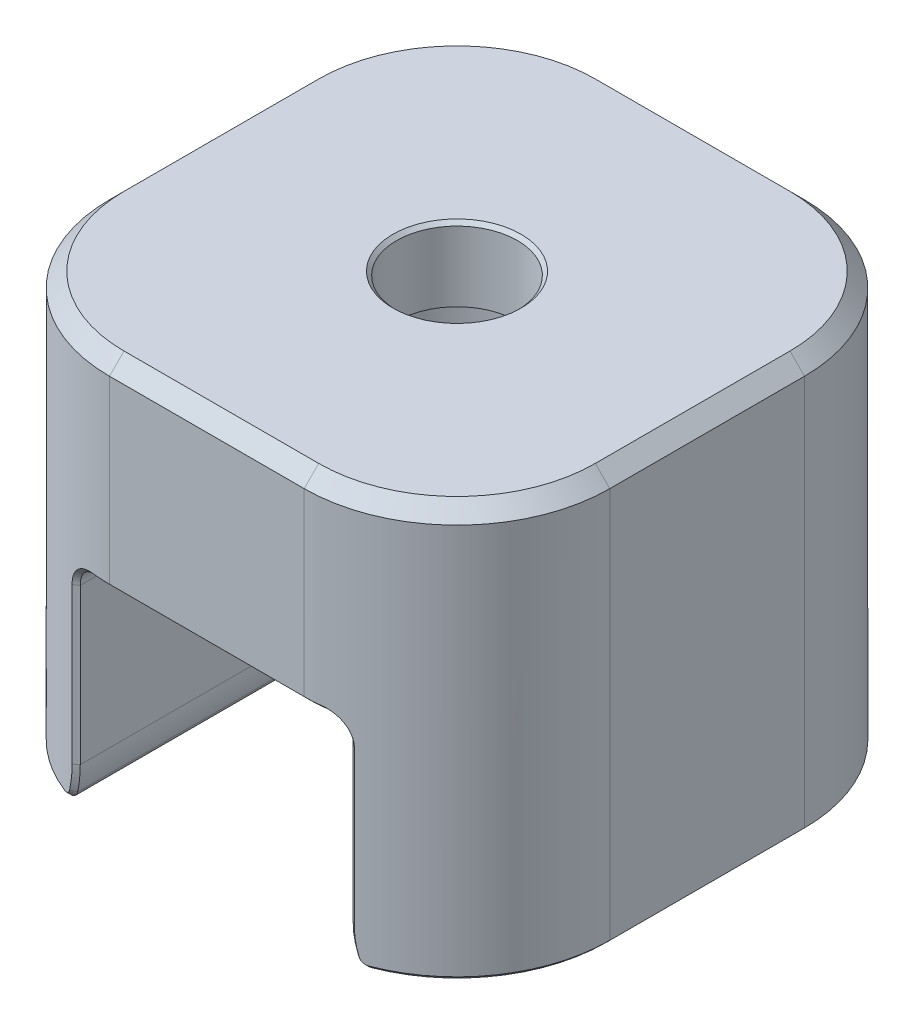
ISO-10303-21;
HEADER;
FILE_DESCRIPTION(('STEP AP214'),'2;1');
FILE_NAME('part.step','',(''),(''),'','','');
FILE_SCHEMA(('AUTOMOTIVE_DESIGN { 1 0 10303 214 1 1 1 1 }'));
ENDSEC;
DATA;
#1=APPLICATION_CONTEXT('core data for automotive mechanical design processes');
#2=APPLICATION_PROTOCOL_DEFINITION('international standard','automotive_design',2000,#1);
#3=PRODUCT_CONTEXT('',#1,'mechanical');
#4=PRODUCT('Part','Part','',(#3));
#5=PRODUCT_RELATED_PRODUCT_CATEGORY('part','',(#4));
#6=PRODUCT_DEFINITION_FORMATION('','',#4);
#7=PRODUCT_DEFINITION_CONTEXT('part definition',#1,'design');
#8=PRODUCT_DEFINITION('design','',#6,#7);
#9=PRODUCT_DEFINITION_SHAPE('','',#8);
#10=(LENGTH_UNIT() NAMED_UNIT(*) SI_UNIT(.MILLI.,.METRE.));
#11=(NAMED_UNIT(*) PLANE_ANGLE_UNIT() SI_UNIT($,.RADIAN.));
#12=(NAMED_UNIT(*) SI_UNIT($,.STERADIAN.) SOLID_ANGLE_UNIT());
#13=UNCERTAINTY_MEASURE_WITH_UNIT(LENGTH_MEASURE(1.E-05),#10,'distance_accuracy_value','');
#14=(GEOMETRIC_REPRESENTATION_CONTEXT(3) GLOBAL_UNCERTAINTY_ASSIGNED_CONTEXT((#13)) GLOBAL_UNIT_ASSIGNED_CONTEXT((#10,
#11,#12)) REPRESENTATION_CONTEXT('',''));
#15=CARTESIAN_POINT('',(0.,0.,0.));
#16=DIRECTION('',(0.,0.,1.));
#17=DIRECTION('',(1.,0.,0.));
#18=AXIS2_PLACEMENT_3D('',#15,#16,#17);
#19=CARTESIAN_POINT('',(6.79449999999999,0.,-6.7945));
#20=DIRECTION('',(0.,-1.,0.));
#21=DIRECTION('',(0.,0.,-1.));
#22=AXIS2_PLACEMENT_3D('',#19,#20,#21);
#23=PLANE('',#22);
#24=DIRECTION('',(0.,0.,1.));
#25=VECTOR('',#24,1.);
#26=CARTESIAN_POINT('',(10.5210198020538,0.,-17.4625));
#27=LINE('',#26,#25);
#28=CARTESIAN_POINT('',(10.5210198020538,0.,16.5189252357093));
#29=VERTEX_POINT('',#28);
#30=CARTESIAN_POINT('',(10.5210198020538,0.,-16.5189252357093));
#31=VERTEX_POINT('',#30);
#32=EDGE_CURVE('E292',#29,#31,#27,.F.);
#33=ORIENTED_EDGE('',*,*,#32,.T.);
#34=CARTESIAN_POINT('',(6.79449999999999,0.,-6.7945));
#35=DIRECTION('',(0.,-1.,0.));
#36=DIRECTION('',(0.,0.,-1.));
#37=AXIS2_PLACEMENT_3D('',#34,#35,#36);
#38=CIRCLE('',#37,10.414);
#39=CARTESIAN_POINT('',(17.2085,0.,-6.7945));
#40=VERTEX_POINT('',#39);
#41=EDGE_CURVE('E2101',#31,#40,#38,.T.);
#42=ORIENTED_EDGE('',*,*,#41,.T.);
#43=DIRECTION('',(0.,0.,1.));
#44=VECTOR('',#43,1.);
#45=CARTESIAN_POINT('',(17.2085,0.,6.7945));
#46=LINE('',#45,#44);
#47=CARTESIAN_POINT('',(17.2085,0.,6.7945));
#48=VERTEX_POINT('',#47);
#49=EDGE_CURVE('E2103',#40,#48,#46,.T.);
#50=ORIENTED_EDGE('',*,*,#49,.T.);
#51=CARTESIAN_POINT('',(6.79449999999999,0.,6.7945));
#52=DIRECTION('',(0.,-1.,0.));
#53=DIRECTION('',(0.,0.,-1.));
#54=AXIS2_PLACEMENT_3D('',#51,#52,#53);
#55=CIRCLE('',#54,10.414);
#56=EDGE_CURVE('E339',#48,#29,#55,.T.);
#57=ORIENTED_EDGE('',*,*,#56,.T.);
#58=EDGE_LOOP('',(#33,#42,#50,#57));
#59=FACE_BOUND('',#58,.T.);
#60=ADVANCED_FACE('F38',(#59),#23,.T.);
#61=CARTESIAN_POINT('',(6.79449999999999,28.575,-6.7945));
#62=DIRECTION('',(0.,-1.,0.));
#63=DIRECTION('',(0.,0.,-1.));
#64=AXIS2_PLACEMENT_3D('',#61,#62,#63);
#65=CYLINDRICAL_SURFACE('',#64,10.668);
#66=DIRECTION('',(0.,-1.,0.));
#67=VECTOR('',#66,1.);
#68=CARTESIAN_POINT('',(17.4625,28.575,-6.7945));
#69=LINE('',#68,#67);
#70=CARTESIAN_POINT('',(17.4625,27.559,-6.7945));
#71=VERTEX_POINT('',#70);
#72=CARTESIAN_POINT('',(17.4625,0.254000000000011,-6.7945));
#73=VERTEX_POINT('',#72);
#74=EDGE_CURVE('E377',#71,#73,#69,.T.);
#75=ORIENTED_EDGE('',*,*,#74,.T.);
#76=CARTESIAN_POINT('',(6.79449999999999,0.254000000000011,-6.7945));
#77=DIRECTION('',(0.,-1.,0.));
#78=DIRECTION('',(0.,0.,-1.));
#79=AXIS2_PLACEMENT_3D('',#76,#77,#78);
#80=CIRCLE('',#79,10.668);
#81=CARTESIAN_POINT('',(10.6119105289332,0.254000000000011,-16.7561063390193));
#82=VERTEX_POINT('',#81);
#83=EDGE_CURVE('E1994',#73,#82,#80,.F.);
#84=ORIENTED_EDGE('',*,*,#83,.T.);
#85=CARTESIAN_POINT('',(10.1133137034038,0.616527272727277,-16.9331241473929));
#86=CARTESIAN_POINT('',(10.1174639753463,0.602972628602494,-16.9317655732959));
#87=CARTESIAN_POINT('',(10.1221675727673,0.58966916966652,-16.9302231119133));
#88=CARTESIAN_POINT('',(10.1326540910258,0.56355292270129,-16.9267742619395));
#89=CARTESIAN_POINT('',(10.1384420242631,0.550732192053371,-16.9248662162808));
#90=CARTESIAN_POINT('',(10.1510703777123,0.525610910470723,-16.920689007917));
#91=CARTESIAN_POINT('',(10.1579622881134,0.513231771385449,-16.9184026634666));
#92=CARTESIAN_POINT('',(10.1725981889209,0.489342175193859,-16.9135284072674));
#93=CARTESIAN_POINT('',(10.1803599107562,0.477782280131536,-16.9109347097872));
#94=CARTESIAN_POINT('',(10.1967321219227,0.45542164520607,-16.9054403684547));
#95=CARTESIAN_POINT('',(10.2053434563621,0.444618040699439,-16.9025394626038));
#96=CARTESIAN_POINT('',(10.2233998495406,0.423751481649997,-16.8964285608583));
#97=CARTESIAN_POINT('',(10.2328457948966,0.413687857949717,-16.8932182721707));
#98=CARTESIAN_POINT('',(10.2525675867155,0.394305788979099,-16.8864820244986));
#99=CARTESIAN_POINT('',(10.262859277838,0.384974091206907,-16.8829506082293));
#100=CARTESIAN_POINT('',(10.2842340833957,0.367116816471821,-16.8755767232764));
#101=CARTESIAN_POINT('',(10.2951710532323,0.358709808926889,-16.8717846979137));
#102=CARTESIAN_POINT('',(10.3175715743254,0.342849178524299,-16.8639752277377));
#103=CARTESIAN_POINT('',(10.3290262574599,0.335403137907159,-16.859960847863));
#104=CARTESIAN_POINT('',(10.3524289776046,0.321454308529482,-16.8517123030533));
#105=CARTESIAN_POINT('',(10.3643770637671,0.314951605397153,-16.8474781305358));
#106=CARTESIAN_POINT('',(10.3887607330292,0.302882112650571,-16.8387860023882));
#107=CARTESIAN_POINT('',(10.4012014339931,0.297314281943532,-16.8343261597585));
#108=CARTESIAN_POINT('',(10.4265530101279,0.2871282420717,-16.8251828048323));
#109=CARTESIAN_POINT('',(10.4395301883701,0.282494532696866,-16.820474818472));
#110=CARTESIAN_POINT('',(10.4655002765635,0.274339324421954,-16.810994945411));
#111=CARTESIAN_POINT('',(10.4785765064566,0.270780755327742,-16.8061931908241));
#112=CARTESIAN_POINT('',(10.5048577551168,0.264690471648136,-16.7964830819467));
#113=CARTESIAN_POINT('',(10.5180707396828,0.262155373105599,-16.7915718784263));
#114=CARTESIAN_POINT('',(10.5579223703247,0.256059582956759,-16.7766681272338));
#115=CARTESIAN_POINT('',(10.5847727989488,0.254002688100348,-16.7665058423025));
#116=CARTESIAN_POINT('',(10.6119105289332,0.254000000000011,-16.7561063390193));
#117=B_SPLINE_CURVE_WITH_KNOTS('',3,(#85,#86,#87,#88,#89,#90,#91,#92,#93,#94,#95,#96,#97,#98,
#99,#100,#101,#102,#103,#104,#105,#106,#107,#108,#109,#110,#111,#112,#113,#114,#115,#116),
.UNSPECIFIED.,.F.,.F.,(4,2,2,2,2,2,2,2,2,2,2,2,2,2,2,4),(0.,4.19707702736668E-05,
8.39415405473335E-05,0.000125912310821,0.000167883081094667,0.000209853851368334,
0.000251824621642,0.000293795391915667,0.000335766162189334,0.000377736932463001,
0.000419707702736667,0.000461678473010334,0.000503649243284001,0.000545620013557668,
0.000587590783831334,0.000671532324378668),.UNSPECIFIED.);
#118=CARTESIAN_POINT('',(10.1133137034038,0.616527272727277,-16.9331241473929));
#119=VERTEX_POINT('',#118);
#120=EDGE_CURVE('E2057',#82,#119,#117,.F.);
#121=ORIENTED_EDGE('',*,*,#120,.T.);
#122=CARTESIAN_POINT('',(9.85179268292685,2.3622,-17.0150276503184));
#123=CARTESIAN_POINT('',(9.85179438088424,2.21331114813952,-17.0150261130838));
#124=CARTESIAN_POINT('',(9.85737256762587,2.06529268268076,-17.0133633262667));
#125=CARTESIAN_POINT('',(9.87939559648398,1.77095469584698,-17.0067365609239));
#126=CARTESIAN_POINT('',(9.89583964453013,1.62463500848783,-17.0017737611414));
#127=CARTESIAN_POINT('',(9.93947381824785,1.33368330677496,-16.9884140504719));
#128=CARTESIAN_POINT('',(9.96666419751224,1.18905131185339,-16.9800175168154));
#129=CARTESIAN_POINT('',(10.0318395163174,0.901495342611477,-16.9594900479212));
#130=CARTESIAN_POINT('',(10.0698256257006,0.758571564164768,-16.9473584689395));
#131=CARTESIAN_POINT('',(10.1133137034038,0.616527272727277,-16.9331241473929));
#132=B_SPLINE_CURVE_WITH_KNOTS('',3,(#122,#123,#124,#125,#126,#127,#128,#129,#130,#131),
.UNSPECIFIED.,.F.,.F.,(4,2,2,2,4),(0.,0.000441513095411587,0.000883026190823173,
0.00132453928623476,0.00176605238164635),.UNSPECIFIED.);
#133=CARTESIAN_POINT('',(9.85179268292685,2.3622,-17.0150276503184));
#134=VERTEX_POINT('',#133);
#135=EDGE_CURVE('E1959',#119,#134,#132,.F.);
#136=ORIENTED_EDGE('',*,*,#135,.T.);
#137=DIRECTION('',(0.,-1.,0.));
#138=VECTOR('',#137,1.);
#139=CARTESIAN_POINT('',(9.85179268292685,28.575,-17.0150276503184));
#140=LINE('',#139,#138);
#141=CARTESIAN_POINT('',(9.85179268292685,13.208,-17.0150276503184));
#142=VERTEX_POINT('',#141);
#143=EDGE_CURVE('E2067',#134,#142,#140,.F.);
#144=ORIENTED_EDGE('',*,*,#143,.T.);
#145=CARTESIAN_POINT('',(8.0304268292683,14.986,-17.3906648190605));
#146=CARTESIAN_POINT('',(8.09072751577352,14.985998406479,-17.3836313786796));
#147=CARTESIAN_POINT('',(8.15059649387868,14.9830841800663,-17.3761267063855));
#148=CARTESIAN_POINT('',(8.23977023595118,14.9744573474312,-17.3641886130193));
#149=CARTESIAN_POINT('',(8.26938974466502,14.9708715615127,-17.3600957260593));
#150=CARTESIAN_POINT('',(8.32841972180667,14.9622836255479,-17.3516872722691));
#151=CARTESIAN_POINT('',(8.35783044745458,14.957281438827,-17.3473716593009));
#152=CARTESIAN_POINT('',(8.41644165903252,14.9458546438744,-17.3385223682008));
#153=CARTESIAN_POINT('',(8.44565102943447,14.9394278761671,-17.3339872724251));
#154=CARTESIAN_POINT('',(8.50382536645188,14.9251428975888,-17.324708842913));
#155=CARTESIAN_POINT('',(8.53258373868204,14.9173362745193,-17.3199986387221));
#156=CARTESIAN_POINT('',(8.58949985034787,14.9004158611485,-17.310441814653));
#157=CARTESIAN_POINT('',(8.6176507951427,14.8913036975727,-17.3055962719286));
#158=CARTESIAN_POINT('',(8.67335000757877,14.8717959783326,-17.2957830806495));
#159=CARTESIAN_POINT('',(8.70089824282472,14.8614003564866,-17.2908154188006));
#160=CARTESIAN_POINT('',(8.78264965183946,14.8283044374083,-17.2757478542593));
#161=CARTESIAN_POINT('',(8.8359617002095,14.8036992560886,-17.2654829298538));
#162=CARTESIAN_POINT('',(8.94021256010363,14.7493780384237,-17.2446180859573));
#163=CARTESIAN_POINT('',(8.99116892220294,14.7196514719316,-17.2340142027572));
#164=CARTESIAN_POINT('',(9.09057941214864,14.6549431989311,-17.2126009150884));
#165=CARTESIAN_POINT('',(9.13823709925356,14.620484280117,-17.2019646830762));
#166=CARTESIAN_POINT('',(9.22969153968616,14.54742062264,-17.1809463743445));
#167=CARTESIAN_POINT('',(9.27347326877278,14.508824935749,-17.1705671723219));
#168=CARTESIAN_POINT('',(9.35717260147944,14.4274981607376,-17.1502128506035));
#169=CARTESIAN_POINT('',(9.39709189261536,14.3847608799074,-17.1402367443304));
#170=CARTESIAN_POINT('',(9.44451563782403,14.3286867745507,-17.1281217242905));
#171=CARTESIAN_POINT('',(9.45387842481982,14.3173331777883,-17.1257158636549));
#172=CARTESIAN_POINT('',(9.4723479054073,14.2943650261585,-17.1209440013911));
#173=CARTESIAN_POINT('',(9.48146652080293,14.2827329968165,-17.1185748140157));
#174=CARTESIAN_POINT('',(9.50831141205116,14.2475972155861,-17.1115632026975));
#175=CARTESIAN_POINT('',(9.52555335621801,14.2238277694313,-17.1070102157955));
#176=CARTESIAN_POINT('',(9.55876851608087,14.1755775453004,-17.098156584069));
#177=CARTESIAN_POINT('',(9.57473846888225,14.151101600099,-17.0938568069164));
#178=CARTESIAN_POINT('',(9.60541430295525,14.1014516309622,-17.0855270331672));
#179=CARTESIAN_POINT('',(9.6201201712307,14.0762776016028,-17.0814970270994));
#180=CARTESIAN_POINT('',(9.64826939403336,14.0252298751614,-17.0737235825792));
#181=CARTESIAN_POINT('',(9.66171275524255,13.9993561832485,-17.0699801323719));
#182=CARTESIAN_POINT('',(9.68732901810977,13.9469024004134,-17.0627978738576));
#183=CARTESIAN_POINT('',(9.69950194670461,13.9203223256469,-17.0593590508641));
#184=CARTESIAN_POINT('',(9.72255959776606,13.8664437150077,-17.0528056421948));
#185=CARTESIAN_POINT('',(9.7334426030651,13.8391480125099,-17.0496915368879));
#186=CARTESIAN_POINT('',(9.75389925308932,13.7838091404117,-17.0438069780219));
#187=CARTESIAN_POINT('',(9.76347096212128,13.7557463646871,-17.0410369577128));
#188=CARTESIAN_POINT('',(9.78105675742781,13.6995684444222,-17.0359250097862));
#189=CARTESIAN_POINT('',(9.78912051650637,13.6713232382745,-17.0335688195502));
#190=CARTESIAN_POINT('',(9.80377976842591,13.6146048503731,-17.0292700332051));
#191=CARTESIAN_POINT('',(9.81038033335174,13.5861180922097,-17.0273259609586));
#192=CARTESIAN_POINT('',(9.82800987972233,13.5002771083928,-17.0221190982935));
#193=CARTESIAN_POINT('',(9.83687162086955,13.4425429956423,-17.0194810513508));
#194=CARTESIAN_POINT('',(9.8487625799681,13.3260500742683,-17.0159354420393));
#195=CARTESIAN_POINT('',(9.85179095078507,13.2672911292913,-17.0150278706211));
#196=CARTESIAN_POINT('',(9.85179268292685,13.208,-17.0150276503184));
#197=B_SPLINE_CURVE_WITH_KNOTS('',3,(#145,#146,#147,#148,#149,#150,#151,#152,#153,#154,#155,
#156,#157,#158,#159,#160,#161,#162,#163,#164,#165,#166,#167,#168,#169,#170,#171,#172,#173,#174,
#175,#176,#177,#178,#179,#180,#181,#182,#183,#184,#185,#186,#187,#188,#189,#190,#191,#192,#193,
#194,#195,#196),.UNSPECIFIED.,.F.,.F.,(4,2,2,2,2,2,2,2,2,2,2,2,2,2,2,2,2,2,2,2,2,2,2,2,2,4),(0.,
0.000175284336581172,0.000262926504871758,0.000350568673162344,0.00043821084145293,
0.000525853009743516,0.000613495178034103,0.000701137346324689,0.000876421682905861,
0.00105170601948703,0.00122699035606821,0.00140227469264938,0.00157755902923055,
0.00162138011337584,0.00166520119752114,0.00175284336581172,0.00184048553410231,
0.00192812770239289,0.00201576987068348,0.00210341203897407,0.00219105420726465,
0.00227869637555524,0.00236633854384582,0.00245398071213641,0.00262926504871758,
0.00280454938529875),.UNSPECIFIED.);
#198=CARTESIAN_POINT('',(8.0304268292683,14.986,-17.3906648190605));
#199=VERTEX_POINT('',#198);
#200=EDGE_CURVE('E1139',#142,#199,#197,.F.);
#201=ORIENTED_EDGE('',*,*,#200,.T.);
#202=CARTESIAN_POINT('',(6.79449999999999,14.986,-6.7945));
#203=DIRECTION('',(0.,1.,0.));
#204=DIRECTION('',(0.,0.,1.));
#205=AXIS2_PLACEMENT_3D('',#202,#203,#204);
#206=CIRCLE('',#205,10.668);
#207=CARTESIAN_POINT('',(6.79449999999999,14.986,-17.4625));
#208=VERTEX_POINT('',#207);
#209=EDGE_CURVE('E2070',#199,#208,#206,.T.);
#210=ORIENTED_EDGE('',*,*,#209,.T.);
#211=DIRECTION('',(0.,-1.,0.));
#212=VECTOR('',#211,1.);
#213=CARTESIAN_POINT('',(6.79449999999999,28.575,-17.4625));
#214=LINE('',#213,#212);
#215=CARTESIAN_POINT('',(6.79449999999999,27.559,-17.4625));
#216=VERTEX_POINT('',#215);
#217=EDGE_CURVE('E399',#216,#208,#214,.T.);
#218=ORIENTED_EDGE('',*,*,#217,.F.);
#219=CARTESIAN_POINT('',(6.79449999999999,27.559,-6.7945));
#220=DIRECTION('',(0.,-1.,0.));
#221=DIRECTION('',(0.,0.,-1.));
#222=AXIS2_PLACEMENT_3D('',#219,#220,#221);
#223=CIRCLE('',#222,10.668);
#224=EDGE_CURVE('E316',#216,#71,#223,.T.);
#225=ORIENTED_EDGE('',*,*,#224,.T.);
#226=EDGE_LOOP('',(#75,#84,#121,#136,#144,#201,#210,#218,#225));
#227=FACE_BOUND('',#226,.T.);
#228=ADVANCED_FACE('F1068',(#227),#65,.T.);
#229=CARTESIAN_POINT('',(6.79449999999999,28.575,-17.4625));
#230=DIRECTION('',(0.,0.,1.));
#231=DIRECTION('',(1.,0.,0.));
#232=AXIS2_PLACEMENT_3D('',#229,#230,#231);
#233=PLANE('',#232);
#234=ORIENTED_EDGE('',*,*,#217,.T.);
#235=DIRECTION('',(-1.,0.,0.));
#236=VECTOR('',#235,1.);
#237=CARTESIAN_POINT('',(6.79449999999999,14.986,-17.4625));
#238=LINE('',#237,#236);
#239=CARTESIAN_POINT('',(-6.79450000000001,14.986,-17.4625));
#240=VERTEX_POINT('',#239);
#241=EDGE_CURVE('E1184',#208,#240,#238,.T.);
#242=ORIENTED_EDGE('',*,*,#241,.T.);
#243=DIRECTION('',(0.,-1.,0.));
#244=VECTOR('',#243,1.);
#245=CARTESIAN_POINT('',(-6.79450000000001,28.575,-17.4625));
#246=LINE('',#245,#244);
#247=CARTESIAN_POINT('',(-6.79450000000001,27.559,-17.4625));
#248=VERTEX_POINT('',#247);
#249=EDGE_CURVE('E397',#248,#240,#246,.T.);
#250=ORIENTED_EDGE('',*,*,#249,.F.);
#251=DIRECTION('',(1.,0.,0.));
#252=VECTOR('',#251,1.);
#253=CARTESIAN_POINT('',(6.79449999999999,27.559,-17.4625));
#254=LINE('',#253,#252);
#255=EDGE_CURVE('E314',#248,#216,#254,.T.);
#256=ORIENTED_EDGE('',*,*,#255,.T.);
#257=EDGE_LOOP('',(#234,#242,#250,#256));
#258=FACE_BOUND('',#257,.T.);
#259=ADVANCED_FACE('F1075',(#258),#233,.F.);
#260=CARTESIAN_POINT('',(-6.79450000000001,28.575,-6.7945));
#261=DIRECTION('',(0.,-1.,0.));
#262=DIRECTION('',(0.,0.,-1.));
#263=AXIS2_PLACEMENT_3D('',#260,#261,#262);
#264=CYLINDRICAL_SURFACE('',#263,10.668);
#265=ORIENTED_EDGE('',*,*,#249,.T.);
#266=CARTESIAN_POINT('',(-6.79450000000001,14.986,-6.7945));
#267=DIRECTION('',(0.,1.,0.));
#268=DIRECTION('',(0.,0.,1.));
#269=AXIS2_PLACEMENT_3D('',#266,#267,#268);
#270=CIRCLE('',#269,10.668);
#271=CARTESIAN_POINT('',(-8.0304268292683,14.986,-17.3906648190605));
#272=VERTEX_POINT('',#271);
#273=EDGE_CURVE('E1234',#240,#272,#270,.T.);
#274=ORIENTED_EDGE('',*,*,#273,.T.);
#275=CARTESIAN_POINT('',(-9.85179268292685,13.208,-17.0150276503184));
#276=CARTESIAN_POINT('',(-9.85179103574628,13.2673086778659,-17.0150278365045));
#277=CARTESIAN_POINT('',(-9.84876051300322,13.3262805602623,-17.0159361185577));
#278=CARTESIAN_POINT('',(-9.83974949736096,13.4142423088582,-17.0186229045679));
#279=CARTESIAN_POINT('',(-9.8360006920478,13.4434801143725,-17.0197393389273));
#280=CARTESIAN_POINT('',(-9.827010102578,13.5017900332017,-17.0224092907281));
#281=CARTESIAN_POINT('',(-9.8217715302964,13.5308459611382,-17.0239618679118));
#282=CARTESIAN_POINT('',(-9.80977504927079,13.5888555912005,-17.0275044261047));
#283=CARTESIAN_POINT('',(-9.80304161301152,13.6176711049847,-17.029487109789));
#284=CARTESIAN_POINT('',(-9.78820975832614,13.6746121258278,-17.0338352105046));
#285=CARTESIAN_POINT('',(-9.7800975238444,13.7028048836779,-17.0362047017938));
#286=CARTESIAN_POINT('',(-9.75372787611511,13.7864961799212,-17.043867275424));
#287=CARTESIAN_POINT('',(-9.73343148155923,13.8411592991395,-17.0497170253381));
#288=CARTESIAN_POINT('',(-9.69898241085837,13.9214741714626,-17.059506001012));
#289=CARTESIAN_POINT('',(-9.68683053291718,13.9479664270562,-17.062938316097));
#290=CARTESIAN_POINT('',(-9.66118484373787,14.0003921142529,-17.0701274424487));
#291=CARTESIAN_POINT('',(-9.64769108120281,14.0263255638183,-17.0738842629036));
#292=CARTESIAN_POINT('',(-9.61934750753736,14.0776295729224,-17.0817093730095));
#293=CARTESIAN_POINT('',(-9.60450777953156,14.1029836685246,-17.085774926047));
#294=CARTESIAN_POINT('',(-9.57340727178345,14.1531865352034,-17.0942164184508));
#295=CARTESIAN_POINT('',(-9.55724416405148,14.1778739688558,-17.0985656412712));
#296=CARTESIAN_POINT('',(-9.50719958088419,14.2503135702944,-17.1118966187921));
#297=CARTESIAN_POINT('',(-9.47165067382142,14.2966775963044,-17.1211935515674));
#298=CARTESIAN_POINT('',(-9.39632642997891,14.3855885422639,-17.1404283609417));
#299=CARTESIAN_POINT('',(-9.35654547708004,14.4281505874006,-17.1503682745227));
#300=CARTESIAN_POINT('',(-9.29368283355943,14.4891661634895,-17.1656510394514));
#301=CARTESIAN_POINT('',(-9.27219587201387,14.5090326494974,-17.1708076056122));
#302=CARTESIAN_POINT('',(-9.22814194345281,14.5478127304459,-17.1812282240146));
#303=CARTESIAN_POINT('',(-9.20558932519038,14.5667147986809,-17.1864889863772));
#304=CARTESIAN_POINT('',(-9.15932418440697,14.6035962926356,-17.1971147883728));
#305=CARTESIAN_POINT('',(-9.13574244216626,14.6214664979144,-17.202449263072));
#306=CARTESIAN_POINT('',(-9.08794749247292,14.6558930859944,-17.213085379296));
#307=CARTESIAN_POINT('',(-9.06368263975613,14.6724907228,-17.2183989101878));
#308=CARTESIAN_POINT('',(-8.98985121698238,14.7204249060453,-17.2342888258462));
#309=CARTESIAN_POINT('',(-8.93921418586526,14.7499352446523,-17.244822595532));
#310=CARTESIAN_POINT('',(-8.86114968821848,14.7905557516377,-17.2604393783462));
#311=CARTESIAN_POINT('',(-8.8347753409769,14.8034879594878,-17.2656146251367));
#312=CARTESIAN_POINT('',(-8.78131337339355,14.8281282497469,-17.2758900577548));
#313=CARTESIAN_POINT('',(-8.75422578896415,14.8398363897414,-17.2809902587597));
#314=CARTESIAN_POINT('',(-8.69932463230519,14.8620111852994,-17.291101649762));
#315=CARTESIAN_POINT('',(-8.67152460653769,14.8724731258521,-17.2961104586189));
#316=CARTESIAN_POINT('',(-8.61512603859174,14.8921470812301,-17.3060348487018));
#317=CARTESIAN_POINT('',(-8.58673647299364,14.9012859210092,-17.3109135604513));
#318=CARTESIAN_POINT('',(-8.50126357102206,14.9265430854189,-17.3252409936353));
#319=CARTESIAN_POINT('',(-8.44369830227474,14.9405905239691,-17.3344155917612));
#320=CARTESIAN_POINT('',(-8.32751319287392,14.963140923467,-17.3519403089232));
#321=CARTESIAN_POINT('',(-8.26887621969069,14.9716532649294,-17.3602941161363));
#322=CARTESIAN_POINT('',(-8.15049440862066,14.9830823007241,-17.3761383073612));
#323=CARTESIAN_POINT('',(-8.0907494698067,14.9859983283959,-17.3836288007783));
#324=CARTESIAN_POINT('',(-8.0304268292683,14.986,-17.3906648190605));
#325=B_SPLINE_CURVE_WITH_KNOTS('',3,(#275,#276,#277,#278,#279,#280,#281,#282,#283,#284,#285,
#286,#287,#288,#289,#290,#291,#292,#293,#294,#295,#296,#297,#298,#299,#300,#301,#302,#303,#304,
#305,#306,#307,#308,#309,#310,#311,#312,#313,#314,#315,#316,#317,#318,#319,#320,#321,#322,#323,
#324),.UNSPECIFIED.,.F.,.F.,(4,2,2,2,2,2,2,2,2,2,2,2,2,2,2,2,2,2,2,2,2,2,2,2,4),(0.,
0.00017528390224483,0.000262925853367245,0.000350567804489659,0.000438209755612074,
0.000525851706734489,0.000701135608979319,0.000788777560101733,0.000876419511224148,
0.000964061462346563,0.00105170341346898,0.00122698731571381,0.00140227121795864,
0.00148991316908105,0.00157755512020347,0.00166519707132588,0.0017528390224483,
0.00192812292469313,0.00201576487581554,0.00210340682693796,0.00219104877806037,
0.00227869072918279,0.00245397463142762,0.00262925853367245,0.00280454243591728),.UNSPECIFIED.);
#326=CARTESIAN_POINT('',(-9.85179268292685,13.208,-17.0150276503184));
#327=VERTEX_POINT('',#326);
#328=EDGE_CURVE('E1230',#272,#327,#325,.F.);
#329=ORIENTED_EDGE('',*,*,#328,.T.);
#330=DIRECTION('',(0.,-1.,0.));
#331=VECTOR('',#330,1.);
#332=CARTESIAN_POINT('',(-9.85179268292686,28.575,-17.0150276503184));
#333=LINE('',#332,#331);
#334=CARTESIAN_POINT('',(-9.85179268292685,2.3622,-17.0150276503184));
#335=VERTEX_POINT('',#334);
#336=EDGE_CURVE('E1223',#327,#335,#333,.T.);
#337=ORIENTED_EDGE('',*,*,#336,.T.);
#338=CARTESIAN_POINT('',(-10.1133137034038,0.616527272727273,-16.9331241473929));
#339=CARTESIAN_POINT('',(-10.0698256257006,0.758571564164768,-16.9473584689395));
#340=CARTESIAN_POINT('',(-10.0318395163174,0.901495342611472,-16.9594900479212));
#341=CARTESIAN_POINT('',(-9.96666419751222,1.18905131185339,-16.9800175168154));
#342=CARTESIAN_POINT('',(-9.93947381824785,1.33368330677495,-16.9884140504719));
#343=CARTESIAN_POINT('',(-9.89583964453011,1.62463500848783,-17.0017737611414));
#344=CARTESIAN_POINT('',(-9.87939559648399,1.77095469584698,-17.0067365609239));
#345=CARTESIAN_POINT('',(-9.85737256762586,2.06529268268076,-17.0133633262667));
#346=CARTESIAN_POINT('',(-9.85179438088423,2.21331114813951,-17.0150261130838));
#347=CARTESIAN_POINT('',(-9.85179268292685,2.3622,-17.0150276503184));
#348=B_SPLINE_CURVE_WITH_KNOTS('',3,(#338,#339,#340,#341,#342,#343,#344,#345,#346,#347),
.UNSPECIFIED.,.F.,.F.,(4,2,2,2,4),(0.,0.000441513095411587,0.000883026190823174,
0.00132453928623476,0.00176605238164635),.UNSPECIFIED.);
#349=CARTESIAN_POINT('',(-10.1133137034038,0.616527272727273,-16.9331241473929));
#350=VERTEX_POINT('',#349);
#351=EDGE_CURVE('E1231',#335,#350,#348,.F.);
#352=ORIENTED_EDGE('',*,*,#351,.T.);
#353=CARTESIAN_POINT('',(-10.6119105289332,0.254000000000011,-16.7561063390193));
#354=CARTESIAN_POINT('',(-10.5847882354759,0.254002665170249,-16.7664999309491));
#355=CARTESIAN_POINT('',(-10.5578969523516,0.256058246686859,-16.776677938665));
#356=CARTESIAN_POINT('',(-10.5179191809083,0.262181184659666,-16.7916284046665));
#357=CARTESIAN_POINT('',(-10.5046446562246,0.264732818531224,-16.7965622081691));
#358=CARTESIAN_POINT('',(-10.478235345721,0.27086700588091,-16.8063188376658));
#359=CARTESIAN_POINT('',(-10.4650540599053,0.274464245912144,-16.8111586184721));
#360=CARTESIAN_POINT('',(-10.4389711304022,0.282685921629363,-16.820678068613));
#361=CARTESIAN_POINT('',(-10.4261624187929,0.28727654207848,-16.8253240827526));
#362=CARTESIAN_POINT('',(-10.4009407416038,0.297427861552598,-16.8344197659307));
#363=CARTESIAN_POINT('',(-10.3885387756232,0.302984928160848,-16.8388654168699));
#364=CARTESIAN_POINT('',(-10.351966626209,0.321108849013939,-16.8519015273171));
#365=CARTESIAN_POINT('',(-10.3284139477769,0.335126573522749,-16.8601967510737));
#366=CARTESIAN_POINT('',(-10.2831695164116,0.36725434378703,-16.8759672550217));
#367=CARTESIAN_POINT('',(-10.2620549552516,0.384951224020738,-16.8832420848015));
#368=CARTESIAN_POINT('',(-10.2227735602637,0.423617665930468,-16.896657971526));
#369=CARTESIAN_POINT('',(-10.2046087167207,0.444586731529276,-16.9027980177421));
#370=CARTESIAN_POINT('',(-10.1714905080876,0.489975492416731,-16.9139102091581));
#371=CARTESIAN_POINT('',(-10.1569995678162,0.513758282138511,-16.9187280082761));
#372=CARTESIAN_POINT('',(-10.1320566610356,0.563493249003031,-16.926978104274));
#373=CARTESIAN_POINT('',(-10.1216109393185,0.589439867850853,-16.9304079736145));
#374=CARTESIAN_POINT('',(-10.1133137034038,0.616527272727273,-16.9331241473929));
#375=B_SPLINE_CURVE_WITH_KNOTS('',3,(#353,#354,#355,#356,#357,#358,#359,#360,#361,#362,#363,
#364,#365,#366,#367,#368,#369,#370,#371,#372,#373,#374),.UNSPECIFIED.,.F.,.F.,(4,2,2,2,2,2,2,2,
2,2,4),(0.,8.39370669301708E-05,0.000125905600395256,0.000167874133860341,0.000209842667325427,
0.000251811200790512,0.000335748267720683,0.000419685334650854,0.000503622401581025,
0.000587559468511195,0.000671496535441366),.UNSPECIFIED.);
#376=CARTESIAN_POINT('',(-10.6119105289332,0.254000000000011,-16.7561063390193));
#377=VERTEX_POINT('',#376);
#378=EDGE_CURVE('E1193',#350,#377,#375,.F.);
#379=ORIENTED_EDGE('',*,*,#378,.T.);
#380=CARTESIAN_POINT('',(-6.79450000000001,0.254000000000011,-6.7945));
#381=DIRECTION('',(0.,-1.,0.));
#382=DIRECTION('',(0.,0.,-1.));
#383=AXIS2_PLACEMENT_3D('',#380,#381,#382);
#384=CIRCLE('',#383,10.668);
#385=CARTESIAN_POINT('',(-17.4625,0.254000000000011,-6.7945));
#386=VERTEX_POINT('',#385);
#387=EDGE_CURVE('E1190',#377,#386,#384,.F.);
#388=ORIENTED_EDGE('',*,*,#387,.T.);
#389=DIRECTION('',(0.,-1.,0.));
#390=VECTOR('',#389,1.);
#391=CARTESIAN_POINT('',(-17.4625,28.575,-6.7945));
#392=LINE('',#391,#390);
#393=CARTESIAN_POINT('',(-17.4625,27.559,-6.7945));
#394=VERTEX_POINT('',#393);
#395=EDGE_CURVE('E394',#394,#386,#392,.T.);
#396=ORIENTED_EDGE('',*,*,#395,.F.);
#397=CARTESIAN_POINT('',(-6.79450000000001,27.559,-6.7945));
#398=DIRECTION('',(0.,-1.,0.));
#399=DIRECTION('',(0.,0.,-1.));
#400=AXIS2_PLACEMENT_3D('',#397,#398,#399);
#401=CIRCLE('',#400,10.668);
#402=EDGE_CURVE('E312',#394,#248,#401,.T.);
#403=ORIENTED_EDGE('',*,*,#402,.T.);
#404=EDGE_LOOP('',(#265,#274,#329,#337,#352,#379,#388,#396,#403));
#405=FACE_BOUND('',#404,.T.);
#406=ADVANCED_FACE('F1199',(#405),#264,.T.);
#407=CARTESIAN_POINT('',(-17.4625,28.575,6.7945));
#408=DIRECTION('',(1.,0.,0.));
#409=DIRECTION('',(0.,0.,-1.));
#410=AXIS2_PLACEMENT_3D('',#407,#408,#409);
#411=PLANE('',#410);
#412=ORIENTED_EDGE('',*,*,#395,.T.);
#413=DIRECTION('',(0.,0.,1.));
#414=VECTOR('',#413,1.);
#415=CARTESIAN_POINT('',(-17.4625,0.254000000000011,6.7945));
#416=LINE('',#415,#414);
#417=CARTESIAN_POINT('',(-17.4625,0.254000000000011,6.7945));
#418=VERTEX_POINT('',#417);
#419=EDGE_CURVE('E455',#386,#418,#416,.T.);
#420=ORIENTED_EDGE('',*,*,#419,.T.);
#421=DIRECTION('',(0.,-1.,0.));
#422=VECTOR('',#421,1.);
#423=CARTESIAN_POINT('',(-17.4625,28.575,6.7945));
#424=LINE('',#423,#422);
#425=CARTESIAN_POINT('',(-17.4625,27.559,6.7945));
#426=VERTEX_POINT('',#425);
#427=EDGE_CURVE('E391',#426,#418,#424,.T.);
#428=ORIENTED_EDGE('',*,*,#427,.F.);
#429=DIRECTION('',(0.,0.,-1.));
#430=VECTOR('',#429,1.);
#431=CARTESIAN_POINT('',(-17.4625,27.559,6.7945));
#432=LINE('',#431,#430);
#433=EDGE_CURVE('E310',#426,#394,#432,.T.);
#434=ORIENTED_EDGE('',*,*,#433,.T.);
#435=EDGE_LOOP('',(#412,#420,#428,#434));
#436=FACE_BOUND('',#435,.T.);
#437=ADVANCED_FACE('F1209',(#436),#411,.F.);
#438=CARTESIAN_POINT('',(-6.79450000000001,28.575,6.7945));
#439=DIRECTION('',(0.,-1.,0.));
#440=DIRECTION('',(0.,0.,-1.));
#441=AXIS2_PLACEMENT_3D('',#438,#439,#440);
#442=CYLINDRICAL_SURFACE('',#441,10.668);
#443=CARTESIAN_POINT('',(-8.0304268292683,14.986,17.3906648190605));
#444=CARTESIAN_POINT('',(-8.09072751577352,14.985998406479,17.3836313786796));
#445=CARTESIAN_POINT('',(-8.15059649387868,14.9830841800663,17.3761267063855));
#446=CARTESIAN_POINT('',(-8.23977023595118,14.9744573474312,17.3641886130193));
#447=CARTESIAN_POINT('',(-8.26938974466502,14.9708715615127,17.3600957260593));
#448=CARTESIAN_POINT('',(-8.32841972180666,14.9622836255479,17.3516872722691));
#449=CARTESIAN_POINT('',(-8.35783044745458,14.957281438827,17.3473716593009));
#450=CARTESIAN_POINT('',(-8.41644165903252,14.9458546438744,17.3385223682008));
#451=CARTESIAN_POINT('',(-8.44565102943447,14.9394278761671,17.3339872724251));
#452=CARTESIAN_POINT('',(-8.50382536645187,14.9251428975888,17.324708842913));
#453=CARTESIAN_POINT('',(-8.53258373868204,14.9173362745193,17.3199986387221));
#454=CARTESIAN_POINT('',(-8.58949985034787,14.9004158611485,17.310441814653));
#455=CARTESIAN_POINT('',(-8.6176507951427,14.8913036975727,17.3055962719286));
#456=CARTESIAN_POINT('',(-8.67335000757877,14.8717959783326,17.2957830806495));
#457=CARTESIAN_POINT('',(-8.70089824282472,14.8614003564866,17.2908154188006));
#458=CARTESIAN_POINT('',(-8.78264965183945,14.8283044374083,17.2757478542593));
#459=CARTESIAN_POINT('',(-8.83596170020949,14.8036992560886,17.2654829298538));
#460=CARTESIAN_POINT('',(-8.94021256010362,14.7493780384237,17.2446180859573));
#461=CARTESIAN_POINT('',(-8.99116892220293,14.7196514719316,17.2340142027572));
#462=CARTESIAN_POINT('',(-9.09057941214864,14.6549431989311,17.2126009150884));
#463=CARTESIAN_POINT('',(-9.13823709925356,14.620484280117,17.2019646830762));
#464=CARTESIAN_POINT('',(-9.22969153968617,14.54742062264,17.1809463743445));
#465=CARTESIAN_POINT('',(-9.27347326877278,14.508824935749,17.1705671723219));
#466=CARTESIAN_POINT('',(-9.35717260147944,14.4274981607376,17.1502128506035));
#467=CARTESIAN_POINT('',(-9.39709189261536,14.3847608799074,17.1402367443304));
#468=CARTESIAN_POINT('',(-9.44451563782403,14.3286867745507,17.1281217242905));
#469=CARTESIAN_POINT('',(-9.45387842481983,14.3173331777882,17.1257158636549));
#470=CARTESIAN_POINT('',(-9.4723479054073,14.2943650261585,17.1209440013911));
#471=CARTESIAN_POINT('',(-9.48146652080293,14.2827329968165,17.1185748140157));
#472=CARTESIAN_POINT('',(-9.50831141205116,14.2475972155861,17.1115632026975));
#473=CARTESIAN_POINT('',(-9.525553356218,14.2238277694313,17.1070102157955));
#474=CARTESIAN_POINT('',(-9.55876851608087,14.1755775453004,17.098156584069));
#475=CARTESIAN_POINT('',(-9.57473846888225,14.151101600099,17.0938568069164));
#476=CARTESIAN_POINT('',(-9.60541430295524,14.1014516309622,17.0855270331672));
#477=CARTESIAN_POINT('',(-9.62012017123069,14.0762776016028,17.0814970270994));
#478=CARTESIAN_POINT('',(-9.64826939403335,14.0252298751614,17.0737235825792));
#479=CARTESIAN_POINT('',(-9.66171275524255,13.9993561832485,17.0699801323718));
#480=CARTESIAN_POINT('',(-9.68732901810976,13.9469024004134,17.0627978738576));
#481=CARTESIAN_POINT('',(-9.69950194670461,13.9203223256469,17.0593590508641));
#482=CARTESIAN_POINT('',(-9.72255959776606,13.8664437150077,17.0528056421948));
#483=CARTESIAN_POINT('',(-9.7334426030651,13.8391480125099,17.0496915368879));
#484=CARTESIAN_POINT('',(-9.75389925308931,13.7838091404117,17.0438069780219));
#485=CARTESIAN_POINT('',(-9.76347096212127,13.7557463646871,17.0410369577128));
#486=CARTESIAN_POINT('',(-9.7810567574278,13.6995684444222,17.0359250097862));
#487=CARTESIAN_POINT('',(-9.78912051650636,13.6713232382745,17.0335688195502));
#488=CARTESIAN_POINT('',(-9.80377976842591,13.6146048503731,17.0292700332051));
#489=CARTESIAN_POINT('',(-9.81038033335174,13.5861180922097,17.0273259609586));
#490=CARTESIAN_POINT('',(-9.82800987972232,13.5002771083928,17.0221190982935));
#491=CARTESIAN_POINT('',(-9.83687162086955,13.4425429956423,17.0194810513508));
#492=CARTESIAN_POINT('',(-9.8487625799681,13.3260500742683,17.0159354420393));
#493=CARTESIAN_POINT('',(-9.85179095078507,13.2672911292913,17.0150278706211));
#494=CARTESIAN_POINT('',(-9.85179268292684,13.208,17.0150276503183));
#495=B_SPLINE_CURVE_WITH_KNOTS('',3,(#443,#444,#445,#446,#447,#448,#449,#450,#451,#452,#453,
#454,#455,#456,#457,#458,#459,#460,#461,#462,#463,#464,#465,#466,#467,#468,#469,#470,#471,#472,
#473,#474,#475,#476,#477,#478,#479,#480,#481,#482,#483,#484,#485,#486,#487,#488,#489,#490,#491,
#492,#493,#494),.UNSPECIFIED.,.F.,.F.,(4,2,2,2,2,2,2,2,2,2,2,2,2,2,2,2,2,2,2,2,2,2,2,2,2,4),(0.,
0.000175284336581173,0.000262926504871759,0.000350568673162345,0.000438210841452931,
0.000525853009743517,0.000613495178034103,0.000701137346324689,0.000876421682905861,
0.00105170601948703,0.00122699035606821,0.00140227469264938,0.00157755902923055,
0.00162138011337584,0.00166520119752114,0.00175284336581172,0.00184048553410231,
0.00192812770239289,0.00201576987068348,0.00210341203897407,0.00219105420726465,
0.00227869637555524,0.00236633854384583,0.00245398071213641,0.00262926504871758,
0.00280454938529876),.UNSPECIFIED.);
#496=CARTESIAN_POINT('',(-9.85179268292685,13.208,17.0150276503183));
#497=VERTEX_POINT('',#496);
#498=CARTESIAN_POINT('',(-8.0304268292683,14.986,17.3906648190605));
#499=VERTEX_POINT('',#498);
#500=EDGE_CURVE('E1298',#497,#499,#495,.F.);
#501=ORIENTED_EDGE('',*,*,#500,.T.);
#502=CARTESIAN_POINT('',(-6.79450000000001,14.986,6.7945));
#503=DIRECTION('',(0.,1.,0.));
#504=DIRECTION('',(0.,0.,1.));
#505=AXIS2_PLACEMENT_3D('',#502,#503,#504);
#506=CIRCLE('',#505,10.668);
#507=CARTESIAN_POINT('',(-6.79450000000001,14.986,17.4625));
#508=VERTEX_POINT('',#507);
#509=EDGE_CURVE('E1261',#499,#508,#506,.T.);
#510=ORIENTED_EDGE('',*,*,#509,.T.);
#511=DIRECTION('',(0.,-1.,0.));
#512=VECTOR('',#511,1.);
#513=CARTESIAN_POINT('',(-6.79450000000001,28.575,17.4625));
#514=LINE('',#513,#512);
#515=CARTESIAN_POINT('',(-6.79450000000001,27.559,17.4625));
#516=VERTEX_POINT('',#515);
#517=EDGE_CURVE('E383',#516,#508,#514,.T.);
#518=ORIENTED_EDGE('',*,*,#517,.F.);
#519=CARTESIAN_POINT('',(-6.79450000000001,27.559,6.7945));
#520=DIRECTION('',(0.,-1.,0.));
#521=DIRECTION('',(0.,0.,-1.));
#522=AXIS2_PLACEMENT_3D('',#519,#520,#521);
#523=CIRCLE('',#522,10.668);
#524=EDGE_CURVE('E308',#516,#426,#523,.T.);
#525=ORIENTED_EDGE('',*,*,#524,.T.);
#526=ORIENTED_EDGE('',*,*,#427,.T.);
#527=CARTESIAN_POINT('',(-6.79450000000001,0.254000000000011,6.7945));
#528=DIRECTION('',(0.,-1.,0.));
#529=DIRECTION('',(0.,0.,-1.));
#530=AXIS2_PLACEMENT_3D('',#527,#528,#529);
#531=CIRCLE('',#530,10.668);
#532=CARTESIAN_POINT('',(-10.6119105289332,0.254000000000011,16.7561063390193));
#533=VERTEX_POINT('',#532);
#534=EDGE_CURVE('E1342',#418,#533,#531,.F.);
#535=ORIENTED_EDGE('',*,*,#534,.T.);
#536=CARTESIAN_POINT('',(-10.1133137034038,0.616527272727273,16.9331241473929));
#537=CARTESIAN_POINT('',(-10.1174639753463,0.60297262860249,16.9317655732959));
#538=CARTESIAN_POINT('',(-10.1221675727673,0.589669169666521,16.9302231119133));
#539=CARTESIAN_POINT('',(-10.1326540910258,0.563552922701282,16.9267742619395));
#540=CARTESIAN_POINT('',(-10.1384420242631,0.55073219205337,16.9248662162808));
#541=CARTESIAN_POINT('',(-10.1510703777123,0.525610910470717,16.920689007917));
#542=CARTESIAN_POINT('',(-10.1579622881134,0.513231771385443,16.9184026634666));
#543=CARTESIAN_POINT('',(-10.1725981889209,0.489342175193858,16.9135284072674));
#544=CARTESIAN_POINT('',(-10.1803599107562,0.477782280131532,16.9109347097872));
#545=CARTESIAN_POINT('',(-10.1967321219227,0.455421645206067,16.9054403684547));
#546=CARTESIAN_POINT('',(-10.2053434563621,0.444618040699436,16.9025394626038));
#547=CARTESIAN_POINT('',(-10.2233998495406,0.423751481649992,16.8964285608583));
#548=CARTESIAN_POINT('',(-10.2328457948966,0.413687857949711,16.8932182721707));
#549=CARTESIAN_POINT('',(-10.2525675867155,0.394305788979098,16.8864820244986));
#550=CARTESIAN_POINT('',(-10.262859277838,0.384974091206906,16.8829506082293));
#551=CARTESIAN_POINT('',(-10.2842340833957,0.367116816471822,16.8755767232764));
#552=CARTESIAN_POINT('',(-10.2951710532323,0.358709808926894,16.8717846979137));
#553=CARTESIAN_POINT('',(-10.3175715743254,0.342849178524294,16.8639752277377));
#554=CARTESIAN_POINT('',(-10.3290262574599,0.335403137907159,16.859960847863));
#555=CARTESIAN_POINT('',(-10.3524289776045,0.321454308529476,16.8517123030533));
#556=CARTESIAN_POINT('',(-10.3643770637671,0.314951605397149,16.8474781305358));
#557=CARTESIAN_POINT('',(-10.3887607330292,0.302882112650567,16.8387860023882));
#558=CARTESIAN_POINT('',(-10.4012014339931,0.297314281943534,16.8343261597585));
#559=CARTESIAN_POINT('',(-10.4265530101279,0.287128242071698,16.8251828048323));
#560=CARTESIAN_POINT('',(-10.4395301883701,0.282494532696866,16.820474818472));
#561=CARTESIAN_POINT('',(-10.4655002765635,0.274339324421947,16.810994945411));
#562=CARTESIAN_POINT('',(-10.4785765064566,0.270780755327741,16.8061931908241));
#563=CARTESIAN_POINT('',(-10.5048577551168,0.26469047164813,16.7964830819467));
#564=CARTESIAN_POINT('',(-10.5180707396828,0.262155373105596,16.7915718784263));
#565=CARTESIAN_POINT('',(-10.5579223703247,0.256059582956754,16.7766681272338));
#566=CARTESIAN_POINT('',(-10.5847727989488,0.254002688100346,16.7665058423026));
#567=CARTESIAN_POINT('',(-10.6119105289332,0.254000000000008,16.7561063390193));
#568=B_SPLINE_CURVE_WITH_KNOTS('',3,(#536,#537,#538,#539,#540,#541,#542,#543,#544,#545,#546,
#547,#548,#549,#550,#551,#552,#553,#554,#555,#556,#557,#558,#559,#560,#561,#562,#563,#564,#565,
#566,#567),.UNSPECIFIED.,.F.,.F.,(4,2,2,2,2,2,2,2,2,2,2,2,2,2,2,4),(0.,4.19707702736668E-05,
8.39415405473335E-05,0.000125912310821,0.000167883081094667,0.000209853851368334,
0.000251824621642,0.000293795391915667,0.000335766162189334,0.000377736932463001,
0.000419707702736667,0.000461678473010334,0.000503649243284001,0.000545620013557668,
0.000587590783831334,0.000671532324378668),.UNSPECIFIED.);
#569=CARTESIAN_POINT('',(-10.1133137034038,0.616527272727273,16.9331241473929));
#570=VERTEX_POINT('',#569);
#571=EDGE_CURVE('E1312',#533,#570,#568,.F.);
#572=ORIENTED_EDGE('',*,*,#571,.T.);
#573=CARTESIAN_POINT('',(-9.85179268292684,2.3622,17.0150276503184));
#574=CARTESIAN_POINT('',(-9.85179438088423,2.21331114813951,17.0150261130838));
#575=CARTESIAN_POINT('',(-9.85737256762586,2.06529268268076,17.0133633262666));
#576=CARTESIAN_POINT('',(-9.87939559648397,1.77095469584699,17.0067365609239));
#577=CARTESIAN_POINT('',(-9.89583964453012,1.62463500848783,17.0017737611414));
#578=CARTESIAN_POINT('',(-9.93947381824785,1.33368330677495,16.9884140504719));
#579=CARTESIAN_POINT('',(-9.96666419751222,1.18905131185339,16.9800175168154));
#580=CARTESIAN_POINT('',(-10.0318395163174,0.901495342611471,16.9594900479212));
#581=CARTESIAN_POINT('',(-10.0698256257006,0.758571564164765,16.9473584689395));
#582=CARTESIAN_POINT('',(-10.1133137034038,0.616527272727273,16.9331241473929));
#583=B_SPLINE_CURVE_WITH_KNOTS('',3,(#573,#574,#575,#576,#577,#578,#579,#580,#581,#582),
.UNSPECIFIED.,.F.,.F.,(4,2,2,2,4),(0.,0.000441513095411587,0.000883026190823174,
0.00132453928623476,0.00176605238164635),.UNSPECIFIED.);
#584=CARTESIAN_POINT('',(-9.85179268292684,2.3622,17.0150276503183));
#585=VERTEX_POINT('',#584);
#586=EDGE_CURVE('E1310',#570,#585,#583,.F.);
#587=ORIENTED_EDGE('',*,*,#586,.T.);
#588=DIRECTION('',(0.,-1.,0.));
#589=VECTOR('',#588,1.);
#590=CARTESIAN_POINT('',(-9.85179268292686,28.575,17.0150276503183));
#591=LINE('',#590,#589);
#592=EDGE_CURVE('E1308',#585,#497,#591,.F.);
#593=ORIENTED_EDGE('',*,*,#592,.T.);
#594=EDGE_LOOP('',(#501,#510,#518,#525,#526,#535,#572,#587,#593));
#595=FACE_BOUND('',#594,.T.);
#596=ADVANCED_FACE('F1323',(#595),#442,.T.);
#597=CARTESIAN_POINT('',(6.79449999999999,28.575,17.4625));
#598=DIRECTION('',(0.,0.,-1.));
#599=DIRECTION('',(-1.,0.,0.));
#600=AXIS2_PLACEMENT_3D('',#597,#598,#599);
#601=PLANE('',#600);
#602=ORIENTED_EDGE('',*,*,#517,.T.);
#603=DIRECTION('',(1.,0.,0.));
#604=VECTOR('',#603,1.);
#605=CARTESIAN_POINT('',(6.7945,14.986,17.4625));
#606=LINE('',#605,#604);
#607=CARTESIAN_POINT('',(6.79449999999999,14.986,17.4625));
#608=VERTEX_POINT('',#607);
#609=EDGE_CURVE('E1188',#508,#608,#606,.T.);
#610=ORIENTED_EDGE('',*,*,#609,.T.);
#611=DIRECTION('',(0.,-1.,0.));
#612=VECTOR('',#611,1.);
#613=CARTESIAN_POINT('',(6.79449999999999,28.575,17.4625));
#614=LINE('',#613,#612);
#615=CARTESIAN_POINT('',(6.79449999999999,27.559,17.4625));
#616=VERTEX_POINT('',#615);
#617=EDGE_CURVE('E381',#616,#608,#614,.T.);
#618=ORIENTED_EDGE('',*,*,#617,.F.);
#619=DIRECTION('',(-1.,0.,0.));
#620=VECTOR('',#619,1.);
#621=CARTESIAN_POINT('',(6.79449999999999,27.559,17.4625));
#622=LINE('',#621,#620);
#623=EDGE_CURVE('E306',#616,#516,#622,.T.);
#624=ORIENTED_EDGE('',*,*,#623,.T.);
#625=EDGE_LOOP('',(#602,#610,#618,#624));
#626=FACE_BOUND('',#625,.T.);
#627=ADVANCED_FACE('F1332',(#626),#601,.F.);
#628=CARTESIAN_POINT('',(6.79449999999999,28.575,6.7945));
#629=DIRECTION('',(0.,-1.,0.));
#630=DIRECTION('',(0.,0.,-1.));
#631=AXIS2_PLACEMENT_3D('',#628,#629,#630);
#632=CYLINDRICAL_SURFACE('',#631,10.668);
#633=CARTESIAN_POINT('',(10.6119105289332,0.254000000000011,16.7561063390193));
#634=CARTESIAN_POINT('',(10.5847882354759,0.254002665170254,16.7664999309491));
#635=CARTESIAN_POINT('',(10.5578969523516,0.256058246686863,16.776677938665));
#636=CARTESIAN_POINT('',(10.5179191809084,0.262181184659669,16.7916284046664));
#637=CARTESIAN_POINT('',(10.5046446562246,0.264732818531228,16.796562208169));
#638=CARTESIAN_POINT('',(10.478235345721,0.270867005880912,16.8063188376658));
#639=CARTESIAN_POINT('',(10.4650540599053,0.274464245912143,16.8111586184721));
#640=CARTESIAN_POINT('',(10.4389711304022,0.282685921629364,16.820678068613));
#641=CARTESIAN_POINT('',(10.4261624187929,0.287276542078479,16.8253240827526));
#642=CARTESIAN_POINT('',(10.4009407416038,0.2974278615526,16.8344197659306));
#643=CARTESIAN_POINT('',(10.3885387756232,0.302984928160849,16.8388654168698));
#644=CARTESIAN_POINT('',(10.351966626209,0.321108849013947,16.8519015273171));
#645=CARTESIAN_POINT('',(10.3284139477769,0.33512657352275,16.8601967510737));
#646=CARTESIAN_POINT('',(10.2831695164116,0.367254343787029,16.8759672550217));
#647=CARTESIAN_POINT('',(10.2620549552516,0.38495122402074,16.8832420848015));
#648=CARTESIAN_POINT('',(10.2227735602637,0.423617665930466,16.896657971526));
#649=CARTESIAN_POINT('',(10.2046087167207,0.444586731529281,16.9027980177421));
#650=CARTESIAN_POINT('',(10.1714905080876,0.489975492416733,16.9139102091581));
#651=CARTESIAN_POINT('',(10.1569995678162,0.513758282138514,16.9187280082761));
#652=CARTESIAN_POINT('',(10.1320566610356,0.563493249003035,16.926978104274));
#653=CARTESIAN_POINT('',(10.1216109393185,0.589439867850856,16.9304079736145));
#654=CARTESIAN_POINT('',(10.1133137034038,0.616527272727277,16.9331241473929));
#655=B_SPLINE_CURVE_WITH_KNOTS('',3,(#633,#634,#635,#636,#637,#638,#639,#640,#641,#642,#643,
#644,#645,#646,#647,#648,#649,#650,#651,#652,#653,#654),.UNSPECIFIED.,.F.,.F.,(4,2,2,2,2,2,2,2,
2,2,4),(0.,8.3937066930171E-05,0.000125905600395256,0.000167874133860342,0.000209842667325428,
0.000251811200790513,0.000335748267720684,0.000419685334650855,0.000503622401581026,
0.000587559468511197,0.000671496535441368),.UNSPECIFIED.);
#656=CARTESIAN_POINT('',(10.1133137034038,0.616527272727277,16.9331241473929));
#657=VERTEX_POINT('',#656);
#658=CARTESIAN_POINT('',(10.6119105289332,0.254000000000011,16.7561063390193));
#659=VERTEX_POINT('',#658);
#660=EDGE_CURVE('E1965',#657,#659,#655,.F.);
#661=ORIENTED_EDGE('',*,*,#660,.T.);
#662=CARTESIAN_POINT('',(6.79449999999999,0.254000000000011,6.7945));
#663=DIRECTION('',(0.,-1.,0.));
#664=DIRECTION('',(0.,0.,-1.));
#665=AXIS2_PLACEMENT_3D('',#662,#663,#664);
#666=CIRCLE('',#665,10.668);
#667=CARTESIAN_POINT('',(17.4625,0.254000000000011,6.7945));
#668=VERTEX_POINT('',#667);
#669=EDGE_CURVE('E380',#659,#668,#666,.F.);
#670=ORIENTED_EDGE('',*,*,#669,.T.);
#671=DIRECTION('',(0.,-1.,0.));
#672=VECTOR('',#671,1.);
#673=CARTESIAN_POINT('',(17.4625,28.575,6.7945));
#674=LINE('',#673,#672);
#675=CARTESIAN_POINT('',(17.4625,27.559,6.7945));
#676=VERTEX_POINT('',#675);
#677=EDGE_CURVE('E374',#676,#668,#674,.T.);
#678=ORIENTED_EDGE('',*,*,#677,.F.);
#679=CARTESIAN_POINT('',(6.79449999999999,27.559,6.7945));
#680=DIRECTION('',(0.,-1.,0.));
#681=DIRECTION('',(0.,0.,-1.));
#682=AXIS2_PLACEMENT_3D('',#679,#680,#681);
#683=CIRCLE('',#682,10.668);
#684=EDGE_CURVE('E299',#676,#616,#683,.T.);
#685=ORIENTED_EDGE('',*,*,#684,.T.);
#686=ORIENTED_EDGE('',*,*,#617,.T.);
#687=CARTESIAN_POINT('',(6.79449999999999,14.986,6.7945));
#688=DIRECTION('',(0.,1.,0.));
#689=DIRECTION('',(0.,0.,1.));
#690=AXIS2_PLACEMENT_3D('',#687,#688,#689);
#691=CIRCLE('',#690,10.668);
#692=CARTESIAN_POINT('',(8.0304268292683,14.986,17.3906648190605));
#693=VERTEX_POINT('',#692);
#694=EDGE_CURVE('E1986',#608,#693,#691,.T.);
#695=ORIENTED_EDGE('',*,*,#694,.T.);
#696=CARTESIAN_POINT('',(9.85179268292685,13.208,17.0150276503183));
#697=CARTESIAN_POINT('',(9.85179103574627,13.2673086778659,17.0150278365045));
#698=CARTESIAN_POINT('',(9.84876051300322,13.3262805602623,17.0159361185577));
#699=CARTESIAN_POINT('',(9.83974949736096,13.4142423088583,17.0186229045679));
#700=CARTESIAN_POINT('',(9.8360006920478,13.4434801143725,17.0197393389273));
#701=CARTESIAN_POINT('',(9.827010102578,13.5017900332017,17.0224092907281));
#702=CARTESIAN_POINT('',(9.8217715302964,13.5308459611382,17.0239618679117));
#703=CARTESIAN_POINT('',(9.80977504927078,13.5888555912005,17.0275044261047));
#704=CARTESIAN_POINT('',(9.80304161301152,13.6176711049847,17.029487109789));
#705=CARTESIAN_POINT('',(9.78820975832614,13.6746121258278,17.0338352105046));
#706=CARTESIAN_POINT('',(9.7800975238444,13.7028048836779,17.0362047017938));
#707=CARTESIAN_POINT('',(9.7537278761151,13.7864961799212,17.043867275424));
#708=CARTESIAN_POINT('',(9.73343148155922,13.8411592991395,17.049717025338));
#709=CARTESIAN_POINT('',(9.69898241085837,13.9214741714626,17.059506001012));
#710=CARTESIAN_POINT('',(9.68683053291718,13.9479664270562,17.062938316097));
#711=CARTESIAN_POINT('',(9.66118484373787,14.0003921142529,17.0701274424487));
#712=CARTESIAN_POINT('',(9.64769108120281,14.0263255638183,17.0738842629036));
#713=CARTESIAN_POINT('',(9.61934750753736,14.0776295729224,17.0817093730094));
#714=CARTESIAN_POINT('',(9.60450777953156,14.1029836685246,17.085774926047));
#715=CARTESIAN_POINT('',(9.57340727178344,14.1531865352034,17.0942164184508));
#716=CARTESIAN_POINT('',(9.55724416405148,14.1778739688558,17.0985656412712));
#717=CARTESIAN_POINT('',(9.50719958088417,14.2503135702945,17.1118966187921));
#718=CARTESIAN_POINT('',(9.47165067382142,14.2966775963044,17.1211935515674));
#719=CARTESIAN_POINT('',(9.39632642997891,14.3855885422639,17.1404283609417));
#720=CARTESIAN_POINT('',(9.35654547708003,14.4281505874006,17.1503682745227));
#721=CARTESIAN_POINT('',(9.29368283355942,14.4891661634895,17.1656510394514));
#722=CARTESIAN_POINT('',(9.27219587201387,14.5090326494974,17.1708076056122));
#723=CARTESIAN_POINT('',(9.22814194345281,14.5478127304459,17.1812282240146));
#724=CARTESIAN_POINT('',(9.20558932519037,14.5667147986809,17.1864889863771));
#725=CARTESIAN_POINT('',(9.15932418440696,14.6035962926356,17.1971147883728));
#726=CARTESIAN_POINT('',(9.13574244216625,14.6214664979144,17.202449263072));
#727=CARTESIAN_POINT('',(9.08794749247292,14.6558930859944,17.213085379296));
#728=CARTESIAN_POINT('',(9.06368263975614,14.6724907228,17.2183989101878));
#729=CARTESIAN_POINT('',(8.98985121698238,14.7204249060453,17.2342888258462));
#730=CARTESIAN_POINT('',(8.93921418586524,14.7499352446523,17.244822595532));
#731=CARTESIAN_POINT('',(8.86114968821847,14.7905557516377,17.2604393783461));
#732=CARTESIAN_POINT('',(8.8347753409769,14.8034879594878,17.2656146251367));
#733=CARTESIAN_POINT('',(8.78131337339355,14.8281282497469,17.2758900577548));
#734=CARTESIAN_POINT('',(8.75422578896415,14.8398363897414,17.2809902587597));
#735=CARTESIAN_POINT('',(8.69932463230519,14.8620111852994,17.291101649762));
#736=CARTESIAN_POINT('',(8.67152460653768,14.8724731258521,17.2961104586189));
#737=CARTESIAN_POINT('',(8.61512603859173,14.8921470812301,17.3060348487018));
#738=CARTESIAN_POINT('',(8.58673647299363,14.9012859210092,17.3109135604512));
#739=CARTESIAN_POINT('',(8.50126357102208,14.9265430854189,17.3252409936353));
#740=CARTESIAN_POINT('',(8.44369830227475,14.9405905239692,17.3344155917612));
#741=CARTESIAN_POINT('',(8.32751319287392,14.963140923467,17.3519403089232));
#742=CARTESIAN_POINT('',(8.2688762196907,14.9716532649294,17.3602941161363));
#743=CARTESIAN_POINT('',(8.15049440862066,14.9830823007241,17.3761383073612));
#744=CARTESIAN_POINT('',(8.09074946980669,14.9859983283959,17.3836288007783));
#745=CARTESIAN_POINT('',(8.0304268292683,14.986,17.3906648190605));
#746=B_SPLINE_CURVE_WITH_KNOTS('',3,(#696,#697,#698,#699,#700,#701,#702,#703,#704,#705,#706,
#707,#708,#709,#710,#711,#712,#713,#714,#715,#716,#717,#718,#719,#720,#721,#722,#723,#724,#725,
#726,#727,#728,#729,#730,#731,#732,#733,#734,#735,#736,#737,#738,#739,#740,#741,#742,#743,#744,
#745),.UNSPECIFIED.,.F.,.F.,(4,2,2,2,2,2,2,2,2,2,2,2,2,2,2,2,2,2,2,2,2,2,2,2,4),(0.,
0.00017528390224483,0.000262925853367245,0.00035056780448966,0.000438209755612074,
0.000525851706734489,0.000701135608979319,0.000788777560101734,0.000876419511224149,
0.000964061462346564,0.00105170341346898,0.00122698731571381,0.00140227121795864,
0.00148991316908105,0.00157755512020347,0.00166519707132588,0.0017528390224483,
0.00192812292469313,0.00201576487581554,0.00210340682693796,0.00219104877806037,
0.00227869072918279,0.00245397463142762,0.00262925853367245,0.00280454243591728),.UNSPECIFIED.);
#747=CARTESIAN_POINT('',(9.85179268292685,13.208,17.0150276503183));
#748=VERTEX_POINT('',#747);
#749=EDGE_CURVE('E1993',#693,#748,#746,.F.);
#750=ORIENTED_EDGE('',*,*,#749,.T.);
#751=DIRECTION('',(0.,-1.,0.));
#752=VECTOR('',#751,1.);
#753=CARTESIAN_POINT('',(9.85179268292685,28.575,17.0150276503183));
#754=LINE('',#753,#752);
#755=CARTESIAN_POINT('',(9.85179268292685,2.3622,17.0150276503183));
#756=VERTEX_POINT('',#755);
#757=EDGE_CURVE('E1997',#748,#756,#754,.T.);
#758=ORIENTED_EDGE('',*,*,#757,.T.);
#759=CARTESIAN_POINT('',(10.1133137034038,0.616527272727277,16.9331241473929));
#760=CARTESIAN_POINT('',(10.0698256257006,0.758571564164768,16.9473584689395));
#761=CARTESIAN_POINT('',(10.0318395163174,0.901495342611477,16.9594900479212));
#762=CARTESIAN_POINT('',(9.96666419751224,1.18905131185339,16.9800175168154));
#763=CARTESIAN_POINT('',(9.93947381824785,1.33368330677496,16.9884140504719));
#764=CARTESIAN_POINT('',(9.89583964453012,1.62463500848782,17.0017737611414));
#765=CARTESIAN_POINT('',(9.87939559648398,1.77095469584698,17.0067365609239));
#766=CARTESIAN_POINT('',(9.85737256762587,2.06529268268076,17.0133633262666));
#767=CARTESIAN_POINT('',(9.85179438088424,2.21331114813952,17.0150261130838));
#768=CARTESIAN_POINT('',(9.85179268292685,2.3622,17.0150276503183));
#769=B_SPLINE_CURVE_WITH_KNOTS('',3,(#759,#760,#761,#762,#763,#764,#765,#766,#767,#768),
.UNSPECIFIED.,.F.,.F.,(4,2,2,2,4),(0.,0.000441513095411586,0.000883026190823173,
0.00132453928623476,0.00176605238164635),.UNSPECIFIED.);
#770=EDGE_CURVE('E1966',#756,#657,#769,.F.);
#771=ORIENTED_EDGE('',*,*,#770,.T.);
#772=EDGE_LOOP('',(#661,#670,#678,#685,#686,#695,#750,#758,#771));
#773=FACE_BOUND('',#772,.T.);
#774=ADVANCED_FACE('F378',(#773),#632,.T.);
#775=CARTESIAN_POINT('',(17.4625,28.575,6.7945));
#776=DIRECTION('',(-1.,0.,0.));
#777=DIRECTION('',(0.,0.,1.));
#778=AXIS2_PLACEMENT_3D('',#775,#776,#777);
#779=PLANE('',#778);
#780=ORIENTED_EDGE('',*,*,#677,.T.);
#781=DIRECTION('',(0.,0.,-1.));
#782=VECTOR('',#781,1.);
#783=CARTESIAN_POINT('',(17.4625,0.254000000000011,-6.7945));
#784=LINE('',#783,#782);
#785=EDGE_CURVE('E317',#668,#73,#784,.T.);
#786=ORIENTED_EDGE('',*,*,#785,.T.);
#787=ORIENTED_EDGE('',*,*,#74,.F.);
#788=DIRECTION('',(0.,0.,1.));
#789=VECTOR('',#788,1.);
#790=CARTESIAN_POINT('',(17.4625,27.559,6.7945));
#791=LINE('',#790,#789);
#792=EDGE_CURVE('E278',#71,#676,#791,.T.);
#793=ORIENTED_EDGE('',*,*,#792,.T.);
#794=EDGE_LOOP('',(#780,#786,#787,#793));
#795=FACE_BOUND('',#794,.T.);
#796=ADVANCED_FACE('F373',(#795),#779,.F.);
#797=CARTESIAN_POINT('',(6.79449999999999,28.575,-6.7945));
#798=DIRECTION('',(0.,-1.,0.));
#799=DIRECTION('',(0.,0.,-1.));
#800=AXIS2_PLACEMENT_3D('',#797,#798,#799);
#801=PLANE('',#800);
#802=CARTESIAN_POINT('',(0.,28.575,0.));
#803=DIRECTION('',(0.,-1.,0.));
#804=DIRECTION('',(0.,0.,-1.));
#805=AXIS2_PLACEMENT_3D('',#802,#803,#804);
#806=CIRCLE('',#805,4.4704);
#807=CARTESIAN_POINT('',(0.,28.575,-4.4704));
#808=VERTEX_POINT('',#807);
#809=EDGE_CURVE('E47',#808,#808,#806,.T.);
#810=ORIENTED_EDGE('',*,*,#809,.T.);
#811=EDGE_LOOP('',(#810));
#812=FACE_BOUND('',#811,.T.);
#813=CARTESIAN_POINT('',(6.79449999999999,28.575,6.7945));
#814=DIRECTION('',(0.,-1.,0.));
#815=DIRECTION('',(0.,0.,-1.));
#816=AXIS2_PLACEMENT_3D('',#813,#814,#815);
#817=CIRCLE('',#816,9.652);
#818=CARTESIAN_POINT('',(6.79449999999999,28.575,16.4465));
#819=VERTEX_POINT('',#818);
#820=CARTESIAN_POINT('',(16.4465,28.575,6.7945));
#821=VERTEX_POINT('',#820);
#822=EDGE_CURVE('E296',#819,#821,#817,.F.);
#823=ORIENTED_EDGE('',*,*,#822,.T.);
#824=DIRECTION('',(0.,0.,-1.));
#825=VECTOR('',#824,1.);
#826=CARTESIAN_POINT('',(16.4465,28.575,-6.7945));
#827=LINE('',#826,#825);
#828=CARTESIAN_POINT('',(16.4465,28.575,-6.7945));
#829=VERTEX_POINT('',#828);
#830=EDGE_CURVE('E276',#821,#829,#827,.T.);
#831=ORIENTED_EDGE('',*,*,#830,.T.);
#832=CARTESIAN_POINT('',(6.79449999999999,28.575,-6.7945));
#833=DIRECTION('',(0.,-1.,0.));
#834=DIRECTION('',(0.,0.,-1.));
#835=AXIS2_PLACEMENT_3D('',#832,#833,#834);
#836=CIRCLE('',#835,9.652);
#837=CARTESIAN_POINT('',(6.79449999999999,28.575,-16.4465));
#838=VERTEX_POINT('',#837);
#839=EDGE_CURVE('E285',#829,#838,#836,.F.);
#840=ORIENTED_EDGE('',*,*,#839,.T.);
#841=DIRECTION('',(-1.,0.,0.));
#842=VECTOR('',#841,1.);
#843=CARTESIAN_POINT('',(6.79449999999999,28.575,-16.4465));
#844=LINE('',#843,#842);
#845=CARTESIAN_POINT('',(-6.79450000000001,28.575,-16.4465));
#846=VERTEX_POINT('',#845);
#847=EDGE_CURVE('E291',#838,#846,#844,.T.);
#848=ORIENTED_EDGE('',*,*,#847,.T.);
#849=CARTESIAN_POINT('',(-6.79450000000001,28.575,-6.7945));
#850=DIRECTION('',(0.,-1.,0.));
#851=DIRECTION('',(0.,0.,-1.));
#852=AXIS2_PLACEMENT_3D('',#849,#850,#851);
#853=CIRCLE('',#852,9.652);
#854=CARTESIAN_POINT('',(-16.4465,28.575,-6.7945));
#855=VERTEX_POINT('',#854);
#856=EDGE_CURVE('E351',#846,#855,#853,.F.);
#857=ORIENTED_EDGE('',*,*,#856,.T.);
#858=DIRECTION('',(0.,0.,1.));
#859=VECTOR('',#858,1.);
#860=CARTESIAN_POINT('',(-16.4465,28.575,-6.79450000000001));
#861=LINE('',#860,#859);
#862=CARTESIAN_POINT('',(-16.4465,28.575,6.7945));
#863=VERTEX_POINT('',#862);
#864=EDGE_CURVE('E353',#855,#863,#861,.T.);
#865=ORIENTED_EDGE('',*,*,#864,.T.);
#866=CARTESIAN_POINT('',(-6.79450000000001,28.575,6.7945));
#867=DIRECTION('',(0.,-1.,0.));
#868=DIRECTION('',(0.,0.,-1.));
#869=AXIS2_PLACEMENT_3D('',#866,#867,#868);
#870=CIRCLE('',#869,9.65199999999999);
#871=CARTESIAN_POINT('',(-6.79450000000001,28.575,16.4465));
#872=VERTEX_POINT('',#871);
#873=EDGE_CURVE('E355',#863,#872,#870,.F.);
#874=ORIENTED_EDGE('',*,*,#873,.T.);
#875=DIRECTION('',(1.,0.,0.));
#876=VECTOR('',#875,1.);
#877=CARTESIAN_POINT('',(6.79449999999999,28.575,16.4465));
#878=LINE('',#877,#876);
#879=EDGE_CURVE('E301',#872,#819,#878,.T.);
#880=ORIENTED_EDGE('',*,*,#879,.T.);
#881=EDGE_LOOP('',(#823,#831,#840,#848,#857,#865,#874,#880));
#882=FACE_BOUND('',#881,.T.);
#883=ADVANCED_FACE('F294',(#812,#882),#801,.F.);
#884=DIRECTION('',(0.,0.,-1.));
#885=VECTOR('',#884,1.);
#886=CARTESIAN_POINT('',(-17.2085,0.,-6.7945));
#887=LINE('',#886,#885);
#888=CARTESIAN_POINT('',(-17.2085,0.,6.7945));
#889=VERTEX_POINT('',#888);
#890=CARTESIAN_POINT('',(-17.2085,0.,-6.7945));
#891=VERTEX_POINT('',#890);
#892=EDGE_CURVE('E54',#889,#891,#887,.T.);
#893=ORIENTED_EDGE('',*,*,#892,.T.);
#894=CARTESIAN_POINT('',(-6.79450000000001,0.,-6.7945));
#895=DIRECTION('',(0.,-1.,0.));
#896=DIRECTION('',(0.,0.,-1.));
#897=AXIS2_PLACEMENT_3D('',#894,#895,#896);
#898=CIRCLE('',#897,10.414);
#899=CARTESIAN_POINT('',(-10.5210198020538,0.,-16.5189252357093));
#900=VERTEX_POINT('',#899);
#901=EDGE_CURVE('E451',#891,#900,#898,.T.);
#902=ORIENTED_EDGE('',*,*,#901,.T.);
#903=DIRECTION('',(0.,0.,1.));
#904=VECTOR('',#903,1.);
#905=CARTESIAN_POINT('',(-10.5210198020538,0.,-17.4625));
#906=LINE('',#905,#904);
#907=CARTESIAN_POINT('',(-10.5210198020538,0.,16.5189252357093));
#908=VERTEX_POINT('',#907);
#909=EDGE_CURVE('E343',#908,#900,#906,.F.);
#910=ORIENTED_EDGE('',*,*,#909,.F.);
#911=CARTESIAN_POINT('',(-6.79450000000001,0.,6.7945));
#912=DIRECTION('',(0.,-1.,0.));
#913=DIRECTION('',(0.,0.,-1.));
#914=AXIS2_PLACEMENT_3D('',#911,#912,#913);
#915=CIRCLE('',#914,10.414);
#916=EDGE_CURVE('E59',#908,#889,#915,.T.);
#917=ORIENTED_EDGE('',*,*,#916,.T.);
#918=EDGE_LOOP('',(#893,#902,#910,#917));
#919=FACE_BOUND('',#918,.T.);
#920=ADVANCED_FACE('F1071',(#919),#23,.T.);
#921=CARTESIAN_POINT('',(-15.875,2.3622,-17.4625));
#922=DIRECTION('',(0.,0.,1.));
#923=DIRECTION('',(1.,0.,0.));
#924=AXIS2_PLACEMENT_3D('',#921,#922,#923);
#925=CYLINDRICAL_SURFACE('',#924,6.35);
#926=DIRECTION('',(0.,0.,1.));
#927=VECTOR('',#926,1.);
#928=CARTESIAN_POINT('',(-9.79093159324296,0.543790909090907,-17.4625));
#929=LINE('',#928,#927);
#930=CARTESIAN_POINT('',(-9.79093159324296,0.543790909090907,-16.6917283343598));
#931=VERTEX_POINT('',#930);
#932=CARTESIAN_POINT('',(-9.79093159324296,0.543790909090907,16.6917283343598));
#933=VERTEX_POINT('',#932);
#934=EDGE_CURVE('E1820',#931,#933,#929,.T.);
#935=ORIENTED_EDGE('',*,*,#934,.F.);
#936=CARTESIAN_POINT('',(-9.525,2.3622,-16.7716817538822));
#937=CARTESIAN_POINT('',(-9.52500172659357,2.20710744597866,-16.7716802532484));
#938=CARTESIAN_POINT('',(-9.53067398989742,2.05292154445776,-16.7700570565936));
#939=CARTESIAN_POINT('',(-9.55306843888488,1.74631947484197,-16.7635880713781));
#940=CARTESIAN_POINT('',(-9.56978981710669,1.5939031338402,-16.7587434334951));
#941=CARTESIAN_POINT('',(-9.61415988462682,1.29082844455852,-16.745701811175));
#942=CARTESIAN_POINT('',(-9.64180883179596,1.14017011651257,-16.7375051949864));
#943=CARTESIAN_POINT('',(-9.70808333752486,0.840632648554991,-16.7174664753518));
#944=CARTESIAN_POINT('',(-9.74671008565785,0.691753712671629,-16.7056237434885));
#945=CARTESIAN_POINT('',(-9.79093159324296,0.543790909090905,-16.6917283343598));
#946=B_SPLINE_CURVE_WITH_KNOTS('',3,(#936,#937,#938,#939,#940,#941,#942,#943,#944,#945),
.UNSPECIFIED.,.F.,.F.,(4,2,2,2,4),(0.,0.000441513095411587,0.000883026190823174,
0.00132453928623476,0.00176605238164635),.UNSPECIFIED.);
#947=CARTESIAN_POINT('',(-9.525,2.3622,-16.7716817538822));
#948=VERTEX_POINT('',#947);
#949=EDGE_CURVE('E1799',#931,#948,#946,.F.);
#950=ORIENTED_EDGE('',*,*,#949,.T.);
#951=DIRECTION('',(0.,0.,1.));
#952=VECTOR('',#951,1.);
#953=CARTESIAN_POINT('',(-9.525,2.3622,-17.4625));
#954=LINE('',#953,#952);
#955=CARTESIAN_POINT('',(-9.525,2.3622,16.7716817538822));
#956=VERTEX_POINT('',#955);
#957=EDGE_CURVE('E1823',#948,#956,#954,.T.);
#958=ORIENTED_EDGE('',*,*,#957,.T.);
#959=CARTESIAN_POINT('',(-9.79093159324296,0.543790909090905,16.6917283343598));
#960=CARTESIAN_POINT('',(-9.74671008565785,0.691753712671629,16.7056237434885));
#961=CARTESIAN_POINT('',(-9.70808333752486,0.840632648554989,16.7174664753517));
#962=CARTESIAN_POINT('',(-9.64180883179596,1.14017011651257,16.7375051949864));
#963=CARTESIAN_POINT('',(-9.61415988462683,1.29082844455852,16.745701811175));
#964=CARTESIAN_POINT('',(-9.56978981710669,1.5939031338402,16.7587434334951));
#965=CARTESIAN_POINT('',(-9.55306843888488,1.74631947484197,16.7635880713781));
#966=CARTESIAN_POINT('',(-9.53067398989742,2.05292154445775,16.7700570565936));
#967=CARTESIAN_POINT('',(-9.52500172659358,2.20710744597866,16.7716802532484));
#968=CARTESIAN_POINT('',(-9.525,2.3622,16.7716817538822));
#969=B_SPLINE_CURVE_WITH_KNOTS('',3,(#959,#960,#961,#962,#963,#964,#965,#966,#967,#968),
.UNSPECIFIED.,.F.,.F.,(4,2,2,2,4),(0.,0.000441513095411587,0.000883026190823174,
0.00132453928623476,0.00176605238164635),.UNSPECIFIED.);
#970=EDGE_CURVE('E1358',#956,#933,#969,.F.);
#971=ORIENTED_EDGE('',*,*,#970,.T.);
#972=EDGE_LOOP('',(#935,#950,#958,#971));
#973=FACE_BOUND('',#972,.T.);
#974=ADVANCED_FACE('F436',(#973),#925,.T.);
#975=CARTESIAN_POINT('',(-9.525,2.3622,-17.4625));
#976=DIRECTION('',(-1.,0.,0.));
#977=DIRECTION('',(0.,-1.,0.));
#978=AXIS2_PLACEMENT_3D('',#975,#976,#977);
#979=PLANE('',#978);
#980=ORIENTED_EDGE('',*,*,#957,.F.);
#981=DIRECTION('',(0.,1.,0.));
#982=VECTOR('',#981,1.);
#983=CARTESIAN_POINT('',(-9.525,2.3622,-16.7716817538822));
#984=LINE('',#983,#982);
#985=CARTESIAN_POINT('',(-9.525,13.208,-16.7716817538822));
#986=VERTEX_POINT('',#985);
#987=EDGE_CURVE('E1810',#948,#986,#984,.T.);
#988=ORIENTED_EDGE('',*,*,#987,.T.);
#989=DIRECTION('',(0.,0.,1.));
#990=VECTOR('',#989,1.);
#991=CARTESIAN_POINT('',(-9.525,13.208,-17.4625));
#992=LINE('',#991,#990);
#993=CARTESIAN_POINT('',(-9.525,13.208,16.7716817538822));
#994=VERTEX_POINT('',#993);
#995=EDGE_CURVE('E1166',#986,#994,#992,.T.);
#996=ORIENTED_EDGE('',*,*,#995,.T.);
#997=DIRECTION('',(0.,-1.,0.));
#998=VECTOR('',#997,1.);
#999=CARTESIAN_POINT('',(-9.525,2.3622,16.7716817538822));
#1000=LINE('',#999,#998);
#1001=EDGE_CURVE('E1812',#994,#956,#1000,.T.);
#1002=ORIENTED_EDGE('',*,*,#1001,.T.);
#1003=EDGE_LOOP('',(#980,#988,#996,#1002));
#1004=FACE_BOUND('',#1003,.T.);
#1005=ADVANCED_FACE('F1085',(#1004),#979,.F.);
#1006=CARTESIAN_POINT('',(-8.001,13.208,-17.4625));
#1007=DIRECTION('',(0.,0.,1.));
#1008=DIRECTION('',(1.,0.,0.));
#1009=AXIS2_PLACEMENT_3D('',#1006,#1007,#1008);
#1010=CYLINDRICAL_SURFACE('',#1009,1.524);
#1011=ORIENTED_EDGE('',*,*,#995,.F.);
#1012=CARTESIAN_POINT('',(-8.001,14.732,-17.1383751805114));
#1013=CARTESIAN_POINT('',(-8.05147404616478,14.7319985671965,-17.131506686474));
#1014=CARTESIAN_POINT('',(-8.10146470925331,14.7294991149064,-17.1241945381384));
#1015=CARTESIAN_POINT('',(-8.20051887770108,14.7197027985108,-17.1087275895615));
#1016=CARTESIAN_POINT('',(-8.24958246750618,14.712406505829,-17.1005726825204));
#1017=CARTESIAN_POINT('',(-8.34679857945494,14.6930775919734,-17.0834652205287));
#1018=CARTESIAN_POINT('',(-8.3949654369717,14.6810369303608,-17.0745090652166));
#1019=CARTESIAN_POINT('',(-8.46648357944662,14.6593879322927,-17.0605227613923));
#1020=CARTESIAN_POINT('',(-8.49023811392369,14.6515546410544,-17.055760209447));
#1021=CARTESIAN_POINT('',(-8.53742875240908,14.6346912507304,-17.0460721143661));
#1022=CARTESIAN_POINT('',(-8.56068999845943,14.6257238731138,-17.0411825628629));
#1023=CARTESIAN_POINT('',(-8.60662770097,14.6067169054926,-17.0313119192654));
#1024=CARTESIAN_POINT('',(-8.62929282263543,14.596681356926,-17.0263331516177));
#1025=CARTESIAN_POINT('',(-8.67402630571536,14.5755611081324,-17.0163023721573));
#1026=CARTESIAN_POINT('',(-8.69609463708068,14.5644763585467,-17.0112503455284));
#1027=CARTESIAN_POINT('',(-8.7614139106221,14.5296587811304,-16.9960053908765));
#1028=CARTESIAN_POINT('',(-8.80378367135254,14.5043642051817,-16.9857224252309));
#1029=CARTESIAN_POINT('',(-8.86556098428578,14.4632777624,-16.9702108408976));
#1030=CARTESIAN_POINT('',(-8.8858642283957,14.4490512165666,-16.9650238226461));
#1031=CARTESIAN_POINT('',(-8.92585592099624,14.419542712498,-16.9546409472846));
#1032=CARTESIAN_POINT('',(-8.94558758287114,14.4042253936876,-16.9494334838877));
#1033=CARTESIAN_POINT('',(-8.98429923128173,14.3726126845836,-16.9390606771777));
#1034=CARTESIAN_POINT('',(-9.00316978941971,14.3564109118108,-16.9339251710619));
#1035=CARTESIAN_POINT('',(-9.04003123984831,14.3231708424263,-16.9237526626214));
#1036=CARTESIAN_POINT('',(-9.05801012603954,14.3061424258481,-16.9187188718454));
#1037=CARTESIAN_POINT('',(-9.110609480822,14.2538433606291,-16.9037999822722));
#1038=CARTESIAN_POINT('',(-9.14389558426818,14.2173616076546,-16.8940967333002));
#1039=CARTESIAN_POINT('',(-9.20692199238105,14.1411522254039,-16.8753198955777));
#1040=CARTESIAN_POINT('',(-9.23666699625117,14.1014116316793,-16.8662443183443));
#1041=CARTESIAN_POINT('',(-9.27854103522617,14.0393205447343,-16.8532307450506));
#1042=CARTESIAN_POINT('',(-9.29206526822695,14.0181598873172,-16.8489850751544));
#1043=CARTESIAN_POINT('',(-9.31808814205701,13.9751288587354,-16.8407445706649));
#1044=CARTESIAN_POINT('',(-9.33050505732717,13.9533967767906,-16.8367758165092));
#1045=CARTESIAN_POINT('',(-9.35422110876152,13.9094219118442,-16.8291370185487));
#1046=CARTESIAN_POINT('',(-9.36551180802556,13.8871932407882,-16.8254696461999));
#1047=CARTESIAN_POINT('',(-9.38697044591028,13.8422569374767,-16.8184516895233));
#1048=CARTESIAN_POINT('',(-9.39713834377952,13.8195492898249,-16.8151010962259));
#1049=CARTESIAN_POINT('',(-9.42596307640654,13.7507079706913,-16.8055451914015));
#1050=CARTESIAN_POINT('',(-9.44294577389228,13.7038538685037,-16.7998347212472));
#1051=CARTESIAN_POINT('',(-9.46501017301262,13.632118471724,-16.7923545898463));
#1052=CARTESIAN_POINT('',(-9.47179796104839,13.6079532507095,-16.7900415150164));
#1053=CARTESIAN_POINT('',(-9.48420828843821,13.5591466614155,-16.7857969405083));
#1054=CARTESIAN_POINT('',(-9.48984238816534,13.5344476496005,-16.7838614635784));
#1055=CARTESIAN_POINT('',(-9.49988026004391,13.484725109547,-16.7804032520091));
#1056=CARTESIAN_POINT('',(-9.50426355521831,13.4598200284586,-16.7788876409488));
#1057=CARTESIAN_POINT('',(-9.5117862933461,13.4098400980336,-16.776281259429));
#1058=CARTESIAN_POINT('',(-9.51492304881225,13.3847791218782,-16.7751914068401));
#1059=CARTESIAN_POINT('',(-9.52246287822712,13.3093833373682,-16.7725685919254));
#1060=CARTESIAN_POINT('',(-9.52499862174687,13.2588360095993,-16.7716819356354));
#1061=CARTESIAN_POINT('',(-9.525,13.208,-16.7716817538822));
#1062=B_SPLINE_CURVE_WITH_KNOTS('',3,(#1012,#1013,#1014,#1015,#1016,#1017,#1018,#1019,#1020,
#1021,#1022,#1023,#1024,#1025,#1026,#1027,#1028,#1029,#1030,#1031,#1032,#1033,#1034,#1035,#1036,
#1037,#1038,#1039,#1040,#1041,#1042,#1043,#1044,#1045,#1046,#1047,#1048,#1049,#1050,#1051,#1052,
#1053,#1054,#1055,#1056,#1057,#1058,#1059,#1060,#1061),.UNSPECIFIED.,.F.,.F.,(4,2,2,2,2,2,2,2,2,
2,2,2,2,2,2,2,2,2,2,2,2,2,2,2,4),(0.,0.00017528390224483,0.000350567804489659,
0.000525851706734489,0.000613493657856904,0.000701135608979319,0.000788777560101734,
0.000876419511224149,0.00105170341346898,0.00113934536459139,0.00122698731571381,
0.00131462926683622,0.00140227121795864,0.00157755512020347,0.0017528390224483,
0.00184048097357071,0.00192812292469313,0.00201576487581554,0.00210340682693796,
0.00227869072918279,0.0023663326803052,0.00245397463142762,0.00254161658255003,
0.00262925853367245,0.00280454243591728),.UNSPECIFIED.);
#1063=CARTESIAN_POINT('',(-8.001,14.732,-17.1383751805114));
#1064=VERTEX_POINT('',#1063);
#1065=EDGE_CURVE('E1235',#986,#1064,#1062,.F.);
#1066=ORIENTED_EDGE('',*,*,#1065,.T.);
#1067=DIRECTION('',(0.,0.,1.));
#1068=VECTOR('',#1067,1.);
#1069=CARTESIAN_POINT('',(-8.001,14.732,-17.4625));
#1070=LINE('',#1069,#1068);
#1071=CARTESIAN_POINT('',(-8.001,14.732,17.1383751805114));
#1072=VERTEX_POINT('',#1071);
#1073=EDGE_CURVE('E1157',#1064,#1072,#1070,.T.);
#1074=ORIENTED_EDGE('',*,*,#1073,.T.);
#1075=CARTESIAN_POINT('',(-9.525,13.208,16.7716817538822));
#1076=CARTESIAN_POINT('',(-9.52499855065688,13.258820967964,16.7716819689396));
#1077=CARTESIAN_POINT('',(-9.52246460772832,13.3091857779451,16.7725679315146));
#1078=CARTESIAN_POINT('',(-9.51251502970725,13.4090368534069,16.7760291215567));
#1079=CARTESIAN_POINT('',(-9.50510010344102,13.4585232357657,16.778604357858));
#1080=CARTESIAN_POINT('',(-9.49034885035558,13.5321012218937,16.7836872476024));
#1081=CARTESIAN_POINT('',(-9.48482592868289,13.556518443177,16.7855850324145));
#1082=CARTESIAN_POINT('',(-9.47256002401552,13.6051342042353,16.7897814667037));
#1083=CARTESIAN_POINT('',(-9.46581279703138,13.6293443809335,16.7920815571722));
#1084=CARTESIAN_POINT('',(-9.45109815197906,13.6774968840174,16.797071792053));
#1085=CARTESIAN_POINT('',(-9.44308917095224,13.7015506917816,16.7997758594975));
#1086=CARTESIAN_POINT('',(-9.42597238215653,13.7489840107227,16.8055203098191));
#1087=CARTESIAN_POINT('',(-9.41686619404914,13.7723803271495,16.8085602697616));
#1088=CARTESIAN_POINT('',(-9.3975730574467,13.8185619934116,16.8149576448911));
#1089=CARTESIAN_POINT('',(-9.38738754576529,13.84134491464,16.8183145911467));
#1090=CARTESIAN_POINT('',(-9.36595352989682,13.8863052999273,16.8253258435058));
#1091=CARTESIAN_POINT('',(-9.35470500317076,13.9084827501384,16.8289801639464));
#1092=CARTESIAN_POINT('',(-9.33115157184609,13.9522379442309,16.8365685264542));
#1093=CARTESIAN_POINT('',(-9.31884666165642,13.9738156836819,16.8405025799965));
#1094=CARTESIAN_POINT('',(-9.29317912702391,14.0163728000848,16.8486340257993));
#1095=CARTESIAN_POINT('',(-9.2798165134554,14.0373521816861,16.8528314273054));
#1096=CARTESIAN_POINT('',(-9.25202423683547,14.0787095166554,16.8614742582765));
#1097=CARTESIAN_POINT('',(-9.23759730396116,14.0990833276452,16.8659188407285));
#1098=CARTESIAN_POINT('',(-9.2151352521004,14.129199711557,16.8727635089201));
#1099=CARTESIAN_POINT('',(-9.20750539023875,14.1391700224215,16.8750762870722));
#1100=CARTESIAN_POINT('',(-9.19205133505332,14.1588570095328,16.8797345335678));
#1101=CARTESIAN_POINT('',(-9.18421716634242,14.1685886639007,16.8820831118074));
#1102=CARTESIAN_POINT('',(-9.14453607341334,14.2166521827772,16.8939096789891));
#1103=CARTESIAN_POINT('',(-9.11113421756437,14.2532841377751,16.9036482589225));
#1104=CARTESIAN_POINT('',(-9.04110008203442,14.3229928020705,16.9235179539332));
#1105=CARTESIAN_POINT('',(-9.00446639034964,14.3560748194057,16.9336500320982));
#1106=CARTESIAN_POINT('',(-8.92794328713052,14.4187008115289,16.9541679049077));
#1107=CARTESIAN_POINT('',(-8.88806644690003,14.4482370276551,16.9645508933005));
#1108=CARTESIAN_POINT('',(-8.80488624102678,14.5037012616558,16.9854543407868));
#1109=CARTESIAN_POINT('',(-8.76224928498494,14.5291811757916,16.9958057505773));
#1110=CARTESIAN_POINT('',(-8.67501897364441,14.5757422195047,17.0161738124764));
#1111=CARTESIAN_POINT('',(-8.63041093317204,14.5968323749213,17.0261943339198));
#1112=CARTESIAN_POINT('',(-8.56200669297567,14.62520030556,17.0409031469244));
#1113=CARTESIAN_POINT('',(-8.5389561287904,14.6341108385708,17.0457525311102));
#1114=CARTESIAN_POINT('',(-8.49235066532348,14.6508317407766,17.0553320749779));
#1115=CARTESIAN_POINT('',(-8.46879579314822,14.6586421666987,17.0600622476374));
#1116=CARTESIAN_POINT('',(-8.4211721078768,14.6731453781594,17.0693915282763));
#1117=CARTESIAN_POINT('',(-8.39710898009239,14.6798367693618,17.0739895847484));
#1118=CARTESIAN_POINT('',(-8.34843249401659,14.6920810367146,17.0830470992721));
#1119=CARTESIAN_POINT('',(-8.32399200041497,14.6975896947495,17.0874742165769));
#1120=CARTESIAN_POINT('',(-8.2749499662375,14.7073840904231,17.0961128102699));
#1121=CARTESIAN_POINT('',(-8.25034099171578,14.711671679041,17.1003256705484));
#1122=CARTESIAN_POINT('',(-8.20094856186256,14.7190327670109,17.1085339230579));
#1123=CARTESIAN_POINT('',(-8.17616489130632,14.7221062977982,17.1125293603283));
#1124=CARTESIAN_POINT('',(-8.10155012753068,14.7295007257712,17.1241832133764));
#1125=CARTESIAN_POINT('',(-8.05145567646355,14.7319986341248,17.1315092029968));
#1126=CARTESIAN_POINT('',(-8.00100000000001,14.732,17.1383751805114));
#1127=B_SPLINE_CURVE_WITH_KNOTS('',3,(#1075,#1076,#1077,#1078,#1079,#1080,#1081,#1082,#1083,
#1084,#1085,#1086,#1087,#1088,#1089,#1090,#1091,#1092,#1093,#1094,#1095,#1096,#1097,#1098,#1099,
#1100,#1101,#1102,#1103,#1104,#1105,#1106,#1107,#1108,#1109,#1110,#1111,#1112,#1113,#1114,#1115,
#1116,#1117,#1118,#1119,#1120,#1121,#1122,#1123,#1124,#1125,#1126),.UNSPECIFIED.,.F.,.F.,(4,2,2,
2,2,2,2,2,2,2,2,2,2,2,2,2,2,2,2,2,2,2,2,2,2,4),(0.,0.000175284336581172,0.000350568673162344,
0.000438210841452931,0.000525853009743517,0.000613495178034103,0.000701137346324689,
0.000788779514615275,0.000876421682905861,0.000964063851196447,0.00105170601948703,
0.00113934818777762,0.00118316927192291,0.00122699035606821,0.00140227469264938,
0.00157755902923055,0.00175284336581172,0.00192812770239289,0.00210341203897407,
0.00219105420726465,0.00227869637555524,0.00236633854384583,0.00245398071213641,
0.002541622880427,0.00262926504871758,0.00280454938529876),.UNSPECIFIED.);
#1128=EDGE_CURVE('E1251',#1072,#994,#1127,.F.);
#1129=ORIENTED_EDGE('',*,*,#1128,.T.);
#1130=EDGE_LOOP('',(#1011,#1066,#1074,#1129));
#1131=FACE_BOUND('',#1130,.T.);
#1132=ADVANCED_FACE('F1096',(#1131),#1010,.F.);
#1133=CARTESIAN_POINT('',(8.001,13.208,-17.4625));
#1134=DIRECTION('',(0.,0.,1.));
#1135=DIRECTION('',(1.,0.,0.));
#1136=AXIS2_PLACEMENT_3D('',#1133,#1134,#1135);
#1137=CYLINDRICAL_SURFACE('',#1136,1.524);
#1138=DIRECTION('',(0.,0.,1.));
#1139=VECTOR('',#1138,1.);
#1140=CARTESIAN_POINT('',(8.001,14.732,-17.4625));
#1141=LINE('',#1140,#1139);
#1142=CARTESIAN_POINT('',(8.001,14.732,-17.1383751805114));
#1143=VERTEX_POINT('',#1142);
#1144=CARTESIAN_POINT('',(8.001,14.732,17.1383751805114));
#1145=VERTEX_POINT('',#1144);
#1146=EDGE_CURVE('E336',#1143,#1145,#1141,.T.);
#1147=ORIENTED_EDGE('',*,*,#1146,.F.);
#1148=CARTESIAN_POINT('',(9.525,13.208,-16.7716817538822));
#1149=CARTESIAN_POINT('',(9.52499855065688,13.258820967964,-16.7716819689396));
#1150=CARTESIAN_POINT('',(9.52246460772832,13.3091857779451,-16.7725679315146));
#1151=CARTESIAN_POINT('',(9.51251502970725,13.4090368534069,-16.7760291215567));
#1152=CARTESIAN_POINT('',(9.50510010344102,13.4585232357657,-16.778604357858));
#1153=CARTESIAN_POINT('',(9.49034885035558,13.5321012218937,-16.7836872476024));
#1154=CARTESIAN_POINT('',(9.48482592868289,13.556518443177,-16.7855850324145));
#1155=CARTESIAN_POINT('',(9.47256002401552,13.6051342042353,-16.7897814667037));
#1156=CARTESIAN_POINT('',(9.46581279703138,13.6293443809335,-16.7920815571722));
#1157=CARTESIAN_POINT('',(9.45109815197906,13.6774968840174,-16.797071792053));
#1158=CARTESIAN_POINT('',(9.44308917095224,13.7015506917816,-16.7997758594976));
#1159=CARTESIAN_POINT('',(9.42597238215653,13.7489840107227,-16.8055203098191));
#1160=CARTESIAN_POINT('',(9.41686619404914,13.7723803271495,-16.8085602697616));
#1161=CARTESIAN_POINT('',(9.3975730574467,13.8185619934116,-16.8149576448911));
#1162=CARTESIAN_POINT('',(9.38738754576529,13.84134491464,-16.8183145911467));
#1163=CARTESIAN_POINT('',(9.36595352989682,13.8863052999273,-16.8253258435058));
#1164=CARTESIAN_POINT('',(9.35470500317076,13.9084827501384,-16.8289801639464));
#1165=CARTESIAN_POINT('',(9.33115157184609,13.9522379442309,-16.8365685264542));
#1166=CARTESIAN_POINT('',(9.31884666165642,13.9738156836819,-16.8405025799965));
#1167=CARTESIAN_POINT('',(9.29317912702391,14.0163728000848,-16.8486340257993));
#1168=CARTESIAN_POINT('',(9.2798165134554,14.0373521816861,-16.8528314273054));
#1169=CARTESIAN_POINT('',(9.25202423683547,14.0787095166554,-16.8614742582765));
#1170=CARTESIAN_POINT('',(9.23759730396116,14.0990833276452,-16.8659188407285));
#1171=CARTESIAN_POINT('',(9.2151352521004,14.129199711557,-16.8727635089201));
#1172=CARTESIAN_POINT('',(9.20750539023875,14.1391700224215,-16.8750762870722));
#1173=CARTESIAN_POINT('',(9.19205133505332,14.1588570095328,-16.8797345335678));
#1174=CARTESIAN_POINT('',(9.18421716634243,14.1685886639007,-16.8820831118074));
#1175=CARTESIAN_POINT('',(9.14453607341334,14.2166521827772,-16.8939096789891));
#1176=CARTESIAN_POINT('',(9.11113421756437,14.2532841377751,-16.9036482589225));
#1177=CARTESIAN_POINT('',(9.04110008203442,14.3229928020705,-16.9235179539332));
#1178=CARTESIAN_POINT('',(9.00446639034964,14.3560748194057,-16.9336500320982));
#1179=CARTESIAN_POINT('',(8.92794328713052,14.4187008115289,-16.9541679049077));
#1180=CARTESIAN_POINT('',(8.88806644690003,14.4482370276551,-16.9645508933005));
#1181=CARTESIAN_POINT('',(8.80488624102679,14.5037012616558,-16.9854543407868));
#1182=CARTESIAN_POINT('',(8.76224928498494,14.5291811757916,-16.9958057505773));
#1183=CARTESIAN_POINT('',(8.67501897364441,14.5757422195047,-17.0161738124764));
#1184=CARTESIAN_POINT('',(8.63041093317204,14.5968323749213,-17.0261943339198));
#1185=CARTESIAN_POINT('',(8.56200669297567,14.6252003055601,-17.0409031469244));
#1186=CARTESIAN_POINT('',(8.5389561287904,14.6341108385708,-17.0457525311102));
#1187=CARTESIAN_POINT('',(8.49235066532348,14.6508317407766,-17.0553320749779));
#1188=CARTESIAN_POINT('',(8.46879579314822,14.6586421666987,-17.0600622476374));
#1189=CARTESIAN_POINT('',(8.4211721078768,14.6731453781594,-17.0693915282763));
#1190=CARTESIAN_POINT('',(8.39710898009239,14.6798367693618,-17.0739895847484));
#1191=CARTESIAN_POINT('',(8.34843249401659,14.6920810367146,-17.0830470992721));
#1192=CARTESIAN_POINT('',(8.32399200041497,14.6975896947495,-17.0874742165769));
#1193=CARTESIAN_POINT('',(8.2749499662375,14.7073840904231,-17.0961128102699));
#1194=CARTESIAN_POINT('',(8.25034099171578,14.711671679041,-17.1003256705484));
#1195=CARTESIAN_POINT('',(8.20094856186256,14.7190327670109,-17.1085339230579));
#1196=CARTESIAN_POINT('',(8.17616489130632,14.7221062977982,-17.1125293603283));
#1197=CARTESIAN_POINT('',(8.10155012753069,14.7295007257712,-17.1241832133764));
#1198=CARTESIAN_POINT('',(8.05145567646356,14.7319986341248,-17.1315092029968));
#1199=CARTESIAN_POINT('',(8.00100000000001,14.732,-17.1383751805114));
#1200=B_SPLINE_CURVE_WITH_KNOTS('',3,(#1148,#1149,#1150,#1151,#1152,#1153,#1154,#1155,#1156,
#1157,#1158,#1159,#1160,#1161,#1162,#1163,#1164,#1165,#1166,#1167,#1168,#1169,#1170,#1171,#1172,
#1173,#1174,#1175,#1176,#1177,#1178,#1179,#1180,#1181,#1182,#1183,#1184,#1185,#1186,#1187,#1188,
#1189,#1190,#1191,#1192,#1193,#1194,#1195,#1196,#1197,#1198,#1199),.UNSPECIFIED.,.F.,.F.,(4,2,2,
2,2,2,2,2,2,2,2,2,2,2,2,2,2,2,2,2,2,2,2,2,2,4),(0.,0.000175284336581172,0.000350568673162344,
0.00043821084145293,0.000525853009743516,0.000613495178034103,0.000701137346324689,
0.000788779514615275,0.000876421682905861,0.000964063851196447,0.00105170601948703,
0.00113934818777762,0.00118316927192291,0.00122699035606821,0.00140227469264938,
0.00157755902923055,0.00175284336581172,0.00192812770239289,0.00210341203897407,
0.00219105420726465,0.00227869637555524,0.00236633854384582,0.00245398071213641,
0.002541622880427,0.00262926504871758,0.00280454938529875),.UNSPECIFIED.);
#1201=CARTESIAN_POINT('',(9.525,13.208,-16.7716817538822));
#1202=VERTEX_POINT('',#1201);
#1203=EDGE_CURVE('E1118',#1143,#1202,#1200,.F.);
#1204=ORIENTED_EDGE('',*,*,#1203,.T.);
#1205=DIRECTION('',(0.,0.,1.));
#1206=VECTOR('',#1205,1.);
#1207=CARTESIAN_POINT('',(9.525,13.208,-17.4625));
#1208=LINE('',#1207,#1206);
#1209=CARTESIAN_POINT('',(9.525,13.208,16.7716817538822));
#1210=VERTEX_POINT('',#1209);
#1211=EDGE_CURVE('E385',#1202,#1210,#1208,.T.);
#1212=ORIENTED_EDGE('',*,*,#1211,.T.);
#1213=CARTESIAN_POINT('',(8.00100000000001,14.732,17.1383751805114));
#1214=CARTESIAN_POINT('',(8.05147404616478,14.7319985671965,17.131506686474));
#1215=CARTESIAN_POINT('',(8.10146470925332,14.7294991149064,17.1241945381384));
#1216=CARTESIAN_POINT('',(8.20051887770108,14.7197027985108,17.1087275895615));
#1217=CARTESIAN_POINT('',(8.24958246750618,14.712406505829,17.1005726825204));
#1218=CARTESIAN_POINT('',(8.34679857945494,14.6930775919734,17.0834652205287));
#1219=CARTESIAN_POINT('',(8.39496543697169,14.6810369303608,17.0745090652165));
#1220=CARTESIAN_POINT('',(8.46648357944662,14.6593879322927,17.0605227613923));
#1221=CARTESIAN_POINT('',(8.49023811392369,14.6515546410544,17.0557602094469));
#1222=CARTESIAN_POINT('',(8.53742875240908,14.6346912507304,17.0460721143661));
#1223=CARTESIAN_POINT('',(8.56068999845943,14.6257238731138,17.0411825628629));
#1224=CARTESIAN_POINT('',(8.60662770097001,14.6067169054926,17.0313119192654));
#1225=CARTESIAN_POINT('',(8.62929282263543,14.596681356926,17.0263331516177));
#1226=CARTESIAN_POINT('',(8.67402630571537,14.5755611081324,17.0163023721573));
#1227=CARTESIAN_POINT('',(8.69609463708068,14.5644763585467,17.0112503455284));
#1228=CARTESIAN_POINT('',(8.7614139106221,14.5296587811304,16.9960053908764));
#1229=CARTESIAN_POINT('',(8.80378367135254,14.5043642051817,16.9857224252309));
#1230=CARTESIAN_POINT('',(8.86556098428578,14.4632777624,16.9702108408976));
#1231=CARTESIAN_POINT('',(8.8858642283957,14.4490512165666,16.9650238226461));
#1232=CARTESIAN_POINT('',(8.92585592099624,14.419542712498,16.9546409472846));
#1233=CARTESIAN_POINT('',(8.94558758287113,14.4042253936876,16.9494334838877));
#1234=CARTESIAN_POINT('',(8.98429923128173,14.3726126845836,16.9390606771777));
#1235=CARTESIAN_POINT('',(9.00316978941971,14.3564109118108,16.9339251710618));
#1236=CARTESIAN_POINT('',(9.04003123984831,14.3231708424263,16.9237526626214));
#1237=CARTESIAN_POINT('',(9.05801012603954,14.3061424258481,16.9187188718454));
#1238=CARTESIAN_POINT('',(9.110609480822,14.2538433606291,16.9037999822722));
#1239=CARTESIAN_POINT('',(9.14389558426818,14.2173616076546,16.8940967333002));
#1240=CARTESIAN_POINT('',(9.20692199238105,14.1411522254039,16.8753198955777));
#1241=CARTESIAN_POINT('',(9.23666699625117,14.1014116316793,16.8662443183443));
#1242=CARTESIAN_POINT('',(9.27854103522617,14.0393205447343,16.8532307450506));
#1243=CARTESIAN_POINT('',(9.29206526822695,14.0181598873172,16.8489850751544));
#1244=CARTESIAN_POINT('',(9.31808814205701,13.9751288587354,16.8407445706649));
#1245=CARTESIAN_POINT('',(9.33050505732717,13.9533967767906,16.8367758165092));
#1246=CARTESIAN_POINT('',(9.35422110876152,13.9094219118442,16.8291370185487));
#1247=CARTESIAN_POINT('',(9.36551180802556,13.8871932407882,16.8254696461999));
#1248=CARTESIAN_POINT('',(9.38697044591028,13.8422569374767,16.8184516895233));
#1249=CARTESIAN_POINT('',(9.39713834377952,13.8195492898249,16.8151010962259));
#1250=CARTESIAN_POINT('',(9.42596307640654,13.7507079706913,16.8055451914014));
#1251=CARTESIAN_POINT('',(9.44294577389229,13.7038538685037,16.7998347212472));
#1252=CARTESIAN_POINT('',(9.46501017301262,13.632118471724,16.7923545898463));
#1253=CARTESIAN_POINT('',(9.47179796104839,13.6079532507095,16.7900415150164));
#1254=CARTESIAN_POINT('',(9.48420828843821,13.5591466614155,16.7857969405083));
#1255=CARTESIAN_POINT('',(9.48984238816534,13.5344476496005,16.7838614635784));
#1256=CARTESIAN_POINT('',(9.49988026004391,13.484725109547,16.7804032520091));
#1257=CARTESIAN_POINT('',(9.50426355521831,13.4598200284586,16.7788876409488));
#1258=CARTESIAN_POINT('',(9.5117862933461,13.4098400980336,16.776281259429));
#1259=CARTESIAN_POINT('',(9.51492304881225,13.3847791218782,16.7751914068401));
#1260=CARTESIAN_POINT('',(9.52246287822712,13.3093833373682,16.7725685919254));
#1261=CARTESIAN_POINT('',(9.52499862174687,13.2588360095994,16.7716819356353));
#1262=CARTESIAN_POINT('',(9.525,13.208,16.7716817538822));
#1263=B_SPLINE_CURVE_WITH_KNOTS('',3,(#1213,#1214,#1215,#1216,#1217,#1218,#1219,#1220,#1221,
#1222,#1223,#1224,#1225,#1226,#1227,#1228,#1229,#1230,#1231,#1232,#1233,#1234,#1235,#1236,#1237,
#1238,#1239,#1240,#1241,#1242,#1243,#1244,#1245,#1246,#1247,#1248,#1249,#1250,#1251,#1252,#1253,
#1254,#1255,#1256,#1257,#1258,#1259,#1260,#1261,#1262),.UNSPECIFIED.,.F.,.F.,(4,2,2,2,2,2,2,2,2,
2,2,2,2,2,2,2,2,2,2,2,2,2,2,2,4),(0.,0.00017528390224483,0.000350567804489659,
0.000525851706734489,0.000613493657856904,0.000701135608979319,0.000788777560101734,
0.000876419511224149,0.00105170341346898,0.00113934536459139,0.00122698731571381,
0.00131462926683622,0.00140227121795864,0.00157755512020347,0.0017528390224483,
0.00184048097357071,0.00192812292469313,0.00201576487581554,0.00210340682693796,
0.00227869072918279,0.0023663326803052,0.00245397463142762,0.00254161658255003,
0.00262925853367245,0.00280454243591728),.UNSPECIFIED.);
#1264=EDGE_CURVE('E1126',#1210,#1145,#1263,.F.);
#1265=ORIENTED_EDGE('',*,*,#1264,.T.);
#1266=EDGE_LOOP('',(#1147,#1204,#1212,#1265));
#1267=FACE_BOUND('',#1266,.T.);
#1268=ADVANCED_FACE('F1091',(#1267),#1137,.F.);
#1269=CARTESIAN_POINT('',(9.525,2.3622,-17.4625));
#1270=DIRECTION('',(1.,0.,0.));
#1271=DIRECTION('',(0.,0.,-1.));
#1272=AXIS2_PLACEMENT_3D('',#1269,#1270,#1271);
#1273=PLANE('',#1272);
#1274=ORIENTED_EDGE('',*,*,#1211,.F.);
#1275=DIRECTION('',(0.,-1.,0.));
#1276=VECTOR('',#1275,1.);
#1277=CARTESIAN_POINT('',(9.525,2.3622,-16.7716817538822));
#1278=LINE('',#1277,#1276);
#1279=CARTESIAN_POINT('',(9.525,2.3622,-16.7716817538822));
#1280=VERTEX_POINT('',#1279);
#1281=EDGE_CURVE('E1130',#1202,#1280,#1278,.T.);
#1282=ORIENTED_EDGE('',*,*,#1281,.T.);
#1283=DIRECTION('',(0.,0.,1.));
#1284=VECTOR('',#1283,1.);
#1285=CARTESIAN_POINT('',(9.525,2.3622,-17.4625));
#1286=LINE('',#1285,#1284);
#1287=CARTESIAN_POINT('',(9.525,2.3622,16.7716817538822));
#1288=VERTEX_POINT('',#1287);
#1289=EDGE_CURVE('E1133',#1280,#1288,#1286,.T.);
#1290=ORIENTED_EDGE('',*,*,#1289,.T.);
#1291=DIRECTION('',(0.,1.,0.));
#1292=VECTOR('',#1291,1.);
#1293=CARTESIAN_POINT('',(9.525,2.3622,16.7716817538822));
#1294=LINE('',#1293,#1292);
#1295=EDGE_CURVE('E1132',#1288,#1210,#1294,.T.);
#1296=ORIENTED_EDGE('',*,*,#1295,.T.);
#1297=EDGE_LOOP('',(#1274,#1282,#1290,#1296));
#1298=FACE_BOUND('',#1297,.T.);
#1299=ADVANCED_FACE('F1095',(#1298),#1273,.F.);
#1300=CARTESIAN_POINT('',(15.875,2.3622,-17.4625));
#1301=DIRECTION('',(0.,0.,1.));
#1302=DIRECTION('',(1.,0.,0.));
#1303=AXIS2_PLACEMENT_3D('',#1300,#1301,#1302);
#1304=CYLINDRICAL_SURFACE('',#1303,6.35);
#1305=ORIENTED_EDGE('',*,*,#1289,.F.);
#1306=CARTESIAN_POINT('',(9.79093159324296,0.543790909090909,-16.6917283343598));
#1307=CARTESIAN_POINT('',(9.74671008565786,0.691753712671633,-16.7056237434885));
#1308=CARTESIAN_POINT('',(9.70808333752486,0.840632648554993,-16.7174664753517));
#1309=CARTESIAN_POINT('',(9.64180883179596,1.14017011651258,-16.7375051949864));
#1310=CARTESIAN_POINT('',(9.61415988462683,1.29082844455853,-16.745701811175));
#1311=CARTESIAN_POINT('',(9.5697898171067,1.59390313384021,-16.7587434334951));
#1312=CARTESIAN_POINT('',(9.55306843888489,1.74631947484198,-16.7635880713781));
#1313=CARTESIAN_POINT('',(9.53067398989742,2.05292154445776,-16.7700570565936));
#1314=CARTESIAN_POINT('',(9.52500172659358,2.20710744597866,-16.7716802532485));
#1315=CARTESIAN_POINT('',(9.525,2.3622,-16.7716817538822));
#1316=B_SPLINE_CURVE_WITH_KNOTS('',3,(#1306,#1307,#1308,#1309,#1310,#1311,#1312,#1313,#1314,
#1315),.UNSPECIFIED.,.F.,.F.,(4,2,2,2,4),(0.,0.000441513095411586,0.000883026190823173,
0.00132453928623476,0.00176605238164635),.UNSPECIFIED.);
#1317=CARTESIAN_POINT('',(9.79093159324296,0.543790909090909,-16.6917283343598));
#1318=VERTEX_POINT('',#1317);
#1319=EDGE_CURVE('E1151',#1280,#1318,#1316,.F.);
#1320=ORIENTED_EDGE('',*,*,#1319,.T.);
#1321=DIRECTION('',(0.,0.,1.));
#1322=VECTOR('',#1321,1.);
#1323=CARTESIAN_POINT('',(9.79093159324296,0.543790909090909,-17.4625));
#1324=LINE('',#1323,#1322);
#1325=CARTESIAN_POINT('',(9.79093159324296,0.543790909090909,16.6917283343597));
#1326=VERTEX_POINT('',#1325);
#1327=EDGE_CURVE('E1822',#1318,#1326,#1324,.T.);
#1328=ORIENTED_EDGE('',*,*,#1327,.T.);
#1329=CARTESIAN_POINT('',(9.525,2.3622,16.7716817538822));
#1330=CARTESIAN_POINT('',(9.52500172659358,2.20710744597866,16.7716802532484));
#1331=CARTESIAN_POINT('',(9.53067398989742,2.05292154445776,16.7700570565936));
#1332=CARTESIAN_POINT('',(9.55306843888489,1.74631947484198,16.7635880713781));
#1333=CARTESIAN_POINT('',(9.5697898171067,1.59390313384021,16.7587434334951));
#1334=CARTESIAN_POINT('',(9.61415988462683,1.29082844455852,16.745701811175));
#1335=CARTESIAN_POINT('',(9.64180883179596,1.14017011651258,16.7375051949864));
#1336=CARTESIAN_POINT('',(9.70808333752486,0.840632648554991,16.7174664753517));
#1337=CARTESIAN_POINT('',(9.74671008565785,0.691753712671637,16.7056237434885));
#1338=CARTESIAN_POINT('',(9.79093159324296,0.543790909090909,16.6917283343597));
#1339=B_SPLINE_CURVE_WITH_KNOTS('',3,(#1329,#1330,#1331,#1332,#1333,#1334,#1335,#1336,#1337,
#1338),.UNSPECIFIED.,.F.,.F.,(4,2,2,2,4),(0.,0.000441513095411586,0.000883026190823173,
0.00132453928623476,0.00176605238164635),.UNSPECIFIED.);
#1340=EDGE_CURVE('E1923',#1326,#1288,#1339,.F.);
#1341=ORIENTED_EDGE('',*,*,#1340,.T.);
#1342=EDGE_LOOP('',(#1305,#1320,#1328,#1341));
#1343=FACE_BOUND('',#1342,.T.);
#1344=ADVANCED_FACE('F1668',(#1343),#1304,.T.);
#1345=CARTESIAN_POINT('',(-8.001,14.732,-17.4625));
#1346=DIRECTION('',(0.,1.,0.));
#1347=DIRECTION('',(-1.,0.,0.));
#1348=AXIS2_PLACEMENT_3D('',#1345,#1346,#1347);
#1349=PLANE('',#1348);
#1350=CARTESIAN_POINT('',(0.,14.732,0.));
#1351=DIRECTION('',(0.,1.,0.));
#1352=DIRECTION('',(-1.,0.,0.));
#1353=AXIS2_PLACEMENT_3D('',#1350,#1351,#1352);
#1354=CIRCLE('',#1353,6.60399999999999);
#1355=CARTESIAN_POINT('',(-6.60399999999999,14.732,0.));
#1356=VERTEX_POINT('',#1355);
#1357=EDGE_CURVE('E1052',#1356,#1356,#1354,.T.);
#1358=ORIENTED_EDGE('',*,*,#1357,.T.);
#1359=EDGE_LOOP('',(#1358));
#1360=FACE_BOUND('',#1359,.T.);
#1361=DIRECTION('',(1.,0.,0.));
#1362=VECTOR('',#1361,1.);
#1363=CARTESIAN_POINT('',(-8.001,14.732,-17.2085));
#1364=LINE('',#1363,#1362);
#1365=CARTESIAN_POINT('',(-6.79450000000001,14.732,-17.2085));
#1366=VERTEX_POINT('',#1365);
#1367=CARTESIAN_POINT('',(6.79449999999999,14.732,-17.2085));
#1368=VERTEX_POINT('',#1367);
#1369=EDGE_CURVE('E1178',#1366,#1368,#1364,.T.);
#1370=ORIENTED_EDGE('',*,*,#1369,.T.);
#1371=CARTESIAN_POINT('',(6.79449999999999,14.732,-6.7945));
#1372=DIRECTION('',(0.,1.,0.));
#1373=DIRECTION('',(-1.,0.,0.));
#1374=AXIS2_PLACEMENT_3D('',#1371,#1372,#1373);
#1375=CIRCLE('',#1374,10.414);
#1376=EDGE_CURVE('E1182',#1368,#1143,#1375,.F.);
#1377=ORIENTED_EDGE('',*,*,#1376,.T.);
#1378=ORIENTED_EDGE('',*,*,#1146,.T.);
#1379=CARTESIAN_POINT('',(6.79449999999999,14.732,6.7945));
#1380=DIRECTION('',(0.,1.,0.));
#1381=DIRECTION('',(-1.,0.,0.));
#1382=AXIS2_PLACEMENT_3D('',#1379,#1380,#1381);
#1383=CIRCLE('',#1382,10.414);
#1384=CARTESIAN_POINT('',(6.79449999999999,14.732,17.2085));
#1385=VERTEX_POINT('',#1384);
#1386=EDGE_CURVE('E1172',#1145,#1385,#1383,.F.);
#1387=ORIENTED_EDGE('',*,*,#1386,.T.);
#1388=DIRECTION('',(-1.,0.,0.));
#1389=VECTOR('',#1388,1.);
#1390=CARTESIAN_POINT('',(-8.00100000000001,14.732,17.2085));
#1391=LINE('',#1390,#1389);
#1392=CARTESIAN_POINT('',(-6.79450000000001,14.732,17.2085));
#1393=VERTEX_POINT('',#1392);
#1394=EDGE_CURVE('E1168',#1385,#1393,#1391,.T.);
#1395=ORIENTED_EDGE('',*,*,#1394,.T.);
#1396=CARTESIAN_POINT('',(-6.79450000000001,14.732,6.7945));
#1397=DIRECTION('',(0.,1.,0.));
#1398=DIRECTION('',(-1.,0.,0.));
#1399=AXIS2_PLACEMENT_3D('',#1396,#1397,#1398);
#1400=CIRCLE('',#1399,10.414);
#1401=EDGE_CURVE('E1125',#1393,#1072,#1400,.F.);
#1402=ORIENTED_EDGE('',*,*,#1401,.T.);
#1403=ORIENTED_EDGE('',*,*,#1073,.F.);
#1404=CARTESIAN_POINT('',(-6.79450000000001,14.732,-6.7945));
#1405=DIRECTION('',(0.,1.,0.));
#1406=DIRECTION('',(-1.,0.,0.));
#1407=AXIS2_PLACEMENT_3D('',#1404,#1405,#1406);
#1408=CIRCLE('',#1407,10.414);
#1409=EDGE_CURVE('E1174',#1064,#1366,#1408,.F.);
#1410=ORIENTED_EDGE('',*,*,#1409,.T.);
#1411=EDGE_LOOP('',(#1370,#1377,#1378,#1387,#1395,#1402,#1403,#1410));
#1412=FACE_BOUND('',#1411,.T.);
#1413=ADVANCED_FACE('F1098',(#1360,#1412),#1349,.F.);
#1414=CARTESIAN_POINT('',(10.5210198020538,0.762,-17.4625));
#1415=DIRECTION('',(0.,0.,1.));
#1416=DIRECTION('',(1.,0.,0.));
#1417=AXIS2_PLACEMENT_3D('',#1414,#1415,#1416);
#1418=CYLINDRICAL_SURFACE('',#1417,0.761999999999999);
#1419=ORIENTED_EDGE('',*,*,#1327,.F.);
#1420=CARTESIAN_POINT('',(10.5210198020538,0.,-16.5189252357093));
#1421=CARTESIAN_POINT('',(10.4812824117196,4.03215050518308E-06,-16.5290771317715));
#1422=CARTESIAN_POINT('',(10.4419657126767,0.00308937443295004,-16.5389974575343));
#1423=CARTESIAN_POINT('',(10.383611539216,0.0122330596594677,-16.5535463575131));
#1424=CARTESIAN_POINT('',(10.36426395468,0.0160357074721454,-16.5583406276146));
#1425=CARTESIAN_POINT('',(10.3257806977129,0.0251711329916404,-16.5678195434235));
#1426=CARTESIAN_POINT('',(10.3066333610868,0.030508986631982,-16.5725069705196));
#1427=CARTESIAN_POINT('',(10.2686057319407,0.042741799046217,-16.5817611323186));
#1428=CARTESIAN_POINT('',(10.2496034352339,0.0496923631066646,-16.5863570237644));
#1429=CARTESIAN_POINT('',(10.2124814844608,0.0649714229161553,-16.5952826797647));
#1430=CARTESIAN_POINT('',(10.1942647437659,0.0733231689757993,-16.5996363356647));
#1431=CARTESIAN_POINT('',(10.1585600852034,0.0914274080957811,-16.6081215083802));
#1432=CARTESIAN_POINT('',(10.1410646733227,0.101181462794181,-16.6122548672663));
#1433=CARTESIAN_POINT('',(10.1067964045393,0.122104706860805,-16.620307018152));
#1434=CARTESIAN_POINT('',(10.090023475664,0.133273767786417,-16.6242258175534));
#1435=CARTESIAN_POINT('',(10.0572227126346,0.157064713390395,-16.6318493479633));
#1436=CARTESIAN_POINT('',(10.0412078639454,0.169675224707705,-16.6355510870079));
#1437=CARTESIAN_POINT('',(10.0099090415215,0.196461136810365,-16.6427494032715));
#1438=CARTESIAN_POINT('',(9.9948390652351,0.21045868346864,-16.646196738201));
#1439=CARTESIAN_POINT('',(9.96596072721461,0.239531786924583,-16.6527725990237));
#1440=CARTESIAN_POINT('',(9.95212916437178,0.254627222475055,-16.6559064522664));
#1441=CARTESIAN_POINT('',(9.92568944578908,0.28592706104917,-16.6618718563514));
#1442=CARTESIAN_POINT('',(9.91307999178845,0.302132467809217,-16.6647036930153));
#1443=CARTESIAN_POINT('',(9.88910639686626,0.335673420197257,-16.6700672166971));
#1444=CARTESIAN_POINT('',(9.87774101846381,0.353013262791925,-16.6725991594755));
#1445=CARTESIAN_POINT('',(9.8563098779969,0.388847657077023,-16.6773573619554));
#1446=CARTESIAN_POINT('',(9.8462181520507,0.407416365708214,-16.6795892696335));
#1447=CARTESIAN_POINT('',(9.82772663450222,0.445098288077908,-16.6836670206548));
#1448=CARTESIAN_POINT('',(9.81925144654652,0.464329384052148,-16.6855296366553));
#1449=CARTESIAN_POINT('',(9.80389618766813,0.503503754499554,-16.6888963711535));
#1450=CARTESIAN_POINT('',(9.7970087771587,0.523458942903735,-16.6904021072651));
#1451=CARTESIAN_POINT('',(9.79093159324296,0.543790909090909,-16.6917283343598));
#1452=B_SPLINE_CURVE_WITH_KNOTS('',3,(#1420,#1421,#1422,#1423,#1424,#1425,#1426,#1427,#1428,
#1429,#1430,#1431,#1432,#1433,#1434,#1435,#1436,#1437,#1438,#1439,#1440,#1441,#1442,#1443,#1444,
#1445,#1446,#1447,#1448,#1449,#1450,#1451),.UNSPECIFIED.,.F.,.F.,(4,2,2,2,2,2,2,2,2,2,2,2,2,2,2,
4),(0.,8.39415405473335E-05,0.000125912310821,0.000167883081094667,0.000209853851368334,
0.000251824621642,0.000293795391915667,0.000335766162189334,0.000377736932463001,
0.000419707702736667,0.000461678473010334,0.000503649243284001,0.000545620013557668,
0.000587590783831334,0.000629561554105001,0.000671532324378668),.UNSPECIFIED.);
#1453=EDGE_CURVE('E1912',#1318,#31,#1452,.F.);
#1454=ORIENTED_EDGE('',*,*,#1453,.T.);
#1455=ORIENTED_EDGE('',*,*,#32,.F.);
#1456=CARTESIAN_POINT('',(9.79093159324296,0.54379090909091,16.6917283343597));
#1457=CARTESIAN_POINT('',(9.80308111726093,0.503159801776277,16.6890768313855));
#1458=CARTESIAN_POINT('',(9.81837663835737,0.464239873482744,16.6857286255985));
#1459=CARTESIAN_POINT('',(9.85490018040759,0.389637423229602,16.6776749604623));
#1460=CARTESIAN_POINT('',(9.87611905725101,0.353963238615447,16.6729718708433));
#1461=CARTESIAN_POINT('',(9.92461357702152,0.285880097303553,16.6621242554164));
#1462=CARTESIAN_POINT('',(9.95121209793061,0.254426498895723,16.6561304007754));
#1463=CARTESIAN_POINT('',(10.0087312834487,0.196426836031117,16.6430339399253));
#1464=CARTESIAN_POINT('',(10.0396490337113,0.169881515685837,16.63593232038));
#1465=CARTESIAN_POINT('',(10.1058998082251,0.121689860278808,16.6205373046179));
#1466=CARTESIAN_POINT('',(10.14038765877,0.100663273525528,16.6124395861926));
#1467=CARTESIAN_POINT('',(10.1939397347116,0.0734773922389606,16.5997138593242));
#1468=CARTESIAN_POINT('',(10.2120997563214,0.0651417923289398,16.595374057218));
#1469=CARTESIAN_POINT('',(10.2490314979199,0.0499148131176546,16.5864949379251));
#1470=CARTESIAN_POINT('',(10.2677871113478,0.0430288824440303,16.5819595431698));
#1471=CARTESIAN_POINT('',(10.3059799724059,0.0306963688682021,16.5726667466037));
#1472=CARTESIAN_POINT('',(10.3252811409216,0.0253005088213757,16.5679421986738));
#1473=CARTESIAN_POINT('',(10.3639519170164,0.0160992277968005,16.5584178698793));
#1474=CARTESIAN_POINT('',(10.3833896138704,0.0122717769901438,16.5536015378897));
#1475=CARTESIAN_POINT('',(10.4419284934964,0.0030873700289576,16.5390070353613));
#1476=CARTESIAN_POINT('',(10.4813050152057,3.99775536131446E-06,16.5290713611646));
#1477=CARTESIAN_POINT('',(10.5210198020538,0.,16.5189252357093));
#1478=B_SPLINE_CURVE_WITH_KNOTS('',3,(#1456,#1457,#1458,#1459,#1460,#1461,#1462,#1463,#1464,
#1465,#1466,#1467,#1468,#1469,#1470,#1471,#1472,#1473,#1474,#1475,#1476,#1477),.UNSPECIFIED.,
.F.,.F.,(4,2,2,2,2,2,2,2,2,2,4),(0.,8.3937066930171E-05,0.000167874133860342,
0.000251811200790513,0.000335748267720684,0.000419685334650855,0.000461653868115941,
0.000503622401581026,0.000545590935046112,0.000587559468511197,0.000671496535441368),.UNSPECIFIED.);
#1479=EDGE_CURVE('E1902',#29,#1326,#1478,.F.);
#1480=ORIENTED_EDGE('',*,*,#1479,.T.);
#1481=EDGE_LOOP('',(#1419,#1454,#1455,#1480));
#1482=FACE_BOUND('',#1481,.T.);
#1483=ADVANCED_FACE('F433',(#1482),#1418,.T.);
#1484=CARTESIAN_POINT('',(-10.5210198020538,0.761999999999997,-17.4625));
#1485=DIRECTION('',(0.,0.,1.));
#1486=DIRECTION('',(1.,0.,0.));
#1487=AXIS2_PLACEMENT_3D('',#1484,#1485,#1486);
#1488=CYLINDRICAL_SURFACE('',#1487,0.761999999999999);
#1489=ORIENTED_EDGE('',*,*,#909,.T.);
#1490=CARTESIAN_POINT('',(-9.79093159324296,0.543790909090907,-16.6917283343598));
#1491=CARTESIAN_POINT('',(-9.80308111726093,0.503159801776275,-16.6890768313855));
#1492=CARTESIAN_POINT('',(-9.81837663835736,0.464239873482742,-16.6857286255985));
#1493=CARTESIAN_POINT('',(-9.85490018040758,0.389637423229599,-16.6776749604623));
#1494=CARTESIAN_POINT('',(-9.87611905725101,0.353963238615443,-16.6729718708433));
#1495=CARTESIAN_POINT('',(-9.92461357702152,0.285880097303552,-16.6621242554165));
#1496=CARTESIAN_POINT('',(-9.95121209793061,0.254426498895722,-16.6561304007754));
#1497=CARTESIAN_POINT('',(-10.0087312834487,0.196426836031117,-16.6430339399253));
#1498=CARTESIAN_POINT('',(-10.0396490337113,0.169881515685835,-16.63593232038));
#1499=CARTESIAN_POINT('',(-10.1058998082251,0.121689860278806,-16.6205373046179));
#1500=CARTESIAN_POINT('',(-10.14038765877,0.100663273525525,-16.6124395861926));
#1501=CARTESIAN_POINT('',(-10.1939397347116,0.0734773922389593,-16.5997138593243));
#1502=CARTESIAN_POINT('',(-10.2120997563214,0.0651417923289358,-16.595374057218));
#1503=CARTESIAN_POINT('',(-10.2490314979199,0.0499148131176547,-16.5864949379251));
#1504=CARTESIAN_POINT('',(-10.2677871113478,0.0430288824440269,-16.5819595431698));
#1505=CARTESIAN_POINT('',(-10.3059799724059,0.030696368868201,-16.5726667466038));
#1506=CARTESIAN_POINT('',(-10.3252811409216,0.0253005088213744,-16.5679421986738));
#1507=CARTESIAN_POINT('',(-10.3639519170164,0.0160992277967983,-16.5584178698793));
#1508=CARTESIAN_POINT('',(-10.3833896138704,0.0122717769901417,-16.5536015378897));
#1509=CARTESIAN_POINT('',(-10.4419284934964,0.00308737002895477,-16.5390070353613));
#1510=CARTESIAN_POINT('',(-10.4813050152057,3.99775535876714E-06,-16.5290713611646));
#1511=CARTESIAN_POINT('',(-10.5210198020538,0.,-16.5189252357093));
#1512=B_SPLINE_CURVE_WITH_KNOTS('',3,(#1490,#1491,#1492,#1493,#1494,#1495,#1496,#1497,#1498,
#1499,#1500,#1501,#1502,#1503,#1504,#1505,#1506,#1507,#1508,#1509,#1510,#1511),.UNSPECIFIED.,
.F.,.F.,(4,2,2,2,2,2,2,2,2,2,4),(0.,8.39370669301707E-05,0.000167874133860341,
0.000251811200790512,0.000335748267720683,0.000419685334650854,0.000461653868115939,
0.000503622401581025,0.00054559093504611,0.000587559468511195,0.000671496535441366),.UNSPECIFIED.);
#1513=EDGE_CURVE('E449',#900,#931,#1512,.F.);
#1514=ORIENTED_EDGE('',*,*,#1513,.T.);
#1515=ORIENTED_EDGE('',*,*,#934,.T.);
#1516=CARTESIAN_POINT('',(-10.5210198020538,0.,16.5189252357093));
#1517=CARTESIAN_POINT('',(-10.4812824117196,4.03215050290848E-06,16.5290771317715));
#1518=CARTESIAN_POINT('',(-10.4419657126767,0.00308937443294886,16.5389974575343));
#1519=CARTESIAN_POINT('',(-10.383611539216,0.0122330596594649,16.5535463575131));
#1520=CARTESIAN_POINT('',(-10.36426395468,0.0160357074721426,16.5583406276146));
#1521=CARTESIAN_POINT('',(-10.3257806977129,0.0251711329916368,16.5678195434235));
#1522=CARTESIAN_POINT('',(-10.3066333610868,0.0305089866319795,16.5725069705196));
#1523=CARTESIAN_POINT('',(-10.2686057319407,0.0427417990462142,16.5817611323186));
#1524=CARTESIAN_POINT('',(-10.2496034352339,0.0496923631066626,16.5863570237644));
#1525=CARTESIAN_POINT('',(-10.2124814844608,0.0649714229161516,16.5952826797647));
#1526=CARTESIAN_POINT('',(-10.1942647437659,0.0733231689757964,16.5996363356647));
#1527=CARTESIAN_POINT('',(-10.1585600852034,0.0914274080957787,16.6081215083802));
#1528=CARTESIAN_POINT('',(-10.1410646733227,0.101181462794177,16.6122548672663));
#1529=CARTESIAN_POINT('',(-10.1067964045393,0.122104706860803,16.620307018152));
#1530=CARTESIAN_POINT('',(-10.090023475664,0.133273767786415,16.6242258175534));
#1531=CARTESIAN_POINT('',(-10.0572227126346,0.157064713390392,16.6318493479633));
#1532=CARTESIAN_POINT('',(-10.0412078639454,0.169675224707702,16.6355510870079));
#1533=CARTESIAN_POINT('',(-10.0099090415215,0.196461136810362,16.6427494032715));
#1534=CARTESIAN_POINT('',(-9.9948390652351,0.210458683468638,16.646196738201));
#1535=CARTESIAN_POINT('',(-9.96596072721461,0.23953178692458,16.6527725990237));
#1536=CARTESIAN_POINT('',(-9.95212916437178,0.254627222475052,16.6559064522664));
#1537=CARTESIAN_POINT('',(-9.92568944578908,0.285927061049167,16.6618718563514));
#1538=CARTESIAN_POINT('',(-9.91307999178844,0.302132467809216,16.6647036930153));
#1539=CARTESIAN_POINT('',(-9.88910639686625,0.335673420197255,16.670067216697));
#1540=CARTESIAN_POINT('',(-9.8777410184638,0.353013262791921,16.6725991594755));
#1541=CARTESIAN_POINT('',(-9.8563098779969,0.388847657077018,16.6773573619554));
#1542=CARTESIAN_POINT('',(-9.84621815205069,0.407416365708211,16.6795892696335));
#1543=CARTESIAN_POINT('',(-9.82772663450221,0.445098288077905,16.6836670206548));
#1544=CARTESIAN_POINT('',(-9.81925144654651,0.464329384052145,16.6855296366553));
#1545=CARTESIAN_POINT('',(-9.80389618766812,0.503503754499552,16.6888963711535));
#1546=CARTESIAN_POINT('',(-9.79700877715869,0.523458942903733,16.6904021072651));
#1547=CARTESIAN_POINT('',(-9.79093159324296,0.543790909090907,16.6917283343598));
#1548=B_SPLINE_CURVE_WITH_KNOTS('',3,(#1516,#1517,#1518,#1519,#1520,#1521,#1522,#1523,#1524,
#1525,#1526,#1527,#1528,#1529,#1530,#1531,#1532,#1533,#1534,#1535,#1536,#1537,#1538,#1539,#1540,
#1541,#1542,#1543,#1544,#1545,#1546,#1547),.UNSPECIFIED.,.F.,.F.,(4,2,2,2,2,2,2,2,2,2,2,2,2,2,2,
4),(0.,8.39415405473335E-05,0.000125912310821,0.000167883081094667,0.000209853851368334,
0.000251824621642,0.000293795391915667,0.000335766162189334,0.000377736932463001,
0.000419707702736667,0.000461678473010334,0.000503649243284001,0.000545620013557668,
0.000587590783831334,0.000629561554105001,0.000671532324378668),.UNSPECIFIED.);
#1549=EDGE_CURVE('E417',#933,#908,#1548,.F.);
#1550=ORIENTED_EDGE('',*,*,#1549,.T.);
#1551=EDGE_LOOP('',(#1489,#1514,#1515,#1550));
#1552=FACE_BOUND('',#1551,.T.);
#1553=ADVANCED_FACE('F423',(#1552),#1488,.T.);
#1554=CARTESIAN_POINT('',(-16.4465,28.575,-6.79450000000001));
#1555=DIRECTION('',(0.707106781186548,-0.707106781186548,0.));
#1556=DIRECTION('',(0.,0.,1.));
#1557=AXIS2_PLACEMENT_3D('',#1554,#1555,#1556);
#1558=PLANE('',#1557);
#1559=DIRECTION('',(0.707106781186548,0.707106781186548,0.));
#1560=VECTOR('',#1559,1.);
#1561=CARTESIAN_POINT('',(-17.4625,27.559,-6.7945));
#1562=LINE('',#1561,#1560);
#1563=EDGE_CURVE('E330',#394,#855,#1562,.T.);
#1564=ORIENTED_EDGE('',*,*,#1563,.F.);
#1565=ORIENTED_EDGE('',*,*,#433,.F.);
#1566=DIRECTION('',(-0.707106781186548,-0.707106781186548,0.));
#1567=VECTOR('',#1566,1.);
#1568=CARTESIAN_POINT('',(-16.4465,28.575,6.7945));
#1569=LINE('',#1568,#1567);
#1570=EDGE_CURVE('E333',#863,#426,#1569,.T.);
#1571=ORIENTED_EDGE('',*,*,#1570,.F.);
#1572=ORIENTED_EDGE('',*,*,#864,.F.);
#1573=EDGE_LOOP('',(#1564,#1565,#1571,#1572));
#1574=FACE_BOUND('',#1573,.T.);
#1575=ADVANCED_FACE('F432',(#1574),#1558,.F.);
#1576=CARTESIAN_POINT('',(-6.79450000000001,28.575,6.7945));
#1577=DIRECTION('',(0.,-1.,0.));
#1578=DIRECTION('',(0.,0.,-1.));
#1579=AXIS2_PLACEMENT_3D('',#1576,#1577,#1578);
#1580=CONICAL_SURFACE('',#1579,9.652,0.785398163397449);
#1581=ORIENTED_EDGE('',*,*,#1570,.T.);
#1582=ORIENTED_EDGE('',*,*,#524,.F.);
#1583=DIRECTION('',(0.,-0.707106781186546,0.707106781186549));
#1584=VECTOR('',#1583,1.);
#1585=CARTESIAN_POINT('',(-6.79450000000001,28.575,16.4465));
#1586=LINE('',#1585,#1584);
#1587=EDGE_CURVE('E327',#872,#516,#1586,.T.);
#1588=ORIENTED_EDGE('',*,*,#1587,.F.);
#1589=ORIENTED_EDGE('',*,*,#873,.F.);
#1590=EDGE_LOOP('',(#1581,#1582,#1588,#1589));
#1591=FACE_BOUND('',#1590,.T.);
#1592=ADVANCED_FACE('F1633',(#1591),#1580,.T.);
#1593=CARTESIAN_POINT('',(-6.79450000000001,28.575,-6.7945));
#1594=DIRECTION('',(0.,-1.,0.));
#1595=DIRECTION('',(0.,0.,-1.));
#1596=AXIS2_PLACEMENT_3D('',#1593,#1594,#1595);
#1597=CONICAL_SURFACE('',#1596,9.652,0.785398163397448);
#1598=ORIENTED_EDGE('',*,*,#1563,.T.);
#1599=ORIENTED_EDGE('',*,*,#856,.F.);
#1600=DIRECTION('',(0.,0.707106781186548,0.707106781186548));
#1601=VECTOR('',#1600,1.);
#1602=CARTESIAN_POINT('',(-6.79450000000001,27.559,-17.4625));
#1603=LINE('',#1602,#1601);
#1604=EDGE_CURVE('E324',#248,#846,#1603,.T.);
#1605=ORIENTED_EDGE('',*,*,#1604,.F.);
#1606=ORIENTED_EDGE('',*,*,#402,.F.);
#1607=EDGE_LOOP('',(#1598,#1599,#1605,#1606));
#1608=FACE_BOUND('',#1607,.T.);
#1609=ADVANCED_FACE('F1625',(#1608),#1597,.T.);
#1610=CARTESIAN_POINT('',(6.79449999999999,28.575,16.4465));
#1611=DIRECTION('',(0.,-0.707106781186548,-0.707106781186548));
#1612=DIRECTION('',(1.,0.,0.));
#1613=AXIS2_PLACEMENT_3D('',#1610,#1611,#1612);
#1614=PLANE('',#1613);
#1615=ORIENTED_EDGE('',*,*,#1587,.T.);
#1616=ORIENTED_EDGE('',*,*,#623,.F.);
#1617=DIRECTION('',(0.,-0.707106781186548,0.707106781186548));
#1618=VECTOR('',#1617,1.);
#1619=CARTESIAN_POINT('',(6.79449999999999,28.575,16.4465));
#1620=LINE('',#1619,#1618);
#1621=EDGE_CURVE('E321',#819,#616,#1620,.T.);
#1622=ORIENTED_EDGE('',*,*,#1621,.F.);
#1623=ORIENTED_EDGE('',*,*,#879,.F.);
#1624=EDGE_LOOP('',(#1615,#1616,#1622,#1623));
#1625=FACE_BOUND('',#1624,.T.);
#1626=ADVANCED_FACE('F362',(#1625),#1614,.F.);
#1627=CARTESIAN_POINT('',(6.79449999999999,28.575,-16.4465));
#1628=DIRECTION('',(0.,-0.707106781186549,0.707106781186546));
#1629=DIRECTION('',(-1.,0.,0.));
#1630=AXIS2_PLACEMENT_3D('',#1627,#1628,#1629);
#1631=PLANE('',#1630);
#1632=ORIENTED_EDGE('',*,*,#1604,.T.);
#1633=ORIENTED_EDGE('',*,*,#847,.F.);
#1634=DIRECTION('',(0.,0.707106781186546,0.707106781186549));
#1635=VECTOR('',#1634,1.);
#1636=CARTESIAN_POINT('',(6.79449999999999,27.559,-17.4625));
#1637=LINE('',#1636,#1635);
#1638=EDGE_CURVE('E288',#216,#838,#1637,.T.);
#1639=ORIENTED_EDGE('',*,*,#1638,.F.);
#1640=ORIENTED_EDGE('',*,*,#255,.F.);
#1641=EDGE_LOOP('',(#1632,#1633,#1639,#1640));
#1642=FACE_BOUND('',#1641,.T.);
#1643=ADVANCED_FACE('F1609',(#1642),#1631,.F.);
#1644=CARTESIAN_POINT('',(6.79449999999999,28.575,6.7945));
#1645=DIRECTION('',(0.,-1.,0.));
#1646=DIRECTION('',(0.,0.,-1.));
#1647=AXIS2_PLACEMENT_3D('',#1644,#1645,#1646);
#1648=CONICAL_SURFACE('',#1647,9.652,0.78539816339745);
#1649=ORIENTED_EDGE('',*,*,#1621,.T.);
#1650=ORIENTED_EDGE('',*,*,#684,.F.);
#1651=DIRECTION('',(0.707106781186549,-0.707106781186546,0.));
#1652=VECTOR('',#1651,1.);
#1653=CARTESIAN_POINT('',(16.4465,28.575,6.7945));
#1654=LINE('',#1653,#1652);
#1655=EDGE_CURVE('E281',#821,#676,#1654,.T.);
#1656=ORIENTED_EDGE('',*,*,#1655,.F.);
#1657=ORIENTED_EDGE('',*,*,#822,.F.);
#1658=EDGE_LOOP('',(#1649,#1650,#1656,#1657));
#1659=FACE_BOUND('',#1658,.T.);
#1660=ADVANCED_FACE('F365',(#1659),#1648,.T.);
#1661=CARTESIAN_POINT('',(6.79449999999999,28.575,-6.7945));
#1662=DIRECTION('',(0.,-1.,0.));
#1663=DIRECTION('',(0.,0.,-1.));
#1664=AXIS2_PLACEMENT_3D('',#1661,#1662,#1663);
#1665=CONICAL_SURFACE('',#1664,9.652,0.785398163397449);
#1666=ORIENTED_EDGE('',*,*,#1638,.T.);
#1667=ORIENTED_EDGE('',*,*,#839,.F.);
#1668=DIRECTION('',(-0.707106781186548,0.707106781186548,0.));
#1669=VECTOR('',#1668,1.);
#1670=CARTESIAN_POINT('',(17.4625,27.559,-6.7945));
#1671=LINE('',#1670,#1669);
#1672=EDGE_CURVE('E272',#71,#829,#1671,.T.);
#1673=ORIENTED_EDGE('',*,*,#1672,.F.);
#1674=ORIENTED_EDGE('',*,*,#224,.F.);
#1675=EDGE_LOOP('',(#1666,#1667,#1673,#1674));
#1676=FACE_BOUND('',#1675,.T.);
#1677=ADVANCED_FACE('F286',(#1676),#1665,.T.);
#1678=CARTESIAN_POINT('',(16.4465,28.575,-6.7945));
#1679=DIRECTION('',(-0.707106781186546,-0.707106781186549,0.));
#1680=DIRECTION('',(0.,0.,-1.));
#1681=AXIS2_PLACEMENT_3D('',#1678,#1679,#1680);
#1682=PLANE('',#1681);
#1683=ORIENTED_EDGE('',*,*,#1655,.T.);
#1684=ORIENTED_EDGE('',*,*,#792,.F.);
#1685=ORIENTED_EDGE('',*,*,#1672,.T.);
#1686=ORIENTED_EDGE('',*,*,#830,.F.);
#1687=EDGE_LOOP('',(#1683,#1684,#1685,#1686));
#1688=FACE_BOUND('',#1687,.T.);
#1689=ADVANCED_FACE('F274',(#1688),#1682,.F.);
#1690=CARTESIAN_POINT('',(-17.4625,0.254000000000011,6.7945));
#1691=DIRECTION('',(-0.707106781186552,-0.707106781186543,0.));
#1692=DIRECTION('',(0.,0.,-1.));
#1693=AXIS2_PLACEMENT_3D('',#1690,#1691,#1692);
#1694=PLANE('',#1693);
#1695=DIRECTION('',(-0.707106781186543,0.707106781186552,0.));
#1696=VECTOR('',#1695,1.);
#1697=CARTESIAN_POINT('',(-17.2085,0.,-6.7945));
#1698=LINE('',#1697,#1696);
#1699=EDGE_CURVE('E480',#891,#386,#1698,.T.);
#1700=ORIENTED_EDGE('',*,*,#1699,.F.);
#1701=ORIENTED_EDGE('',*,*,#892,.F.);
#1702=DIRECTION('',(0.707106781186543,-0.707106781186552,0.));
#1703=VECTOR('',#1702,1.);
#1704=CARTESIAN_POINT('',(-17.4625,0.254000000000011,6.7945));
#1705=LINE('',#1704,#1703);
#1706=EDGE_CURVE('E282',#418,#889,#1705,.T.);
#1707=ORIENTED_EDGE('',*,*,#1706,.F.);
#1708=ORIENTED_EDGE('',*,*,#419,.F.);
#1709=EDGE_LOOP('',(#1700,#1701,#1707,#1708));
#1710=FACE_BOUND('',#1709,.T.);
#1711=ADVANCED_FACE('F1023',(#1710),#1694,.T.);
#1712=CARTESIAN_POINT('',(-6.79450000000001,0.254000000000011,6.7945));
#1713=DIRECTION('',(0.,1.,0.));
#1714=DIRECTION('',(0.,0.,1.));
#1715=AXIS2_PLACEMENT_3D('',#1712,#1713,#1714);
#1716=CONICAL_SURFACE('',#1715,10.668,0.785398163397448);
#1717=ORIENTED_EDGE('',*,*,#1706,.T.);
#1718=ORIENTED_EDGE('',*,*,#916,.F.);
#1719=CARTESIAN_POINT('',(-10.6119105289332,0.254000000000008,16.7561063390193));
#1720=CARTESIAN_POINT('',(-10.5210198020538,0.,16.5189252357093));
#1721=B_SPLINE_CURVE_WITH_KNOTS('',1,(#1719,#1720),.UNSPECIFIED.,.F.,.F.,(2,2),(0.,1.),.UNSPECIFIED.);
#1722=EDGE_CURVE('E483',#533,#908,#1721,.T.);
#1723=ORIENTED_EDGE('',*,*,#1722,.F.);
#1724=ORIENTED_EDGE('',*,*,#534,.F.);
#1725=EDGE_LOOP('',(#1717,#1718,#1723,#1724));
#1726=FACE_BOUND('',#1725,.T.);
#1727=ADVANCED_FACE('F1016',(#1726),#1716,.T.);
#1728=CARTESIAN_POINT('',(-6.79450000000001,0.254000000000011,-6.7945));
#1729=DIRECTION('',(0.,1.,0.));
#1730=DIRECTION('',(0.,0.,1.));
#1731=AXIS2_PLACEMENT_3D('',#1728,#1729,#1730);
#1732=CONICAL_SURFACE('',#1731,10.668,0.785398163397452);
#1733=ORIENTED_EDGE('',*,*,#1699,.T.);
#1734=ORIENTED_EDGE('',*,*,#387,.F.);
#1735=CARTESIAN_POINT('',(-10.5210198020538,0.,-16.5189252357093));
#1736=CARTESIAN_POINT('',(-10.6119105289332,0.254000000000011,-16.7561063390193));
#1737=B_SPLINE_CURVE_WITH_KNOTS('',1,(#1735,#1736),.UNSPECIFIED.,.F.,.F.,(2,2),(0.,1.),.UNSPECIFIED.);
#1738=EDGE_CURVE('E999',#900,#377,#1737,.T.);
#1739=ORIENTED_EDGE('',*,*,#1738,.F.);
#1740=ORIENTED_EDGE('',*,*,#901,.F.);
#1741=EDGE_LOOP('',(#1733,#1734,#1739,#1740));
#1742=FACE_BOUND('',#1741,.T.);
#1743=ADVANCED_FACE('F1004',(#1742),#1732,.T.);
#1744=CARTESIAN_POINT('',(-10.6119105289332,0.254000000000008,16.7561063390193));
#1745=CARTESIAN_POINT('',(-10.5847727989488,0.254002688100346,16.7665058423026));
#1746=CARTESIAN_POINT('',(-10.5579223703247,0.256059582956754,16.7766681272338));
#1747=CARTESIAN_POINT('',(-10.5180707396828,0.262155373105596,16.7915718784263));
#1748=CARTESIAN_POINT('',(-10.5048577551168,0.26469047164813,16.7964830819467));
#1749=CARTESIAN_POINT('',(-10.4785765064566,0.270780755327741,16.8061931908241));
#1750=CARTESIAN_POINT('',(-10.4655002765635,0.274339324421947,16.810994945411));
#1751=CARTESIAN_POINT('',(-10.4395301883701,0.282494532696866,16.820474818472));
#1752=CARTESIAN_POINT('',(-10.4265530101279,0.287128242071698,16.8251828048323));
#1753=CARTESIAN_POINT('',(-10.4012014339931,0.297314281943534,16.8343261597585));
#1754=CARTESIAN_POINT('',(-10.3887607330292,0.302882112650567,16.8387860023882));
#1755=CARTESIAN_POINT('',(-10.3643770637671,0.314951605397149,16.8474781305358));
#1756=CARTESIAN_POINT('',(-10.3524289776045,0.321454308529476,16.8517123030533));
#1757=CARTESIAN_POINT('',(-10.3290262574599,0.335403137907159,16.859960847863));
#1758=CARTESIAN_POINT('',(-10.3175715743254,0.342849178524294,16.8639752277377));
#1759=CARTESIAN_POINT('',(-10.2951710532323,0.358709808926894,16.8717846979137));
#1760=CARTESIAN_POINT('',(-10.2842340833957,0.367116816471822,16.8755767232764));
#1761=CARTESIAN_POINT('',(-10.262859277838,0.384974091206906,16.8829506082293));
#1762=CARTESIAN_POINT('',(-10.2525675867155,0.394305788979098,16.8864820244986));
#1763=CARTESIAN_POINT('',(-10.2328457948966,0.413687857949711,16.8932182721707));
#1764=CARTESIAN_POINT('',(-10.2233998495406,0.423751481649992,16.8964285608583));
#1765=CARTESIAN_POINT('',(-10.2053434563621,0.444618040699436,16.9025394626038));
#1766=CARTESIAN_POINT('',(-10.1967321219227,0.455421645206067,16.9054403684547));
#1767=CARTESIAN_POINT('',(-10.1803599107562,0.477782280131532,16.9109347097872));
#1768=CARTESIAN_POINT('',(-10.1725981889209,0.489342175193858,16.9135284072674));
#1769=CARTESIAN_POINT('',(-10.1579622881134,0.513231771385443,16.9184026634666));
#1770=CARTESIAN_POINT('',(-10.1510703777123,0.525610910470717,16.920689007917));
#1771=CARTESIAN_POINT('',(-10.1384420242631,0.55073219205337,16.9248662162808));
#1772=CARTESIAN_POINT('',(-10.1326540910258,0.563552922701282,16.9267742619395));
#1773=CARTESIAN_POINT('',(-10.1221675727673,0.589669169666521,16.9302231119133));
#1774=CARTESIAN_POINT('',(-10.1174639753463,0.60297262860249,16.9317655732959));
#1775=CARTESIAN_POINT('',(-10.1133137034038,0.616527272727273,16.9331241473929));
#1776=CARTESIAN_POINT('',(-10.5210198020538,0.,16.5189252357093));
#1777=CARTESIAN_POINT('',(-10.4812824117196,4.03215050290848E-06,16.5290771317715));
#1778=CARTESIAN_POINT('',(-10.4419657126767,0.00308937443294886,16.5389974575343));
#1779=CARTESIAN_POINT('',(-10.383611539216,0.0122330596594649,16.5535463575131));
#1780=CARTESIAN_POINT('',(-10.36426395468,0.0160357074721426,16.5583406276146));
#1781=CARTESIAN_POINT('',(-10.3257806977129,0.0251711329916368,16.5678195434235));
#1782=CARTESIAN_POINT('',(-10.3066333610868,0.0305089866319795,16.5725069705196));
#1783=CARTESIAN_POINT('',(-10.2686057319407,0.0427417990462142,16.5817611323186));
#1784=CARTESIAN_POINT('',(-10.2496034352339,0.0496923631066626,16.5863570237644));
#1785=CARTESIAN_POINT('',(-10.2124814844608,0.0649714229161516,16.5952826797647));
#1786=CARTESIAN_POINT('',(-10.1942647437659,0.0733231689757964,16.5996363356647));
#1787=CARTESIAN_POINT('',(-10.1585600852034,0.0914274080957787,16.6081215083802));
#1788=CARTESIAN_POINT('',(-10.1410646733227,0.101181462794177,16.6122548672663));
#1789=CARTESIAN_POINT('',(-10.1067964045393,0.122104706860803,16.620307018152));
#1790=CARTESIAN_POINT('',(-10.090023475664,0.133273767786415,16.6242258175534));
#1791=CARTESIAN_POINT('',(-10.0572227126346,0.157064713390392,16.6318493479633));
#1792=CARTESIAN_POINT('',(-10.0412078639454,0.169675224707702,16.6355510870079));
#1793=CARTESIAN_POINT('',(-10.0099090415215,0.196461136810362,16.6427494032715));
#1794=CARTESIAN_POINT('',(-9.9948390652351,0.210458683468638,16.646196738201));
#1795=CARTESIAN_POINT('',(-9.96596072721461,0.23953178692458,16.6527725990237));
#1796=CARTESIAN_POINT('',(-9.95212916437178,0.254627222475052,16.6559064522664));
#1797=CARTESIAN_POINT('',(-9.92568944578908,0.285927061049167,16.6618718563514));
#1798=CARTESIAN_POINT('',(-9.91307999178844,0.302132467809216,16.6647036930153));
#1799=CARTESIAN_POINT('',(-9.88910639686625,0.335673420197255,16.670067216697));
#1800=CARTESIAN_POINT('',(-9.8777410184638,0.353013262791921,16.6725991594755));
#1801=CARTESIAN_POINT('',(-9.8563098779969,0.388847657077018,16.6773573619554));
#1802=CARTESIAN_POINT('',(-9.84621815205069,0.407416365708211,16.6795892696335));
#1803=CARTESIAN_POINT('',(-9.82772663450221,0.445098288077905,16.6836670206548));
#1804=CARTESIAN_POINT('',(-9.81925144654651,0.464329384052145,16.6855296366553));
#1805=CARTESIAN_POINT('',(-9.80389618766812,0.503503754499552,16.6888963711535));
#1806=CARTESIAN_POINT('',(-9.79700877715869,0.523458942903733,16.6904021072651));
#1807=CARTESIAN_POINT('',(-9.79093159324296,0.543790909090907,16.6917283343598));
#1808=B_SPLINE_SURFACE_WITH_KNOTS('',1,3,((#1744,#1745,#1746,#1747,#1748,#1749,#1750,#1751,
#1752,#1753,#1754,#1755,#1756,#1757,#1758,#1759,#1760,#1761,#1762,#1763,#1764,#1765,#1766,#1767,
#1768,#1769,#1770,#1771,#1772,#1773,#1774,#1775),(#1776,#1777,#1778,#1779,#1780,#1781,#1782,
#1783,#1784,#1785,#1786,#1787,#1788,#1789,#1790,#1791,#1792,#1793,#1794,#1795,#1796,#1797,#1798,
#1799,#1800,#1801,#1802,#1803,#1804,#1805,#1806,#1807)),.UNSPECIFIED.,.F.,.F.,.F.,(2,2),(4,2,2,
2,2,2,2,2,2,2,2,2,2,2,2,4),(0.,1.),(0.,8.39415405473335E-05,0.000125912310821,
0.000167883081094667,0.000209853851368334,0.000251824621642,0.000293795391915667,
0.000335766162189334,0.000377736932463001,0.000419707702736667,0.000461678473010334,
0.000503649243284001,0.000545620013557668,0.000587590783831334,0.000629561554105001,
0.000671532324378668),.UNSPECIFIED.);
#1809=CARTESIAN_POINT('',(-10.1133137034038,0.616527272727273,16.9331241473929));
#1810=CARTESIAN_POINT('',(-9.79093159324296,0.543790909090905,16.6917283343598));
#1811=B_SPLINE_CURVE_WITH_KNOTS('',1,(#1809,#1810),.UNSPECIFIED.,.F.,.F.,(2,2),(0.,1.),.UNSPECIFIED.);
#1812=EDGE_CURVE('E1797',#570,#933,#1811,.T.);
#1813=ORIENTED_EDGE('',*,*,#1722,.T.);
#1814=ORIENTED_EDGE('',*,*,#1549,.F.);
#1815=ORIENTED_EDGE('',*,*,#1812,.F.);
#1816=ORIENTED_EDGE('',*,*,#571,.F.);
#1817=EDGE_LOOP('',(#1813,#1814,#1815,#1816));
#1818=FACE_BOUND('',#1817,.T.);
#1819=ADVANCED_FACE('F966',(#1818),#1808,.T.);
#1820=CARTESIAN_POINT('',(-10.1133137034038,0.616527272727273,-16.9331241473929));
#1821=CARTESIAN_POINT('',(-10.1216109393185,0.589439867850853,-16.9304079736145));
#1822=CARTESIAN_POINT('',(-10.1320566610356,0.563493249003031,-16.926978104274));
#1823=CARTESIAN_POINT('',(-10.1569995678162,0.513758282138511,-16.9187280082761));
#1824=CARTESIAN_POINT('',(-10.1714905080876,0.489975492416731,-16.9139102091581));
#1825=CARTESIAN_POINT('',(-10.2046087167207,0.444586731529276,-16.9027980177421));
#1826=CARTESIAN_POINT('',(-10.2227735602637,0.423617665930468,-16.896657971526));
#1827=CARTESIAN_POINT('',(-10.2620549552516,0.384951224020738,-16.8832420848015));
#1828=CARTESIAN_POINT('',(-10.2831695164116,0.36725434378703,-16.8759672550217));
#1829=CARTESIAN_POINT('',(-10.3284139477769,0.335126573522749,-16.8601967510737));
#1830=CARTESIAN_POINT('',(-10.351966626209,0.321108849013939,-16.8519015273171));
#1831=CARTESIAN_POINT('',(-10.3885387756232,0.302984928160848,-16.8388654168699));
#1832=CARTESIAN_POINT('',(-10.4009407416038,0.297427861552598,-16.8344197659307));
#1833=CARTESIAN_POINT('',(-10.4261624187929,0.28727654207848,-16.8253240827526));
#1834=CARTESIAN_POINT('',(-10.4389711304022,0.282685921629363,-16.820678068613));
#1835=CARTESIAN_POINT('',(-10.4650540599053,0.274464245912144,-16.8111586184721));
#1836=CARTESIAN_POINT('',(-10.478235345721,0.27086700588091,-16.8063188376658));
#1837=CARTESIAN_POINT('',(-10.5046446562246,0.264732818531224,-16.7965622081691));
#1838=CARTESIAN_POINT('',(-10.5179191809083,0.262181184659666,-16.7916284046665));
#1839=CARTESIAN_POINT('',(-10.5578969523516,0.256058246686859,-16.776677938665));
#1840=CARTESIAN_POINT('',(-10.5847882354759,0.254002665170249,-16.7664999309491));
#1841=CARTESIAN_POINT('',(-10.6119105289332,0.254000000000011,-16.7561063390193));
#1842=CARTESIAN_POINT('',(-9.79093159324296,0.543790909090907,-16.6917283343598));
#1843=CARTESIAN_POINT('',(-9.80308111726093,0.503159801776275,-16.6890768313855));
#1844=CARTESIAN_POINT('',(-9.81837663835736,0.464239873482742,-16.6857286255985));
#1845=CARTESIAN_POINT('',(-9.85490018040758,0.389637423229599,-16.6776749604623));
#1846=CARTESIAN_POINT('',(-9.87611905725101,0.353963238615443,-16.6729718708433));
#1847=CARTESIAN_POINT('',(-9.92461357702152,0.285880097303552,-16.6621242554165));
#1848=CARTESIAN_POINT('',(-9.95121209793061,0.254426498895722,-16.6561304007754));
#1849=CARTESIAN_POINT('',(-10.0087312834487,0.196426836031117,-16.6430339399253));
#1850=CARTESIAN_POINT('',(-10.0396490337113,0.169881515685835,-16.63593232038));
#1851=CARTESIAN_POINT('',(-10.1058998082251,0.121689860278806,-16.6205373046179));
#1852=CARTESIAN_POINT('',(-10.14038765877,0.100663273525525,-16.6124395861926));
#1853=CARTESIAN_POINT('',(-10.1939397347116,0.0734773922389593,-16.5997138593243));
#1854=CARTESIAN_POINT('',(-10.2120997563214,0.0651417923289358,-16.595374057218));
#1855=CARTESIAN_POINT('',(-10.2490314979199,0.0499148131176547,-16.5864949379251));
#1856=CARTESIAN_POINT('',(-10.2677871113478,0.0430288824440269,-16.5819595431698));
#1857=CARTESIAN_POINT('',(-10.3059799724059,0.030696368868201,-16.5726667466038));
#1858=CARTESIAN_POINT('',(-10.3252811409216,0.0253005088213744,-16.5679421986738));
#1859=CARTESIAN_POINT('',(-10.3639519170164,0.0160992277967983,-16.5584178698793));
#1860=CARTESIAN_POINT('',(-10.3833896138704,0.0122717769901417,-16.5536015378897));
#1861=CARTESIAN_POINT('',(-10.4419284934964,0.00308737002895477,-16.5390070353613));
#1862=CARTESIAN_POINT('',(-10.4813050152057,3.99775535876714E-06,-16.5290713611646));
#1863=CARTESIAN_POINT('',(-10.5210198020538,0.,-16.5189252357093));
#1864=B_SPLINE_SURFACE_WITH_KNOTS('',1,3,((#1820,#1821,#1822,#1823,#1824,#1825,#1826,#1827,
#1828,#1829,#1830,#1831,#1832,#1833,#1834,#1835,#1836,#1837,#1838,#1839,#1840,#1841),(#1842,
#1843,#1844,#1845,#1846,#1847,#1848,#1849,#1850,#1851,#1852,#1853,#1854,#1855,#1856,#1857,#1858,
#1859,#1860,#1861,#1862,#1863)),.UNSPECIFIED.,.F.,.F.,.F.,(2,2),(4,2,2,2,2,2,2,2,2,2,4),(0.,1.),
(0.,8.39370669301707E-05,0.000167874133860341,0.000251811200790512,0.000335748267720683,
0.000419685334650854,0.000461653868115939,0.000503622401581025,0.00054559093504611,
0.000587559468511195,0.000671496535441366),.UNSPECIFIED.);
#1865=CARTESIAN_POINT('',(-9.79093159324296,0.543790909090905,-16.6917283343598));
#1866=CARTESIAN_POINT('',(-10.1133137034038,0.616527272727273,-16.9331241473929));
#1867=B_SPLINE_CURVE_WITH_KNOTS('',1,(#1865,#1866),.UNSPECIFIED.,.F.,.F.,(2,2),(0.,1.),.UNSPECIFIED.);
#1868=EDGE_CURVE('E947',#931,#350,#1867,.T.);
#1869=ORIENTED_EDGE('',*,*,#1738,.T.);
#1870=ORIENTED_EDGE('',*,*,#378,.F.);
#1871=ORIENTED_EDGE('',*,*,#1868,.F.);
#1872=ORIENTED_EDGE('',*,*,#1513,.F.);
#1873=EDGE_LOOP('',(#1869,#1870,#1871,#1872));
#1874=FACE_BOUND('',#1873,.T.);
#1875=ADVANCED_FACE('F952',(#1874),#1864,.T.);
#1876=CARTESIAN_POINT('',(-10.1133137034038,0.616527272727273,16.9331241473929));
#1877=CARTESIAN_POINT('',(-10.0698256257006,0.758571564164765,16.9473584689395));
#1878=CARTESIAN_POINT('',(-10.0318395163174,0.901495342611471,16.9594900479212));
#1879=CARTESIAN_POINT('',(-9.96666419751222,1.18905131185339,16.9800175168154));
#1880=CARTESIAN_POINT('',(-9.93947381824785,1.33368330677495,16.9884140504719));
#1881=CARTESIAN_POINT('',(-9.89583964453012,1.62463500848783,17.0017737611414));
#1882=CARTESIAN_POINT('',(-9.87939559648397,1.77095469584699,17.0067365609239));
#1883=CARTESIAN_POINT('',(-9.85737256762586,2.06529268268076,17.0133633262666));
#1884=CARTESIAN_POINT('',(-9.85179438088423,2.21331114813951,17.0150261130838));
#1885=CARTESIAN_POINT('',(-9.85179268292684,2.3622,17.0150276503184));
#1886=CARTESIAN_POINT('',(-9.79093159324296,0.543790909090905,16.6917283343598));
#1887=CARTESIAN_POINT('',(-9.74671008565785,0.691753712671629,16.7056237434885));
#1888=CARTESIAN_POINT('',(-9.70808333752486,0.840632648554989,16.7174664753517));
#1889=CARTESIAN_POINT('',(-9.64180883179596,1.14017011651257,16.7375051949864));
#1890=CARTESIAN_POINT('',(-9.61415988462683,1.29082844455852,16.745701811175));
#1891=CARTESIAN_POINT('',(-9.56978981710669,1.5939031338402,16.7587434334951));
#1892=CARTESIAN_POINT('',(-9.55306843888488,1.74631947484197,16.7635880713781));
#1893=CARTESIAN_POINT('',(-9.53067398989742,2.05292154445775,16.7700570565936));
#1894=CARTESIAN_POINT('',(-9.52500172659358,2.20710744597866,16.7716802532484));
#1895=CARTESIAN_POINT('',(-9.525,2.3622,16.7716817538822));
#1896=B_SPLINE_SURFACE_WITH_KNOTS('',1,3,((#1876,#1877,#1878,#1879,#1880,#1881,#1882,#1883,
#1884,#1885),(#1886,#1887,#1888,#1889,#1890,#1891,#1892,#1893,#1894,#1895)),.UNSPECIFIED.,.F.,
.F.,.F.,(2,2),(4,2,2,2,4),(0.,1.),(0.,0.000441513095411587,0.000883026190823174,
0.00132453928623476,0.00176605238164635),.UNSPECIFIED.);
#1897=CARTESIAN_POINT('',(-9.525,2.3622,16.7716817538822));
#1898=CARTESIAN_POINT('',(-9.85179268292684,2.3622,17.0150276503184));
#1899=B_SPLINE_CURVE_WITH_KNOTS('',1,(#1897,#1898),.UNSPECIFIED.,.F.,.F.,(2,2),(0.,1.),.UNSPECIFIED.);
#1900=EDGE_CURVE('E1356',#585,#956,#1899,.F.);
#1901=ORIENTED_EDGE('',*,*,#1812,.T.);
#1902=ORIENTED_EDGE('',*,*,#970,.F.);
#1903=ORIENTED_EDGE('',*,*,#1900,.F.);
#1904=ORIENTED_EDGE('',*,*,#586,.F.);
#1905=EDGE_LOOP('',(#1901,#1902,#1903,#1904));
#1906=FACE_BOUND('',#1905,.T.);
#1907=ADVANCED_FACE('F913',(#1906),#1896,.T.);
#1908=CARTESIAN_POINT('',(-9.85179268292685,2.3622,-17.0150276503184));
#1909=CARTESIAN_POINT('',(-9.85179438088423,2.21331114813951,-17.0150261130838));
#1910=CARTESIAN_POINT('',(-9.85737256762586,2.06529268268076,-17.0133633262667));
#1911=CARTESIAN_POINT('',(-9.87939559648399,1.77095469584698,-17.0067365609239));
#1912=CARTESIAN_POINT('',(-9.89583964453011,1.62463500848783,-17.0017737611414));
#1913=CARTESIAN_POINT('',(-9.93947381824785,1.33368330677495,-16.9884140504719));
#1914=CARTESIAN_POINT('',(-9.96666419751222,1.18905131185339,-16.9800175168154));
#1915=CARTESIAN_POINT('',(-10.0318395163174,0.901495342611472,-16.9594900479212));
#1916=CARTESIAN_POINT('',(-10.0698256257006,0.758571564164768,-16.9473584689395));
#1917=CARTESIAN_POINT('',(-10.1133137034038,0.616527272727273,-16.9331241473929));
#1918=CARTESIAN_POINT('',(-9.525,2.3622,-16.7716817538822));
#1919=CARTESIAN_POINT('',(-9.52500172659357,2.20710744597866,-16.7716802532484));
#1920=CARTESIAN_POINT('',(-9.53067398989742,2.05292154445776,-16.7700570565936));
#1921=CARTESIAN_POINT('',(-9.55306843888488,1.74631947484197,-16.7635880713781));
#1922=CARTESIAN_POINT('',(-9.56978981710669,1.5939031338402,-16.7587434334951));
#1923=CARTESIAN_POINT('',(-9.61415988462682,1.29082844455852,-16.745701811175));
#1924=CARTESIAN_POINT('',(-9.64180883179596,1.14017011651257,-16.7375051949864));
#1925=CARTESIAN_POINT('',(-9.70808333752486,0.840632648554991,-16.7174664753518));
#1926=CARTESIAN_POINT('',(-9.74671008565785,0.691753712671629,-16.7056237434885));
#1927=CARTESIAN_POINT('',(-9.79093159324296,0.543790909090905,-16.6917283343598));
#1928=B_SPLINE_SURFACE_WITH_KNOTS('',1,3,((#1908,#1909,#1910,#1911,#1912,#1913,#1914,#1915,
#1916,#1917),(#1918,#1919,#1920,#1921,#1922,#1923,#1924,#1925,#1926,#1927)),.UNSPECIFIED.,.F.,
.F.,.F.,(2,2),(4,2,2,2,4),(0.,1.),(0.,0.000441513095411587,0.000883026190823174,
0.00132453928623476,0.00176605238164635),.UNSPECIFIED.);
#1929=CARTESIAN_POINT('',(-9.85179268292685,2.3622,-17.0150276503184));
#1930=CARTESIAN_POINT('',(-9.525,2.3622,-16.7716817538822));
#1931=B_SPLINE_CURVE_WITH_KNOTS('',1,(#1929,#1930),.UNSPECIFIED.,.F.,.F.,(2,2),(0.,1.),.UNSPECIFIED.);
#1932=EDGE_CURVE('E892',#948,#335,#1931,.F.);
#1933=ORIENTED_EDGE('',*,*,#1868,.T.);
#1934=ORIENTED_EDGE('',*,*,#351,.F.);
#1935=ORIENTED_EDGE('',*,*,#1932,.F.);
#1936=ORIENTED_EDGE('',*,*,#949,.F.);
#1937=EDGE_LOOP('',(#1933,#1934,#1935,#1936));
#1938=FACE_BOUND('',#1937,.T.);
#1939=ADVANCED_FACE('F899',(#1938),#1928,.T.);
#1940=CARTESIAN_POINT('',(-9.85179268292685,28.575,17.0150276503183));
#1941=DIRECTION('',(0.5972497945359,0.,0.802055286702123));
#1942=DIRECTION('',(0.,-1.,0.));
#1943=AXIS2_PLACEMENT_3D('',#1940,#1941,#1942);
#1944=PLANE('',#1943);
#1945=ORIENTED_EDGE('',*,*,#1900,.T.);
#1946=ORIENTED_EDGE('',*,*,#1001,.F.);
#1947=CARTESIAN_POINT('',(-9.85179268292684,13.208,17.0150276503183));
#1948=CARTESIAN_POINT('',(-9.525,13.208,16.7716817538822));
#1949=B_SPLINE_CURVE_WITH_KNOTS('',1,(#1947,#1948),.UNSPECIFIED.,.F.,.F.,(2,2),(0.,1.),.UNSPECIFIED.);
#1950=EDGE_CURVE('E1236',#497,#994,#1949,.T.);
#1951=ORIENTED_EDGE('',*,*,#1950,.F.);
#1952=ORIENTED_EDGE('',*,*,#592,.F.);
#1953=EDGE_LOOP('',(#1945,#1946,#1951,#1952));
#1954=FACE_BOUND('',#1953,.T.);
#1955=ADVANCED_FACE('F871',(#1954),#1944,.T.);
#1956=CARTESIAN_POINT('',(-9.85179268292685,28.575,-17.0150276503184));
#1957=DIRECTION('',(-0.597249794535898,0.,0.802055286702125));
#1958=DIRECTION('',(0.,-1.,0.));
#1959=AXIS2_PLACEMENT_3D('',#1956,#1957,#1958);
#1960=PLANE('',#1959);
#1961=ORIENTED_EDGE('',*,*,#1932,.T.);
#1962=ORIENTED_EDGE('',*,*,#336,.F.);
#1963=CARTESIAN_POINT('',(-9.525,13.208,-16.7716817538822));
#1964=CARTESIAN_POINT('',(-9.85179268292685,13.208,-17.0150276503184));
#1965=B_SPLINE_CURVE_WITH_KNOTS('',1,(#1963,#1964),.UNSPECIFIED.,.F.,.F.,(2,2),(0.,1.),.UNSPECIFIED.);
#1966=EDGE_CURVE('E854',#986,#327,#1965,.T.);
#1967=ORIENTED_EDGE('',*,*,#1966,.F.);
#1968=ORIENTED_EDGE('',*,*,#987,.F.);
#1969=EDGE_LOOP('',(#1961,#1962,#1967,#1968));
#1970=FACE_BOUND('',#1969,.T.);
#1971=ADVANCED_FACE('F859',(#1970),#1960,.F.);
#1972=CARTESIAN_POINT('',(-9.85179268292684,13.208,17.0150276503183));
#1973=CARTESIAN_POINT('',(-9.85179095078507,13.2672911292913,17.0150278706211));
#1974=CARTESIAN_POINT('',(-9.8487625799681,13.3260500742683,17.0159354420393));
#1975=CARTESIAN_POINT('',(-9.83687162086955,13.4425429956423,17.0194810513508));
#1976=CARTESIAN_POINT('',(-9.82800987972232,13.5002771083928,17.0221190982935));
#1977=CARTESIAN_POINT('',(-9.81038033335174,13.5861180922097,17.0273259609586));
#1978=CARTESIAN_POINT('',(-9.80377976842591,13.6146048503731,17.0292700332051));
#1979=CARTESIAN_POINT('',(-9.78912051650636,13.6713232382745,17.0335688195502));
#1980=CARTESIAN_POINT('',(-9.7810567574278,13.6995684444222,17.0359250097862));
#1981=CARTESIAN_POINT('',(-9.76347096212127,13.7557463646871,17.0410369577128));
#1982=CARTESIAN_POINT('',(-9.75389925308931,13.7838091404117,17.0438069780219));
#1983=CARTESIAN_POINT('',(-9.7334426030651,13.8391480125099,17.0496915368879));
#1984=CARTESIAN_POINT('',(-9.72255959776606,13.8664437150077,17.0528056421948));
#1985=CARTESIAN_POINT('',(-9.69950194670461,13.9203223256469,17.0593590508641));
#1986=CARTESIAN_POINT('',(-9.68732901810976,13.9469024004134,17.0627978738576));
#1987=CARTESIAN_POINT('',(-9.66171275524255,13.9993561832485,17.0699801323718));
#1988=CARTESIAN_POINT('',(-9.64826939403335,14.0252298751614,17.0737235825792));
#1989=CARTESIAN_POINT('',(-9.62012017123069,14.0762776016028,17.0814970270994));
#1990=CARTESIAN_POINT('',(-9.60541430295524,14.1014516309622,17.0855270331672));
#1991=CARTESIAN_POINT('',(-9.57473846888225,14.151101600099,17.0938568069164));
#1992=CARTESIAN_POINT('',(-9.55876851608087,14.1755775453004,17.098156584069));
#1993=CARTESIAN_POINT('',(-9.525553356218,14.2238277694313,17.1070102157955));
#1994=CARTESIAN_POINT('',(-9.50831141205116,14.2475972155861,17.1115632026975));
#1995=CARTESIAN_POINT('',(-9.48146652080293,14.2827329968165,17.1185748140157));
#1996=CARTESIAN_POINT('',(-9.4723479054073,14.2943650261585,17.1209440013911));
#1997=CARTESIAN_POINT('',(-9.45387842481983,14.3173331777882,17.1257158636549));
#1998=CARTESIAN_POINT('',(-9.44451563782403,14.3286867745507,17.1281217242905));
#1999=CARTESIAN_POINT('',(-9.39709189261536,14.3847608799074,17.1402367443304));
#2000=CARTESIAN_POINT('',(-9.35717260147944,14.4274981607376,17.1502128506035));
#2001=CARTESIAN_POINT('',(-9.27347326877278,14.508824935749,17.1705671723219));
#2002=CARTESIAN_POINT('',(-9.22969153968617,14.54742062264,17.1809463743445));
#2003=CARTESIAN_POINT('',(-9.13823709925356,14.620484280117,17.2019646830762));
#2004=CARTESIAN_POINT('',(-9.09057941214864,14.6549431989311,17.2126009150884));
#2005=CARTESIAN_POINT('',(-8.99116892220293,14.7196514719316,17.2340142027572));
#2006=CARTESIAN_POINT('',(-8.94021256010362,14.7493780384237,17.2446180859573));
#2007=CARTESIAN_POINT('',(-8.83596170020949,14.8036992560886,17.2654829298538));
#2008=CARTESIAN_POINT('',(-8.78264965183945,14.8283044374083,17.2757478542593));
#2009=CARTESIAN_POINT('',(-8.70089824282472,14.8614003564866,17.2908154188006));
#2010=CARTESIAN_POINT('',(-8.67335000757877,14.8717959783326,17.2957830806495));
#2011=CARTESIAN_POINT('',(-8.6176507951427,14.8913036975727,17.3055962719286));
#2012=CARTESIAN_POINT('',(-8.58949985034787,14.9004158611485,17.310441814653));
#2013=CARTESIAN_POINT('',(-8.53258373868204,14.9173362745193,17.3199986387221));
#2014=CARTESIAN_POINT('',(-8.50382536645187,14.9251428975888,17.324708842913));
#2015=CARTESIAN_POINT('',(-8.44565102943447,14.9394278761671,17.3339872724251));
#2016=CARTESIAN_POINT('',(-8.41644165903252,14.9458546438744,17.3385223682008));
#2017=CARTESIAN_POINT('',(-8.35783044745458,14.957281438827,17.3473716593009));
#2018=CARTESIAN_POINT('',(-8.32841972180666,14.9622836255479,17.3516872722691));
#2019=CARTESIAN_POINT('',(-8.26938974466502,14.9708715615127,17.3600957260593));
#2020=CARTESIAN_POINT('',(-8.23977023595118,14.9744573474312,17.3641886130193));
#2021=CARTESIAN_POINT('',(-8.15059649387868,14.9830841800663,17.3761267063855));
#2022=CARTESIAN_POINT('',(-8.09072751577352,14.985998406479,17.3836313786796));
#2023=CARTESIAN_POINT('',(-8.0304268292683,14.986,17.3906648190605));
#2024=CARTESIAN_POINT('',(-9.525,13.208,16.7716817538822));
#2025=CARTESIAN_POINT('',(-9.52499855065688,13.258820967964,16.7716819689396));
#2026=CARTESIAN_POINT('',(-9.52246460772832,13.3091857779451,16.7725679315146));
#2027=CARTESIAN_POINT('',(-9.51251502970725,13.4090368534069,16.7760291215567));
#2028=CARTESIAN_POINT('',(-9.50510010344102,13.4585232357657,16.778604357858));
#2029=CARTESIAN_POINT('',(-9.49034885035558,13.5321012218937,16.7836872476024));
#2030=CARTESIAN_POINT('',(-9.48482592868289,13.556518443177,16.7855850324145));
#2031=CARTESIAN_POINT('',(-9.47256002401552,13.6051342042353,16.7897814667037));
#2032=CARTESIAN_POINT('',(-9.46581279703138,13.6293443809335,16.7920815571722));
#2033=CARTESIAN_POINT('',(-9.45109815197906,13.6774968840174,16.797071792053));
#2034=CARTESIAN_POINT('',(-9.44308917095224,13.7015506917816,16.7997758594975));
#2035=CARTESIAN_POINT('',(-9.42597238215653,13.7489840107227,16.8055203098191));
#2036=CARTESIAN_POINT('',(-9.41686619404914,13.7723803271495,16.8085602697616));
#2037=CARTESIAN_POINT('',(-9.3975730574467,13.8185619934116,16.8149576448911));
#2038=CARTESIAN_POINT('',(-9.38738754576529,13.84134491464,16.8183145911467));
#2039=CARTESIAN_POINT('',(-9.36595352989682,13.8863052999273,16.8253258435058));
#2040=CARTESIAN_POINT('',(-9.35470500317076,13.9084827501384,16.8289801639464));
#2041=CARTESIAN_POINT('',(-9.33115157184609,13.9522379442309,16.8365685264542));
#2042=CARTESIAN_POINT('',(-9.31884666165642,13.9738156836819,16.8405025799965));
#2043=CARTESIAN_POINT('',(-9.29317912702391,14.0163728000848,16.8486340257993));
#2044=CARTESIAN_POINT('',(-9.2798165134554,14.0373521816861,16.8528314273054));
#2045=CARTESIAN_POINT('',(-9.25202423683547,14.0787095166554,16.8614742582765));
#2046=CARTESIAN_POINT('',(-9.23759730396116,14.0990833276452,16.8659188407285));
#2047=CARTESIAN_POINT('',(-9.2151352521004,14.129199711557,16.8727635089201));
#2048=CARTESIAN_POINT('',(-9.20750539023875,14.1391700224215,16.8750762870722));
#2049=CARTESIAN_POINT('',(-9.19205133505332,14.1588570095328,16.8797345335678));
#2050=CARTESIAN_POINT('',(-9.18421716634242,14.1685886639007,16.8820831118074));
#2051=CARTESIAN_POINT('',(-9.14453607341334,14.2166521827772,16.8939096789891));
#2052=CARTESIAN_POINT('',(-9.11113421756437,14.2532841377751,16.9036482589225));
#2053=CARTESIAN_POINT('',(-9.04110008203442,14.3229928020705,16.9235179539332));
#2054=CARTESIAN_POINT('',(-9.00446639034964,14.3560748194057,16.9336500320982));
#2055=CARTESIAN_POINT('',(-8.92794328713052,14.4187008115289,16.9541679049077));
#2056=CARTESIAN_POINT('',(-8.88806644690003,14.4482370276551,16.9645508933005));
#2057=CARTESIAN_POINT('',(-8.80488624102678,14.5037012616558,16.9854543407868));
#2058=CARTESIAN_POINT('',(-8.76224928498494,14.5291811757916,16.9958057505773));
#2059=CARTESIAN_POINT('',(-8.67501897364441,14.5757422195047,17.0161738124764));
#2060=CARTESIAN_POINT('',(-8.63041093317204,14.5968323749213,17.0261943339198));
#2061=CARTESIAN_POINT('',(-8.56200669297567,14.62520030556,17.0409031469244));
#2062=CARTESIAN_POINT('',(-8.5389561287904,14.6341108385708,17.0457525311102));
#2063=CARTESIAN_POINT('',(-8.49235066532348,14.6508317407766,17.0553320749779));
#2064=CARTESIAN_POINT('',(-8.46879579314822,14.6586421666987,17.0600622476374));
#2065=CARTESIAN_POINT('',(-8.4211721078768,14.6731453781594,17.0693915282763));
#2066=CARTESIAN_POINT('',(-8.39710898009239,14.6798367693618,17.0739895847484));
#2067=CARTESIAN_POINT('',(-8.34843249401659,14.6920810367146,17.0830470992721));
#2068=CARTESIAN_POINT('',(-8.32399200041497,14.6975896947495,17.0874742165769));
#2069=CARTESIAN_POINT('',(-8.2749499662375,14.7073840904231,17.0961128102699));
#2070=CARTESIAN_POINT('',(-8.25034099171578,14.711671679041,17.1003256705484));
#2071=CARTESIAN_POINT('',(-8.20094856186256,14.7190327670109,17.1085339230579));
#2072=CARTESIAN_POINT('',(-8.17616489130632,14.7221062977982,17.1125293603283));
#2073=CARTESIAN_POINT('',(-8.10155012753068,14.7295007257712,17.1241832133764));
#2074=CARTESIAN_POINT('',(-8.05145567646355,14.7319986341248,17.1315092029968));
#2075=CARTESIAN_POINT('',(-8.00100000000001,14.732,17.1383751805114));
#2076=B_SPLINE_SURFACE_WITH_KNOTS('',1,3,((#1972,#1973,#1974,#1975,#1976,#1977,#1978,#1979,
#1980,#1981,#1982,#1983,#1984,#1985,#1986,#1987,#1988,#1989,#1990,#1991,#1992,#1993,#1994,#1995,
#1996,#1997,#1998,#1999,#2000,#2001,#2002,#2003,#2004,#2005,#2006,#2007,#2008,#2009,#2010,#2011,
#2012,#2013,#2014,#2015,#2016,#2017,#2018,#2019,#2020,#2021,#2022,#2023),(#2024,#2025,#2026,
#2027,#2028,#2029,#2030,#2031,#2032,#2033,#2034,#2035,#2036,#2037,#2038,#2039,#2040,#2041,#2042,
#2043,#2044,#2045,#2046,#2047,#2048,#2049,#2050,#2051,#2052,#2053,#2054,#2055,#2056,#2057,#2058,
#2059,#2060,#2061,#2062,#2063,#2064,#2065,#2066,#2067,#2068,#2069,#2070,#2071,#2072,#2073,#2074,
#2075)),.UNSPECIFIED.,.F.,.F.,.F.,(2,2),(4,2,2,2,2,2,2,2,2,2,2,2,2,2,2,2,2,2,2,2,2,2,2,2,2,4),
(0.,1.),(0.,0.000175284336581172,0.000350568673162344,0.000438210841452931,0.000525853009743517,
0.000613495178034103,0.000701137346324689,0.000788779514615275,0.000876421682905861,
0.000964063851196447,0.00105170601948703,0.00113934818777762,0.00118316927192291,
0.00122699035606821,0.00140227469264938,0.00157755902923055,0.00175284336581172,
0.00192812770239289,0.00210341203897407,0.00219105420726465,0.00227869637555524,
0.00236633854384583,0.00245398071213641,0.002541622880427,0.00262926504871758,
0.00280454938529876),.UNSPECIFIED.);
#2077=CARTESIAN_POINT('',(-8.00100000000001,14.732,17.1383751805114));
#2078=CARTESIAN_POINT('',(-8.0304268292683,14.986,17.3906648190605));
#2079=B_SPLINE_CURVE_WITH_KNOTS('',1,(#2077,#2078),.UNSPECIFIED.,.F.,.F.,(2,2),(0.,1.),.UNSPECIFIED.);
#2080=EDGE_CURVE('E1237',#499,#1072,#2079,.F.);
#2081=ORIENTED_EDGE('',*,*,#1950,.T.);
#2082=ORIENTED_EDGE('',*,*,#1128,.F.);
#2083=ORIENTED_EDGE('',*,*,#2080,.F.);
#2084=ORIENTED_EDGE('',*,*,#500,.F.);
#2085=EDGE_LOOP('',(#2081,#2082,#2083,#2084));
#2086=FACE_BOUND('',#2085,.T.);
#2087=ADVANCED_FACE('F820',(#2086),#2076,.T.);
#2088=CARTESIAN_POINT('',(-8.0304268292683,14.986,-17.3906648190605));
#2089=CARTESIAN_POINT('',(-8.0907494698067,14.9859983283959,-17.3836288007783));
#2090=CARTESIAN_POINT('',(-8.15049440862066,14.9830823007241,-17.3761383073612));
#2091=CARTESIAN_POINT('',(-8.26887621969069,14.9716532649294,-17.3602941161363));
#2092=CARTESIAN_POINT('',(-8.32751319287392,14.963140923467,-17.3519403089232));
#2093=CARTESIAN_POINT('',(-8.44369830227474,14.9405905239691,-17.3344155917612));
#2094=CARTESIAN_POINT('',(-8.50126357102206,14.9265430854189,-17.3252409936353));
#2095=CARTESIAN_POINT('',(-8.58673647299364,14.9012859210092,-17.3109135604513));
#2096=CARTESIAN_POINT('',(-8.61512603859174,14.8921470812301,-17.3060348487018));
#2097=CARTESIAN_POINT('',(-8.67152460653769,14.8724731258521,-17.2961104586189));
#2098=CARTESIAN_POINT('',(-8.69932463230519,14.8620111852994,-17.291101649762));
#2099=CARTESIAN_POINT('',(-8.75422578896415,14.8398363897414,-17.2809902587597));
#2100=CARTESIAN_POINT('',(-8.78131337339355,14.8281282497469,-17.2758900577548));
#2101=CARTESIAN_POINT('',(-8.8347753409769,14.8034879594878,-17.2656146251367));
#2102=CARTESIAN_POINT('',(-8.86114968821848,14.7905557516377,-17.2604393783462));
#2103=CARTESIAN_POINT('',(-8.93921418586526,14.7499352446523,-17.244822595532));
#2104=CARTESIAN_POINT('',(-8.98985121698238,14.7204249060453,-17.2342888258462));
#2105=CARTESIAN_POINT('',(-9.06368263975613,14.6724907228,-17.2183989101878));
#2106=CARTESIAN_POINT('',(-9.08794749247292,14.6558930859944,-17.213085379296));
#2107=CARTESIAN_POINT('',(-9.13574244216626,14.6214664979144,-17.202449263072));
#2108=CARTESIAN_POINT('',(-9.15932418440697,14.6035962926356,-17.1971147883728));
#2109=CARTESIAN_POINT('',(-9.20558932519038,14.5667147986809,-17.1864889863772));
#2110=CARTESIAN_POINT('',(-9.22814194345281,14.5478127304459,-17.1812282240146));
#2111=CARTESIAN_POINT('',(-9.27219587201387,14.5090326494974,-17.1708076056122));
#2112=CARTESIAN_POINT('',(-9.29368283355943,14.4891661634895,-17.1656510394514));
#2113=CARTESIAN_POINT('',(-9.35654547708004,14.4281505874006,-17.1503682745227));
#2114=CARTESIAN_POINT('',(-9.39632642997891,14.3855885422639,-17.1404283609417));
#2115=CARTESIAN_POINT('',(-9.47165067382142,14.2966775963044,-17.1211935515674));
#2116=CARTESIAN_POINT('',(-9.50719958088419,14.2503135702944,-17.1118966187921));
#2117=CARTESIAN_POINT('',(-9.55724416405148,14.1778739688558,-17.0985656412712));
#2118=CARTESIAN_POINT('',(-9.57340727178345,14.1531865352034,-17.0942164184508));
#2119=CARTESIAN_POINT('',(-9.60450777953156,14.1029836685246,-17.085774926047));
#2120=CARTESIAN_POINT('',(-9.61934750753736,14.0776295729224,-17.0817093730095));
#2121=CARTESIAN_POINT('',(-9.64769108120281,14.0263255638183,-17.0738842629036));
#2122=CARTESIAN_POINT('',(-9.66118484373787,14.0003921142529,-17.0701274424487));
#2123=CARTESIAN_POINT('',(-9.68683053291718,13.9479664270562,-17.062938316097));
#2124=CARTESIAN_POINT('',(-9.69898241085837,13.9214741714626,-17.059506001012));
#2125=CARTESIAN_POINT('',(-9.73343148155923,13.8411592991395,-17.0497170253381));
#2126=CARTESIAN_POINT('',(-9.75372787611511,13.7864961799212,-17.043867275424));
#2127=CARTESIAN_POINT('',(-9.7800975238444,13.7028048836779,-17.0362047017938));
#2128=CARTESIAN_POINT('',(-9.78820975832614,13.6746121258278,-17.0338352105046));
#2129=CARTESIAN_POINT('',(-9.80304161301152,13.6176711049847,-17.029487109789));
#2130=CARTESIAN_POINT('',(-9.80977504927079,13.5888555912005,-17.0275044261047));
#2131=CARTESIAN_POINT('',(-9.8217715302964,13.5308459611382,-17.0239618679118));
#2132=CARTESIAN_POINT('',(-9.827010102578,13.5017900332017,-17.0224092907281));
#2133=CARTESIAN_POINT('',(-9.8360006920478,13.4434801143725,-17.0197393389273));
#2134=CARTESIAN_POINT('',(-9.83974949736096,13.4142423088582,-17.0186229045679));
#2135=CARTESIAN_POINT('',(-9.84876051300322,13.3262805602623,-17.0159361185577));
#2136=CARTESIAN_POINT('',(-9.85179103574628,13.2673086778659,-17.0150278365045));
#2137=CARTESIAN_POINT('',(-9.85179268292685,13.208,-17.0150276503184));
#2138=CARTESIAN_POINT('',(-8.001,14.732,-17.1383751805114));
#2139=CARTESIAN_POINT('',(-8.05147404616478,14.7319985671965,-17.131506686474));
#2140=CARTESIAN_POINT('',(-8.10146470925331,14.7294991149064,-17.1241945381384));
#2141=CARTESIAN_POINT('',(-8.20051887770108,14.7197027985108,-17.1087275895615));
#2142=CARTESIAN_POINT('',(-8.24958246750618,14.712406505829,-17.1005726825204));
#2143=CARTESIAN_POINT('',(-8.34679857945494,14.6930775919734,-17.0834652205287));
#2144=CARTESIAN_POINT('',(-8.3949654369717,14.6810369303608,-17.0745090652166));
#2145=CARTESIAN_POINT('',(-8.46648357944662,14.6593879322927,-17.0605227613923));
#2146=CARTESIAN_POINT('',(-8.49023811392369,14.6515546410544,-17.055760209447));
#2147=CARTESIAN_POINT('',(-8.53742875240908,14.6346912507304,-17.0460721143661));
#2148=CARTESIAN_POINT('',(-8.56068999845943,14.6257238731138,-17.0411825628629));
#2149=CARTESIAN_POINT('',(-8.60662770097,14.6067169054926,-17.0313119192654));
#2150=CARTESIAN_POINT('',(-8.62929282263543,14.596681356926,-17.0263331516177));
#2151=CARTESIAN_POINT('',(-8.67402630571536,14.5755611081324,-17.0163023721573));
#2152=CARTESIAN_POINT('',(-8.69609463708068,14.5644763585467,-17.0112503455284));
#2153=CARTESIAN_POINT('',(-8.7614139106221,14.5296587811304,-16.9960053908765));
#2154=CARTESIAN_POINT('',(-8.80378367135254,14.5043642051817,-16.9857224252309));
#2155=CARTESIAN_POINT('',(-8.86556098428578,14.4632777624,-16.9702108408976));
#2156=CARTESIAN_POINT('',(-8.8858642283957,14.4490512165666,-16.9650238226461));
#2157=CARTESIAN_POINT('',(-8.92585592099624,14.419542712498,-16.9546409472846));
#2158=CARTESIAN_POINT('',(-8.94558758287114,14.4042253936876,-16.9494334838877));
#2159=CARTESIAN_POINT('',(-8.98429923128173,14.3726126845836,-16.9390606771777));
#2160=CARTESIAN_POINT('',(-9.00316978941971,14.3564109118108,-16.9339251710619));
#2161=CARTESIAN_POINT('',(-9.04003123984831,14.3231708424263,-16.9237526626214));
#2162=CARTESIAN_POINT('',(-9.05801012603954,14.3061424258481,-16.9187188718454));
#2163=CARTESIAN_POINT('',(-9.110609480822,14.2538433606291,-16.9037999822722));
#2164=CARTESIAN_POINT('',(-9.14389558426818,14.2173616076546,-16.8940967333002));
#2165=CARTESIAN_POINT('',(-9.20692199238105,14.1411522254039,-16.8753198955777));
#2166=CARTESIAN_POINT('',(-9.23666699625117,14.1014116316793,-16.8662443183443));
#2167=CARTESIAN_POINT('',(-9.27854103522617,14.0393205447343,-16.8532307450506));
#2168=CARTESIAN_POINT('',(-9.29206526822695,14.0181598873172,-16.8489850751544));
#2169=CARTESIAN_POINT('',(-9.31808814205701,13.9751288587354,-16.8407445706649));
#2170=CARTESIAN_POINT('',(-9.33050505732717,13.9533967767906,-16.8367758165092));
#2171=CARTESIAN_POINT('',(-9.35422110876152,13.9094219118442,-16.8291370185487));
#2172=CARTESIAN_POINT('',(-9.36551180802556,13.8871932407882,-16.8254696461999));
#2173=CARTESIAN_POINT('',(-9.38697044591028,13.8422569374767,-16.8184516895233));
#2174=CARTESIAN_POINT('',(-9.39713834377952,13.8195492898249,-16.8151010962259));
#2175=CARTESIAN_POINT('',(-9.42596307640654,13.7507079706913,-16.8055451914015));
#2176=CARTESIAN_POINT('',(-9.44294577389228,13.7038538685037,-16.7998347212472));
#2177=CARTESIAN_POINT('',(-9.46501017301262,13.632118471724,-16.7923545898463));
#2178=CARTESIAN_POINT('',(-9.47179796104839,13.6079532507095,-16.7900415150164));
#2179=CARTESIAN_POINT('',(-9.48420828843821,13.5591466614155,-16.7857969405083));
#2180=CARTESIAN_POINT('',(-9.48984238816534,13.5344476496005,-16.7838614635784));
#2181=CARTESIAN_POINT('',(-9.49988026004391,13.484725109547,-16.7804032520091));
#2182=CARTESIAN_POINT('',(-9.50426355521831,13.4598200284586,-16.7788876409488));
#2183=CARTESIAN_POINT('',(-9.5117862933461,13.4098400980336,-16.776281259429));
#2184=CARTESIAN_POINT('',(-9.51492304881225,13.3847791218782,-16.7751914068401));
#2185=CARTESIAN_POINT('',(-9.52246287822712,13.3093833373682,-16.7725685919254));
#2186=CARTESIAN_POINT('',(-9.52499862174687,13.2588360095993,-16.7716819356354));
#2187=CARTESIAN_POINT('',(-9.525,13.208,-16.7716817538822));
#2188=B_SPLINE_SURFACE_WITH_KNOTS('',1,3,((#2088,#2089,#2090,#2091,#2092,#2093,#2094,#2095,
#2096,#2097,#2098,#2099,#2100,#2101,#2102,#2103,#2104,#2105,#2106,#2107,#2108,#2109,#2110,#2111,
#2112,#2113,#2114,#2115,#2116,#2117,#2118,#2119,#2120,#2121,#2122,#2123,#2124,#2125,#2126,#2127,
#2128,#2129,#2130,#2131,#2132,#2133,#2134,#2135,#2136,#2137),(#2138,#2139,#2140,#2141,#2142,
#2143,#2144,#2145,#2146,#2147,#2148,#2149,#2150,#2151,#2152,#2153,#2154,#2155,#2156,#2157,#2158,
#2159,#2160,#2161,#2162,#2163,#2164,#2165,#2166,#2167,#2168,#2169,#2170,#2171,#2172,#2173,#2174,
#2175,#2176,#2177,#2178,#2179,#2180,#2181,#2182,#2183,#2184,#2185,#2186,#2187)),.UNSPECIFIED.,
.F.,.F.,.F.,(2,2),(4,2,2,2,2,2,2,2,2,2,2,2,2,2,2,2,2,2,2,2,2,2,2,2,4),(0.,1.),(0.,
0.00017528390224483,0.000350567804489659,0.000525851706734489,0.000613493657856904,
0.000701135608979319,0.000788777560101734,0.000876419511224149,0.00105170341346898,
0.00113934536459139,0.00122698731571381,0.00131462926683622,0.00140227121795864,
0.00157755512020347,0.0017528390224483,0.00184048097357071,0.00192812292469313,
0.00201576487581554,0.00210340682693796,0.00227869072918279,0.0023663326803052,
0.00245397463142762,0.00254161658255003,0.00262925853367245,0.00280454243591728),.UNSPECIFIED.);
#2189=CARTESIAN_POINT('',(-8.0304268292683,14.986,-17.3906648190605));
#2190=CARTESIAN_POINT('',(-8.001,14.732,-17.1383751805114));
#2191=B_SPLINE_CURVE_WITH_KNOTS('',1,(#2189,#2190),.UNSPECIFIED.,.F.,.F.,(2,2),(0.,1.),.UNSPECIFIED.);
#2192=EDGE_CURVE('E479',#1064,#272,#2191,.F.);
#2193=ORIENTED_EDGE('',*,*,#1966,.T.);
#2194=ORIENTED_EDGE('',*,*,#328,.F.);
#2195=ORIENTED_EDGE('',*,*,#2192,.F.);
#2196=ORIENTED_EDGE('',*,*,#1065,.F.);
#2197=EDGE_LOOP('',(#2193,#2194,#2195,#2196));
#2198=FACE_BOUND('',#2197,.T.);
#2199=ADVANCED_FACE('F806',(#2198),#2188,.T.);
#2200=CARTESIAN_POINT('',(-6.79450000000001,14.986,6.7945));
#2201=DIRECTION('',(0.,1.,0.));
#2202=DIRECTION('',(0.,0.,1.));
#2203=AXIS2_PLACEMENT_3D('',#2200,#2201,#2202);
#2204=CONICAL_SURFACE('',#2203,10.668,0.785398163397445);
#2205=ORIENTED_EDGE('',*,*,#2080,.T.);
#2206=ORIENTED_EDGE('',*,*,#1401,.F.);
#2207=DIRECTION('',(0.,-0.707106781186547,-0.707106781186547));
#2208=VECTOR('',#2207,1.);
#2209=CARTESIAN_POINT('',(-6.79450000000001,14.986,17.4625));
#2210=LINE('',#2209,#2208);
#2211=EDGE_CURVE('E476',#508,#1393,#2210,.T.);
#2212=ORIENTED_EDGE('',*,*,#2211,.F.);
#2213=ORIENTED_EDGE('',*,*,#509,.F.);
#2214=EDGE_LOOP('',(#2205,#2206,#2212,#2213));
#2215=FACE_BOUND('',#2214,.T.);
#2216=ADVANCED_FACE('F779',(#2215),#2204,.T.);
#2217=CARTESIAN_POINT('',(-6.79450000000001,14.986,-6.7945));
#2218=DIRECTION('',(0.,1.,0.));
#2219=DIRECTION('',(0.,0.,1.));
#2220=AXIS2_PLACEMENT_3D('',#2217,#2218,#2219);
#2221=CONICAL_SURFACE('',#2220,10.668,0.785398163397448);
#2222=ORIENTED_EDGE('',*,*,#2192,.T.);
#2223=ORIENTED_EDGE('',*,*,#273,.F.);
#2224=DIRECTION('',(0.,0.707106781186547,-0.707106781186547));
#2225=VECTOR('',#2224,1.);
#2226=CARTESIAN_POINT('',(-6.79450000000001,14.732,-17.2085));
#2227=LINE('',#2226,#2225);
#2228=EDGE_CURVE('E473',#1366,#240,#2227,.T.);
#2229=ORIENTED_EDGE('',*,*,#2228,.F.);
#2230=ORIENTED_EDGE('',*,*,#1409,.F.);
#2231=EDGE_LOOP('',(#2222,#2223,#2229,#2230));
#2232=FACE_BOUND('',#2231,.T.);
#2233=ADVANCED_FACE('F771',(#2232),#2221,.T.);
#2234=CARTESIAN_POINT('',(-8.00100000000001,14.732,17.2085));
#2235=DIRECTION('',(0.,0.707106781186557,-0.707106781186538));
#2236=DIRECTION('',(-1.,0.,0.));
#2237=AXIS2_PLACEMENT_3D('',#2234,#2235,#2236);
#2238=PLANE('',#2237);
#2239=ORIENTED_EDGE('',*,*,#2211,.T.);
#2240=ORIENTED_EDGE('',*,*,#1394,.F.);
#2241=DIRECTION('',(0.,-0.707106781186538,-0.707106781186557));
#2242=VECTOR('',#2241,1.);
#2243=CARTESIAN_POINT('',(6.79449999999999,14.986,17.4625));
#2244=LINE('',#2243,#2242);
#2245=EDGE_CURVE('E469',#608,#1385,#2244,.T.);
#2246=ORIENTED_EDGE('',*,*,#2245,.F.);
#2247=ORIENTED_EDGE('',*,*,#609,.F.);
#2248=EDGE_LOOP('',(#2239,#2240,#2246,#2247));
#2249=FACE_BOUND('',#2248,.T.);
#2250=ADVANCED_FACE('F764',(#2249),#2238,.F.);
#2251=CARTESIAN_POINT('',(6.79449999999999,14.986,-17.4625));
#2252=DIRECTION('',(0.,0.707106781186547,0.707106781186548));
#2253=DIRECTION('',(-1.,0.,0.));
#2254=AXIS2_PLACEMENT_3D('',#2251,#2252,#2253);
#2255=PLANE('',#2254);
#2256=ORIENTED_EDGE('',*,*,#2228,.T.);
#2257=ORIENTED_EDGE('',*,*,#241,.F.);
#2258=DIRECTION('',(0.,0.707106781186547,-0.707106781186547));
#2259=VECTOR('',#2258,1.);
#2260=CARTESIAN_POINT('',(6.79449999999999,14.732,-17.2085));
#2261=LINE('',#2260,#2259);
#2262=EDGE_CURVE('E466',#1368,#208,#2261,.T.);
#2263=ORIENTED_EDGE('',*,*,#2262,.F.);
#2264=ORIENTED_EDGE('',*,*,#1369,.F.);
#2265=EDGE_LOOP('',(#2256,#2257,#2263,#2264));
#2266=FACE_BOUND('',#2265,.T.);
#2267=ADVANCED_FACE('F758',(#2266),#2255,.F.);
#2268=CARTESIAN_POINT('',(6.79449999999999,14.986,6.7945));
#2269=DIRECTION('',(0.,1.,0.));
#2270=DIRECTION('',(0.,0.,1.));
#2271=AXIS2_PLACEMENT_3D('',#2268,#2269,#2270);
#2272=CONICAL_SURFACE('',#2271,10.668,0.785398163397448);
#2273=ORIENTED_EDGE('',*,*,#2245,.T.);
#2274=ORIENTED_EDGE('',*,*,#1386,.F.);
#2275=CARTESIAN_POINT('',(8.0304268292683,14.986,17.3906648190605));
#2276=CARTESIAN_POINT('',(8.00100000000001,14.732,17.1383751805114));
#2277=B_SPLINE_CURVE_WITH_KNOTS('',1,(#2275,#2276),.UNSPECIFIED.,.F.,.F.,(2,2),(0.,1.),.UNSPECIFIED.);
#2278=EDGE_CURVE('E470',#693,#1145,#2277,.T.);
#2279=ORIENTED_EDGE('',*,*,#2278,.F.);
#2280=ORIENTED_EDGE('',*,*,#694,.F.);
#2281=EDGE_LOOP('',(#2273,#2274,#2279,#2280));
#2282=FACE_BOUND('',#2281,.T.);
#2283=ADVANCED_FACE('F746',(#2282),#2272,.T.);
#2284=CARTESIAN_POINT('',(6.79449999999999,14.986,-6.7945));
#2285=DIRECTION('',(0.,1.,0.));
#2286=DIRECTION('',(0.,0.,1.));
#2287=AXIS2_PLACEMENT_3D('',#2284,#2285,#2286);
#2288=CONICAL_SURFACE('',#2287,10.668,0.785398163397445);
#2289=ORIENTED_EDGE('',*,*,#2262,.T.);
#2290=ORIENTED_EDGE('',*,*,#209,.F.);
#2291=CARTESIAN_POINT('',(8.00100000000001,14.732,-17.1383751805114));
#2292=CARTESIAN_POINT('',(8.0304268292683,14.986,-17.3906648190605));
#2293=B_SPLINE_CURVE_WITH_KNOTS('',1,(#2291,#2292),.UNSPECIFIED.,.F.,.F.,(2,2),(0.,1.),.UNSPECIFIED.);
#2294=EDGE_CURVE('E2144',#1143,#199,#2293,.T.);
#2295=ORIENTED_EDGE('',*,*,#2294,.F.);
#2296=ORIENTED_EDGE('',*,*,#1376,.F.);
#2297=EDGE_LOOP('',(#2289,#2290,#2295,#2296));
#2298=FACE_BOUND('',#2297,.T.);
#2299=ADVANCED_FACE('F710',(#2298),#2288,.T.);
#2300=CARTESIAN_POINT('',(8.0304268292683,14.986,17.3906648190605));
#2301=CARTESIAN_POINT('',(8.09074946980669,14.9859983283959,17.3836288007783));
#2302=CARTESIAN_POINT('',(8.15049440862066,14.9830823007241,17.3761383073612));
#2303=CARTESIAN_POINT('',(8.2688762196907,14.9716532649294,17.3602941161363));
#2304=CARTESIAN_POINT('',(8.32751319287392,14.963140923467,17.3519403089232));
#2305=CARTESIAN_POINT('',(8.44369830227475,14.9405905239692,17.3344155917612));
#2306=CARTESIAN_POINT('',(8.50126357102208,14.9265430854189,17.3252409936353));
#2307=CARTESIAN_POINT('',(8.58673647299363,14.9012859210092,17.3109135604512));
#2308=CARTESIAN_POINT('',(8.61512603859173,14.8921470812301,17.3060348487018));
#2309=CARTESIAN_POINT('',(8.67152460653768,14.8724731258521,17.2961104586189));
#2310=CARTESIAN_POINT('',(8.69932463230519,14.8620111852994,17.291101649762));
#2311=CARTESIAN_POINT('',(8.75422578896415,14.8398363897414,17.2809902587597));
#2312=CARTESIAN_POINT('',(8.78131337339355,14.8281282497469,17.2758900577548));
#2313=CARTESIAN_POINT('',(8.8347753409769,14.8034879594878,17.2656146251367));
#2314=CARTESIAN_POINT('',(8.86114968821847,14.7905557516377,17.2604393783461));
#2315=CARTESIAN_POINT('',(8.93921418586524,14.7499352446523,17.244822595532));
#2316=CARTESIAN_POINT('',(8.98985121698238,14.7204249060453,17.2342888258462));
#2317=CARTESIAN_POINT('',(9.06368263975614,14.6724907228,17.2183989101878));
#2318=CARTESIAN_POINT('',(9.08794749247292,14.6558930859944,17.213085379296));
#2319=CARTESIAN_POINT('',(9.13574244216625,14.6214664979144,17.202449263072));
#2320=CARTESIAN_POINT('',(9.15932418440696,14.6035962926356,17.1971147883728));
#2321=CARTESIAN_POINT('',(9.20558932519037,14.5667147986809,17.1864889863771));
#2322=CARTESIAN_POINT('',(9.22814194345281,14.5478127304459,17.1812282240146));
#2323=CARTESIAN_POINT('',(9.27219587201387,14.5090326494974,17.1708076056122));
#2324=CARTESIAN_POINT('',(9.29368283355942,14.4891661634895,17.1656510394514));
#2325=CARTESIAN_POINT('',(9.35654547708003,14.4281505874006,17.1503682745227));
#2326=CARTESIAN_POINT('',(9.39632642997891,14.3855885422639,17.1404283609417));
#2327=CARTESIAN_POINT('',(9.47165067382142,14.2966775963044,17.1211935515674));
#2328=CARTESIAN_POINT('',(9.50719958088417,14.2503135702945,17.1118966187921));
#2329=CARTESIAN_POINT('',(9.55724416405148,14.1778739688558,17.0985656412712));
#2330=CARTESIAN_POINT('',(9.57340727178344,14.1531865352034,17.0942164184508));
#2331=CARTESIAN_POINT('',(9.60450777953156,14.1029836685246,17.085774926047));
#2332=CARTESIAN_POINT('',(9.61934750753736,14.0776295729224,17.0817093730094));
#2333=CARTESIAN_POINT('',(9.64769108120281,14.0263255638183,17.0738842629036));
#2334=CARTESIAN_POINT('',(9.66118484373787,14.0003921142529,17.0701274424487));
#2335=CARTESIAN_POINT('',(9.68683053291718,13.9479664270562,17.062938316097));
#2336=CARTESIAN_POINT('',(9.69898241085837,13.9214741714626,17.059506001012));
#2337=CARTESIAN_POINT('',(9.73343148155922,13.8411592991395,17.049717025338));
#2338=CARTESIAN_POINT('',(9.7537278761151,13.7864961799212,17.043867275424));
#2339=CARTESIAN_POINT('',(9.7800975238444,13.7028048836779,17.0362047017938));
#2340=CARTESIAN_POINT('',(9.78820975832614,13.6746121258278,17.0338352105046));
#2341=CARTESIAN_POINT('',(9.80304161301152,13.6176711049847,17.029487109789));
#2342=CARTESIAN_POINT('',(9.80977504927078,13.5888555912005,17.0275044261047));
#2343=CARTESIAN_POINT('',(9.8217715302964,13.5308459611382,17.0239618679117));
#2344=CARTESIAN_POINT('',(9.827010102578,13.5017900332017,17.0224092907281));
#2345=CARTESIAN_POINT('',(9.8360006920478,13.4434801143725,17.0197393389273));
#2346=CARTESIAN_POINT('',(9.83974949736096,13.4142423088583,17.0186229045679));
#2347=CARTESIAN_POINT('',(9.84876051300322,13.3262805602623,17.0159361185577));
#2348=CARTESIAN_POINT('',(9.85179103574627,13.2673086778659,17.0150278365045));
#2349=CARTESIAN_POINT('',(9.85179268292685,13.208,17.0150276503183));
#2350=CARTESIAN_POINT('',(8.00100000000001,14.732,17.1383751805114));
#2351=CARTESIAN_POINT('',(8.05147404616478,14.7319985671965,17.131506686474));
#2352=CARTESIAN_POINT('',(8.10146470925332,14.7294991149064,17.1241945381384));
#2353=CARTESIAN_POINT('',(8.20051887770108,14.7197027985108,17.1087275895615));
#2354=CARTESIAN_POINT('',(8.24958246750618,14.712406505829,17.1005726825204));
#2355=CARTESIAN_POINT('',(8.34679857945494,14.6930775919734,17.0834652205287));
#2356=CARTESIAN_POINT('',(8.39496543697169,14.6810369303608,17.0745090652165));
#2357=CARTESIAN_POINT('',(8.46648357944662,14.6593879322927,17.0605227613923));
#2358=CARTESIAN_POINT('',(8.49023811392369,14.6515546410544,17.0557602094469));
#2359=CARTESIAN_POINT('',(8.53742875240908,14.6346912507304,17.0460721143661));
#2360=CARTESIAN_POINT('',(8.56068999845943,14.6257238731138,17.0411825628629));
#2361=CARTESIAN_POINT('',(8.60662770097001,14.6067169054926,17.0313119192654));
#2362=CARTESIAN_POINT('',(8.62929282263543,14.596681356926,17.0263331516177));
#2363=CARTESIAN_POINT('',(8.67402630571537,14.5755611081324,17.0163023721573));
#2364=CARTESIAN_POINT('',(8.69609463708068,14.5644763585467,17.0112503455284));
#2365=CARTESIAN_POINT('',(8.7614139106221,14.5296587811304,16.9960053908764));
#2366=CARTESIAN_POINT('',(8.80378367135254,14.5043642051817,16.9857224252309));
#2367=CARTESIAN_POINT('',(8.86556098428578,14.4632777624,16.9702108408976));
#2368=CARTESIAN_POINT('',(8.8858642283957,14.4490512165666,16.9650238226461));
#2369=CARTESIAN_POINT('',(8.92585592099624,14.419542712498,16.9546409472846));
#2370=CARTESIAN_POINT('',(8.94558758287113,14.4042253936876,16.9494334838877));
#2371=CARTESIAN_POINT('',(8.98429923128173,14.3726126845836,16.9390606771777));
#2372=CARTESIAN_POINT('',(9.00316978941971,14.3564109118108,16.9339251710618));
#2373=CARTESIAN_POINT('',(9.04003123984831,14.3231708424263,16.9237526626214));
#2374=CARTESIAN_POINT('',(9.05801012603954,14.3061424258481,16.9187188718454));
#2375=CARTESIAN_POINT('',(9.110609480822,14.2538433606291,16.9037999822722));
#2376=CARTESIAN_POINT('',(9.14389558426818,14.2173616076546,16.8940967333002));
#2377=CARTESIAN_POINT('',(9.20692199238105,14.1411522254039,16.8753198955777));
#2378=CARTESIAN_POINT('',(9.23666699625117,14.1014116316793,16.8662443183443));
#2379=CARTESIAN_POINT('',(9.27854103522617,14.0393205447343,16.8532307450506));
#2380=CARTESIAN_POINT('',(9.29206526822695,14.0181598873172,16.8489850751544));
#2381=CARTESIAN_POINT('',(9.31808814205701,13.9751288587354,16.8407445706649));
#2382=CARTESIAN_POINT('',(9.33050505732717,13.9533967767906,16.8367758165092));
#2383=CARTESIAN_POINT('',(9.35422110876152,13.9094219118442,16.8291370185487));
#2384=CARTESIAN_POINT('',(9.36551180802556,13.8871932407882,16.8254696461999));
#2385=CARTESIAN_POINT('',(9.38697044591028,13.8422569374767,16.8184516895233));
#2386=CARTESIAN_POINT('',(9.39713834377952,13.8195492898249,16.8151010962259));
#2387=CARTESIAN_POINT('',(9.42596307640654,13.7507079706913,16.8055451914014));
#2388=CARTESIAN_POINT('',(9.44294577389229,13.7038538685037,16.7998347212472));
#2389=CARTESIAN_POINT('',(9.46501017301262,13.632118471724,16.7923545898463));
#2390=CARTESIAN_POINT('',(9.47179796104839,13.6079532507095,16.7900415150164));
#2391=CARTESIAN_POINT('',(9.48420828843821,13.5591466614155,16.7857969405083));
#2392=CARTESIAN_POINT('',(9.48984238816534,13.5344476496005,16.7838614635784));
#2393=CARTESIAN_POINT('',(9.49988026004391,13.484725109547,16.7804032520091));
#2394=CARTESIAN_POINT('',(9.50426355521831,13.4598200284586,16.7788876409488));
#2395=CARTESIAN_POINT('',(9.5117862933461,13.4098400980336,16.776281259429));
#2396=CARTESIAN_POINT('',(9.51492304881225,13.3847791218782,16.7751914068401));
#2397=CARTESIAN_POINT('',(9.52246287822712,13.3093833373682,16.7725685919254));
#2398=CARTESIAN_POINT('',(9.52499862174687,13.2588360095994,16.7716819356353));
#2399=CARTESIAN_POINT('',(9.525,13.208,16.7716817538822));
#2400=B_SPLINE_SURFACE_WITH_KNOTS('',1,3,((#2300,#2301,#2302,#2303,#2304,#2305,#2306,#2307,
#2308,#2309,#2310,#2311,#2312,#2313,#2314,#2315,#2316,#2317,#2318,#2319,#2320,#2321,#2322,#2323,
#2324,#2325,#2326,#2327,#2328,#2329,#2330,#2331,#2332,#2333,#2334,#2335,#2336,#2337,#2338,#2339,
#2340,#2341,#2342,#2343,#2344,#2345,#2346,#2347,#2348,#2349),(#2350,#2351,#2352,#2353,#2354,
#2355,#2356,#2357,#2358,#2359,#2360,#2361,#2362,#2363,#2364,#2365,#2366,#2367,#2368,#2369,#2370,
#2371,#2372,#2373,#2374,#2375,#2376,#2377,#2378,#2379,#2380,#2381,#2382,#2383,#2384,#2385,#2386,
#2387,#2388,#2389,#2390,#2391,#2392,#2393,#2394,#2395,#2396,#2397,#2398,#2399)),.UNSPECIFIED.,
.F.,.F.,.F.,(2,2),(4,2,2,2,2,2,2,2,2,2,2,2,2,2,2,2,2,2,2,2,2,2,2,2,4),(0.,1.),(0.,
0.00017528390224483,0.000350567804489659,0.000525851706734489,0.000613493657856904,
0.000701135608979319,0.000788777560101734,0.000876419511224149,0.00105170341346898,
0.00113934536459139,0.00122698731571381,0.00131462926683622,0.00140227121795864,
0.00157755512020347,0.0017528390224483,0.00184048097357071,0.00192812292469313,
0.00201576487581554,0.00210340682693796,0.00227869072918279,0.0023663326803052,
0.00245397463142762,0.00254161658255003,0.00262925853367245,0.00280454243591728),.UNSPECIFIED.);
#2401=CARTESIAN_POINT('',(9.525,13.208,16.7716817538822));
#2402=CARTESIAN_POINT('',(9.85179268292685,13.208,17.0150276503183));
#2403=B_SPLINE_CURVE_WITH_KNOTS('',1,(#2401,#2402),.UNSPECIFIED.,.F.,.F.,(2,2),(0.,1.),.UNSPECIFIED.);
#2404=EDGE_CURVE('E689',#748,#1210,#2403,.F.);
#2405=ORIENTED_EDGE('',*,*,#2278,.T.);
#2406=ORIENTED_EDGE('',*,*,#1264,.F.);
#2407=ORIENTED_EDGE('',*,*,#2404,.F.);
#2408=ORIENTED_EDGE('',*,*,#749,.F.);
#2409=EDGE_LOOP('',(#2405,#2406,#2407,#2408));
#2410=FACE_BOUND('',#2409,.T.);
#2411=ADVANCED_FACE('F696',(#2410),#2400,.T.);
#2412=CARTESIAN_POINT('',(9.85179268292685,13.208,-17.0150276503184));
#2413=CARTESIAN_POINT('',(9.85179095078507,13.2672911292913,-17.0150278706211));
#2414=CARTESIAN_POINT('',(9.8487625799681,13.3260500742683,-17.0159354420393));
#2415=CARTESIAN_POINT('',(9.83687162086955,13.4425429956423,-17.0194810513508));
#2416=CARTESIAN_POINT('',(9.82800987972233,13.5002771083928,-17.0221190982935));
#2417=CARTESIAN_POINT('',(9.81038033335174,13.5861180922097,-17.0273259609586));
#2418=CARTESIAN_POINT('',(9.80377976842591,13.6146048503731,-17.0292700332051));
#2419=CARTESIAN_POINT('',(9.78912051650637,13.6713232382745,-17.0335688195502));
#2420=CARTESIAN_POINT('',(9.78105675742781,13.6995684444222,-17.0359250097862));
#2421=CARTESIAN_POINT('',(9.76347096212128,13.7557463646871,-17.0410369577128));
#2422=CARTESIAN_POINT('',(9.75389925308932,13.7838091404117,-17.0438069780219));
#2423=CARTESIAN_POINT('',(9.7334426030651,13.8391480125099,-17.0496915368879));
#2424=CARTESIAN_POINT('',(9.72255959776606,13.8664437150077,-17.0528056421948));
#2425=CARTESIAN_POINT('',(9.69950194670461,13.9203223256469,-17.0593590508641));
#2426=CARTESIAN_POINT('',(9.68732901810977,13.9469024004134,-17.0627978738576));
#2427=CARTESIAN_POINT('',(9.66171275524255,13.9993561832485,-17.0699801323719));
#2428=CARTESIAN_POINT('',(9.64826939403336,14.0252298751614,-17.0737235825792));
#2429=CARTESIAN_POINT('',(9.6201201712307,14.0762776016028,-17.0814970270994));
#2430=CARTESIAN_POINT('',(9.60541430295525,14.1014516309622,-17.0855270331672));
#2431=CARTESIAN_POINT('',(9.57473846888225,14.151101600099,-17.0938568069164));
#2432=CARTESIAN_POINT('',(9.55876851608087,14.1755775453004,-17.098156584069));
#2433=CARTESIAN_POINT('',(9.52555335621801,14.2238277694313,-17.1070102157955));
#2434=CARTESIAN_POINT('',(9.50831141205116,14.2475972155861,-17.1115632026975));
#2435=CARTESIAN_POINT('',(9.48146652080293,14.2827329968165,-17.1185748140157));
#2436=CARTESIAN_POINT('',(9.4723479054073,14.2943650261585,-17.1209440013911));
#2437=CARTESIAN_POINT('',(9.45387842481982,14.3173331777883,-17.1257158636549));
#2438=CARTESIAN_POINT('',(9.44451563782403,14.3286867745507,-17.1281217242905));
#2439=CARTESIAN_POINT('',(9.39709189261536,14.3847608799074,-17.1402367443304));
#2440=CARTESIAN_POINT('',(9.35717260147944,14.4274981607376,-17.1502128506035));
#2441=CARTESIAN_POINT('',(9.27347326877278,14.508824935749,-17.1705671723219));
#2442=CARTESIAN_POINT('',(9.22969153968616,14.54742062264,-17.1809463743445));
#2443=CARTESIAN_POINT('',(9.13823709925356,14.620484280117,-17.2019646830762));
#2444=CARTESIAN_POINT('',(9.09057941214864,14.6549431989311,-17.2126009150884));
#2445=CARTESIAN_POINT('',(8.99116892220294,14.7196514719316,-17.2340142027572));
#2446=CARTESIAN_POINT('',(8.94021256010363,14.7493780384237,-17.2446180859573));
#2447=CARTESIAN_POINT('',(8.8359617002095,14.8036992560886,-17.2654829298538));
#2448=CARTESIAN_POINT('',(8.78264965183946,14.8283044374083,-17.2757478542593));
#2449=CARTESIAN_POINT('',(8.70089824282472,14.8614003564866,-17.2908154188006));
#2450=CARTESIAN_POINT('',(8.67335000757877,14.8717959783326,-17.2957830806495));
#2451=CARTESIAN_POINT('',(8.6176507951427,14.8913036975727,-17.3055962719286));
#2452=CARTESIAN_POINT('',(8.58949985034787,14.9004158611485,-17.310441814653));
#2453=CARTESIAN_POINT('',(8.53258373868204,14.9173362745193,-17.3199986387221));
#2454=CARTESIAN_POINT('',(8.50382536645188,14.9251428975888,-17.324708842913));
#2455=CARTESIAN_POINT('',(8.44565102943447,14.9394278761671,-17.3339872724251));
#2456=CARTESIAN_POINT('',(8.41644165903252,14.9458546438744,-17.3385223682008));
#2457=CARTESIAN_POINT('',(8.35783044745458,14.957281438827,-17.3473716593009));
#2458=CARTESIAN_POINT('',(8.32841972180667,14.9622836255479,-17.3516872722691));
#2459=CARTESIAN_POINT('',(8.26938974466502,14.9708715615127,-17.3600957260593));
#2460=CARTESIAN_POINT('',(8.23977023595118,14.9744573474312,-17.3641886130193));
#2461=CARTESIAN_POINT('',(8.15059649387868,14.9830841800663,-17.3761267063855));
#2462=CARTESIAN_POINT('',(8.09072751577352,14.985998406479,-17.3836313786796));
#2463=CARTESIAN_POINT('',(8.0304268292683,14.986,-17.3906648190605));
#2464=CARTESIAN_POINT('',(9.525,13.208,-16.7716817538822));
#2465=CARTESIAN_POINT('',(9.52499855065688,13.258820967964,-16.7716819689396));
#2466=CARTESIAN_POINT('',(9.52246460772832,13.3091857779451,-16.7725679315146));
#2467=CARTESIAN_POINT('',(9.51251502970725,13.4090368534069,-16.7760291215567));
#2468=CARTESIAN_POINT('',(9.50510010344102,13.4585232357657,-16.778604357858));
#2469=CARTESIAN_POINT('',(9.49034885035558,13.5321012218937,-16.7836872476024));
#2470=CARTESIAN_POINT('',(9.48482592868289,13.556518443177,-16.7855850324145));
#2471=CARTESIAN_POINT('',(9.47256002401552,13.6051342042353,-16.7897814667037));
#2472=CARTESIAN_POINT('',(9.46581279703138,13.6293443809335,-16.7920815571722));
#2473=CARTESIAN_POINT('',(9.45109815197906,13.6774968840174,-16.797071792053));
#2474=CARTESIAN_POINT('',(9.44308917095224,13.7015506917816,-16.7997758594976));
#2475=CARTESIAN_POINT('',(9.42597238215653,13.7489840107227,-16.8055203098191));
#2476=CARTESIAN_POINT('',(9.41686619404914,13.7723803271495,-16.8085602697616));
#2477=CARTESIAN_POINT('',(9.3975730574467,13.8185619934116,-16.8149576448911));
#2478=CARTESIAN_POINT('',(9.38738754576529,13.84134491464,-16.8183145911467));
#2479=CARTESIAN_POINT('',(9.36595352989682,13.8863052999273,-16.8253258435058));
#2480=CARTESIAN_POINT('',(9.35470500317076,13.9084827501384,-16.8289801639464));
#2481=CARTESIAN_POINT('',(9.33115157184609,13.9522379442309,-16.8365685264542));
#2482=CARTESIAN_POINT('',(9.31884666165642,13.9738156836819,-16.8405025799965));
#2483=CARTESIAN_POINT('',(9.29317912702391,14.0163728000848,-16.8486340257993));
#2484=CARTESIAN_POINT('',(9.2798165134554,14.0373521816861,-16.8528314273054));
#2485=CARTESIAN_POINT('',(9.25202423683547,14.0787095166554,-16.8614742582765));
#2486=CARTESIAN_POINT('',(9.23759730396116,14.0990833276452,-16.8659188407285));
#2487=CARTESIAN_POINT('',(9.2151352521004,14.129199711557,-16.8727635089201));
#2488=CARTESIAN_POINT('',(9.20750539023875,14.1391700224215,-16.8750762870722));
#2489=CARTESIAN_POINT('',(9.19205133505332,14.1588570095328,-16.8797345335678));
#2490=CARTESIAN_POINT('',(9.18421716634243,14.1685886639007,-16.8820831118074));
#2491=CARTESIAN_POINT('',(9.14453607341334,14.2166521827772,-16.8939096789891));
#2492=CARTESIAN_POINT('',(9.11113421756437,14.2532841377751,-16.9036482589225));
#2493=CARTESIAN_POINT('',(9.04110008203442,14.3229928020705,-16.9235179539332));
#2494=CARTESIAN_POINT('',(9.00446639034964,14.3560748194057,-16.9336500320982));
#2495=CARTESIAN_POINT('',(8.92794328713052,14.4187008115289,-16.9541679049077));
#2496=CARTESIAN_POINT('',(8.88806644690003,14.4482370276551,-16.9645508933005));
#2497=CARTESIAN_POINT('',(8.80488624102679,14.5037012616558,-16.9854543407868));
#2498=CARTESIAN_POINT('',(8.76224928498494,14.5291811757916,-16.9958057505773));
#2499=CARTESIAN_POINT('',(8.67501897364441,14.5757422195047,-17.0161738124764));
#2500=CARTESIAN_POINT('',(8.63041093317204,14.5968323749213,-17.0261943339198));
#2501=CARTESIAN_POINT('',(8.56200669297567,14.6252003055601,-17.0409031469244));
#2502=CARTESIAN_POINT('',(8.5389561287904,14.6341108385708,-17.0457525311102));
#2503=CARTESIAN_POINT('',(8.49235066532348,14.6508317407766,-17.0553320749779));
#2504=CARTESIAN_POINT('',(8.46879579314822,14.6586421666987,-17.0600622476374));
#2505=CARTESIAN_POINT('',(8.4211721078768,14.6731453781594,-17.0693915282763));
#2506=CARTESIAN_POINT('',(8.39710898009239,14.6798367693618,-17.0739895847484));
#2507=CARTESIAN_POINT('',(8.34843249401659,14.6920810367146,-17.0830470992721));
#2508=CARTESIAN_POINT('',(8.32399200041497,14.6975896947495,-17.0874742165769));
#2509=CARTESIAN_POINT('',(8.2749499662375,14.7073840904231,-17.0961128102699));
#2510=CARTESIAN_POINT('',(8.25034099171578,14.711671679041,-17.1003256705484));
#2511=CARTESIAN_POINT('',(8.20094856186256,14.7190327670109,-17.1085339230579));
#2512=CARTESIAN_POINT('',(8.17616489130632,14.7221062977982,-17.1125293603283));
#2513=CARTESIAN_POINT('',(8.10155012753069,14.7295007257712,-17.1241832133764));
#2514=CARTESIAN_POINT('',(8.05145567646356,14.7319986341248,-17.1315092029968));
#2515=CARTESIAN_POINT('',(8.00100000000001,14.732,-17.1383751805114));
#2516=B_SPLINE_SURFACE_WITH_KNOTS('',1,3,((#2412,#2413,#2414,#2415,#2416,#2417,#2418,#2419,
#2420,#2421,#2422,#2423,#2424,#2425,#2426,#2427,#2428,#2429,#2430,#2431,#2432,#2433,#2434,#2435,
#2436,#2437,#2438,#2439,#2440,#2441,#2442,#2443,#2444,#2445,#2446,#2447,#2448,#2449,#2450,#2451,
#2452,#2453,#2454,#2455,#2456,#2457,#2458,#2459,#2460,#2461,#2462,#2463),(#2464,#2465,#2466,
#2467,#2468,#2469,#2470,#2471,#2472,#2473,#2474,#2475,#2476,#2477,#2478,#2479,#2480,#2481,#2482,
#2483,#2484,#2485,#2486,#2487,#2488,#2489,#2490,#2491,#2492,#2493,#2494,#2495,#2496,#2497,#2498,
#2499,#2500,#2501,#2502,#2503,#2504,#2505,#2506,#2507,#2508,#2509,#2510,#2511,#2512,#2513,#2514,
#2515)),.UNSPECIFIED.,.F.,.F.,.F.,(2,2),(4,2,2,2,2,2,2,2,2,2,2,2,2,2,2,2,2,2,2,2,2,2,2,2,2,4),
(0.,1.),(0.,0.000175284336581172,0.000350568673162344,0.00043821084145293,0.000525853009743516,
0.000613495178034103,0.000701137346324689,0.000788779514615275,0.000876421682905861,
0.000964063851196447,0.00105170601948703,0.00113934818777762,0.00118316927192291,
0.00122699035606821,0.00140227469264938,0.00157755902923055,0.00175284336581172,
0.00192812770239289,0.00210341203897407,0.00219105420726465,0.00227869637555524,
0.00236633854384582,0.00245398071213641,0.002541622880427,0.00262926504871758,
0.00280454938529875),.UNSPECIFIED.);
#2517=CARTESIAN_POINT('',(9.85179268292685,13.208,-17.0150276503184));
#2518=CARTESIAN_POINT('',(9.525,13.208,-16.7716817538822));
#2519=B_SPLINE_CURVE_WITH_KNOTS('',1,(#2517,#2518),.UNSPECIFIED.,.F.,.F.,(2,2),(0.,1.),.UNSPECIFIED.);
#2520=EDGE_CURVE('E1137',#1202,#142,#2519,.F.);
#2521=ORIENTED_EDGE('',*,*,#2294,.T.);
#2522=ORIENTED_EDGE('',*,*,#200,.F.);
#2523=ORIENTED_EDGE('',*,*,#2520,.F.);
#2524=ORIENTED_EDGE('',*,*,#1203,.F.);
#2525=EDGE_LOOP('',(#2521,#2522,#2523,#2524));
#2526=FACE_BOUND('',#2525,.T.);
#2527=ADVANCED_FACE('F666',(#2526),#2516,.T.);
#2528=CARTESIAN_POINT('',(9.85179268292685,28.575,17.0150276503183));
#2529=DIRECTION('',(0.597249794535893,0.,-0.802055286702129));
#2530=DIRECTION('',(0.,-1.,0.));
#2531=AXIS2_PLACEMENT_3D('',#2528,#2529,#2530);
#2532=PLANE('',#2531);
#2533=ORIENTED_EDGE('',*,*,#2404,.T.);
#2534=ORIENTED_EDGE('',*,*,#1295,.F.);
#2535=CARTESIAN_POINT('',(9.85179268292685,2.3622,17.0150276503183));
#2536=CARTESIAN_POINT('',(9.525,2.3622,16.7716817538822));
#2537=B_SPLINE_CURVE_WITH_KNOTS('',1,(#2535,#2536),.UNSPECIFIED.,.F.,.F.,(2,2),(0.,1.),.UNSPECIFIED.);
#2538=EDGE_CURVE('E649',#756,#1288,#2537,.T.);
#2539=ORIENTED_EDGE('',*,*,#2538,.F.);
#2540=ORIENTED_EDGE('',*,*,#757,.F.);
#2541=EDGE_LOOP('',(#2533,#2534,#2539,#2540));
#2542=FACE_BOUND('',#2541,.T.);
#2543=ADVANCED_FACE('F654',(#2542),#2532,.F.);
#2544=CARTESIAN_POINT('',(9.85179268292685,28.575,-17.0150276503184));
#2545=DIRECTION('',(-0.597249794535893,0.,-0.802055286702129));
#2546=DIRECTION('',(0.,-1.,0.));
#2547=AXIS2_PLACEMENT_3D('',#2544,#2545,#2546);
#2548=PLANE('',#2547);
#2549=ORIENTED_EDGE('',*,*,#2520,.T.);
#2550=ORIENTED_EDGE('',*,*,#143,.F.);
#2551=CARTESIAN_POINT('',(9.525,2.3622,-16.7716817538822));
#2552=CARTESIAN_POINT('',(9.85179268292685,2.3622,-17.0150276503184));
#2553=B_SPLINE_CURVE_WITH_KNOTS('',1,(#2551,#2552),.UNSPECIFIED.,.F.,.F.,(2,2),(0.,1.),.UNSPECIFIED.);
#2554=EDGE_CURVE('E1147',#1280,#134,#2553,.T.);
#2555=ORIENTED_EDGE('',*,*,#2554,.F.);
#2556=ORIENTED_EDGE('',*,*,#1281,.F.);
#2557=EDGE_LOOP('',(#2549,#2550,#2555,#2556));
#2558=FACE_BOUND('',#2557,.T.);
#2559=ADVANCED_FACE('F617',(#2558),#2548,.T.);
#2560=CARTESIAN_POINT('',(9.85179268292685,2.3622,17.0150276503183));
#2561=CARTESIAN_POINT('',(9.85179438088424,2.21331114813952,17.0150261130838));
#2562=CARTESIAN_POINT('',(9.85737256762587,2.06529268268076,17.0133633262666));
#2563=CARTESIAN_POINT('',(9.87939559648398,1.77095469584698,17.0067365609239));
#2564=CARTESIAN_POINT('',(9.89583964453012,1.62463500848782,17.0017737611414));
#2565=CARTESIAN_POINT('',(9.93947381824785,1.33368330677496,16.9884140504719));
#2566=CARTESIAN_POINT('',(9.96666419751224,1.18905131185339,16.9800175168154));
#2567=CARTESIAN_POINT('',(10.0318395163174,0.901495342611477,16.9594900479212));
#2568=CARTESIAN_POINT('',(10.0698256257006,0.758571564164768,16.9473584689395));
#2569=CARTESIAN_POINT('',(10.1133137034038,0.616527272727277,16.9331241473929));
#2570=CARTESIAN_POINT('',(9.525,2.3622,16.7716817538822));
#2571=CARTESIAN_POINT('',(9.52500172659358,2.20710744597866,16.7716802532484));
#2572=CARTESIAN_POINT('',(9.53067398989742,2.05292154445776,16.7700570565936));
#2573=CARTESIAN_POINT('',(9.55306843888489,1.74631947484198,16.7635880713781));
#2574=CARTESIAN_POINT('',(9.5697898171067,1.59390313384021,16.7587434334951));
#2575=CARTESIAN_POINT('',(9.61415988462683,1.29082844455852,16.745701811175));
#2576=CARTESIAN_POINT('',(9.64180883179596,1.14017011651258,16.7375051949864));
#2577=CARTESIAN_POINT('',(9.70808333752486,0.840632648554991,16.7174664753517));
#2578=CARTESIAN_POINT('',(9.74671008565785,0.691753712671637,16.7056237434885));
#2579=CARTESIAN_POINT('',(9.79093159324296,0.543790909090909,16.6917283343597));
#2580=B_SPLINE_SURFACE_WITH_KNOTS('',1,3,((#2560,#2561,#2562,#2563,#2564,#2565,#2566,#2567,
#2568,#2569),(#2570,#2571,#2572,#2573,#2574,#2575,#2576,#2577,#2578,#2579)),.UNSPECIFIED.,.F.,
.F.,.F.,(2,2),(4,2,2,2,4),(0.,1.),(0.,0.000441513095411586,0.000883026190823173,
0.00132453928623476,0.00176605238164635),.UNSPECIFIED.);
#2581=CARTESIAN_POINT('',(10.1133137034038,0.616527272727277,16.9331241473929));
#2582=CARTESIAN_POINT('',(9.79093159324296,0.54379090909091,16.6917283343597));
#2583=B_SPLINE_CURVE_WITH_KNOTS('',1,(#2581,#2582),.UNSPECIFIED.,.F.,.F.,(2,2),(0.,1.),.UNSPECIFIED.);
#2584=EDGE_CURVE('E598',#657,#1326,#2583,.T.);
#2585=ORIENTED_EDGE('',*,*,#2538,.T.);
#2586=ORIENTED_EDGE('',*,*,#1340,.F.);
#2587=ORIENTED_EDGE('',*,*,#2584,.F.);
#2588=ORIENTED_EDGE('',*,*,#770,.F.);
#2589=EDGE_LOOP('',(#2585,#2586,#2587,#2588));
#2590=FACE_BOUND('',#2589,.T.);
#2591=ADVANCED_FACE('F603',(#2590),#2580,.T.);
#2592=CARTESIAN_POINT('',(10.1133137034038,0.616527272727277,-16.9331241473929));
#2593=CARTESIAN_POINT('',(10.0698256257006,0.758571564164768,-16.9473584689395));
#2594=CARTESIAN_POINT('',(10.0318395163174,0.901495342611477,-16.9594900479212));
#2595=CARTESIAN_POINT('',(9.96666419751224,1.18905131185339,-16.9800175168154));
#2596=CARTESIAN_POINT('',(9.93947381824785,1.33368330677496,-16.9884140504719));
#2597=CARTESIAN_POINT('',(9.89583964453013,1.62463500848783,-17.0017737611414));
#2598=CARTESIAN_POINT('',(9.87939559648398,1.77095469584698,-17.0067365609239));
#2599=CARTESIAN_POINT('',(9.85737256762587,2.06529268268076,-17.0133633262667));
#2600=CARTESIAN_POINT('',(9.85179438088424,2.21331114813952,-17.0150261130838));
#2601=CARTESIAN_POINT('',(9.85179268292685,2.3622,-17.0150276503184));
#2602=CARTESIAN_POINT('',(9.79093159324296,0.543790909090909,-16.6917283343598));
#2603=CARTESIAN_POINT('',(9.74671008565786,0.691753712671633,-16.7056237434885));
#2604=CARTESIAN_POINT('',(9.70808333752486,0.840632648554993,-16.7174664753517));
#2605=CARTESIAN_POINT('',(9.64180883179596,1.14017011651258,-16.7375051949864));
#2606=CARTESIAN_POINT('',(9.61415988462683,1.29082844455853,-16.745701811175));
#2607=CARTESIAN_POINT('',(9.5697898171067,1.59390313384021,-16.7587434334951));
#2608=CARTESIAN_POINT('',(9.55306843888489,1.74631947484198,-16.7635880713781));
#2609=CARTESIAN_POINT('',(9.53067398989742,2.05292154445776,-16.7700570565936));
#2610=CARTESIAN_POINT('',(9.52500172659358,2.20710744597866,-16.7716802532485));
#2611=CARTESIAN_POINT('',(9.525,2.3622,-16.7716817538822));
#2612=B_SPLINE_SURFACE_WITH_KNOTS('',1,3,((#2592,#2593,#2594,#2595,#2596,#2597,#2598,#2599,
#2600,#2601),(#2602,#2603,#2604,#2605,#2606,#2607,#2608,#2609,#2610,#2611)),.UNSPECIFIED.,.F.,
.F.,.F.,(2,2),(4,2,2,2,4),(0.,1.),(0.,0.000441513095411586,0.000883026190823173,
0.00132453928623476,0.00176605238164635),.UNSPECIFIED.);
#2613=CARTESIAN_POINT('',(9.79093159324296,0.543790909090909,-16.6917283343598));
#2614=CARTESIAN_POINT('',(10.1133137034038,0.616527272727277,-16.9331241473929));
#2615=B_SPLINE_CURVE_WITH_KNOTS('',1,(#2613,#2614),.UNSPECIFIED.,.F.,.F.,(2,2),(0.,1.),.UNSPECIFIED.);
#2616=EDGE_CURVE('E1957',#1318,#119,#2615,.T.);
#2617=ORIENTED_EDGE('',*,*,#2554,.T.);
#2618=ORIENTED_EDGE('',*,*,#135,.F.);
#2619=ORIENTED_EDGE('',*,*,#2616,.F.);
#2620=ORIENTED_EDGE('',*,*,#1319,.F.);
#2621=EDGE_LOOP('',(#2617,#2618,#2619,#2620));
#2622=FACE_BOUND('',#2621,.T.);
#2623=ADVANCED_FACE('F564',(#2622),#2612,.T.);
#2624=CARTESIAN_POINT('',(10.1133137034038,0.616527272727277,16.9331241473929));
#2625=CARTESIAN_POINT('',(10.1216109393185,0.589439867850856,16.9304079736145));
#2626=CARTESIAN_POINT('',(10.1320566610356,0.563493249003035,16.926978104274));
#2627=CARTESIAN_POINT('',(10.1569995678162,0.513758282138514,16.9187280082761));
#2628=CARTESIAN_POINT('',(10.1714905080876,0.489975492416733,16.9139102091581));
#2629=CARTESIAN_POINT('',(10.2046087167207,0.444586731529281,16.9027980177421));
#2630=CARTESIAN_POINT('',(10.2227735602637,0.423617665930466,16.896657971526));
#2631=CARTESIAN_POINT('',(10.2620549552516,0.38495122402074,16.8832420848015));
#2632=CARTESIAN_POINT('',(10.2831695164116,0.367254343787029,16.8759672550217));
#2633=CARTESIAN_POINT('',(10.3284139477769,0.33512657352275,16.8601967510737));
#2634=CARTESIAN_POINT('',(10.351966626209,0.321108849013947,16.8519015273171));
#2635=CARTESIAN_POINT('',(10.3885387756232,0.302984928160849,16.8388654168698));
#2636=CARTESIAN_POINT('',(10.4009407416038,0.2974278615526,16.8344197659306));
#2637=CARTESIAN_POINT('',(10.4261624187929,0.287276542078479,16.8253240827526));
#2638=CARTESIAN_POINT('',(10.4389711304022,0.282685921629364,16.820678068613));
#2639=CARTESIAN_POINT('',(10.4650540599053,0.274464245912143,16.8111586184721));
#2640=CARTESIAN_POINT('',(10.478235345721,0.270867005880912,16.8063188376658));
#2641=CARTESIAN_POINT('',(10.5046446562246,0.264732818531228,16.796562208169));
#2642=CARTESIAN_POINT('',(10.5179191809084,0.262181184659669,16.7916284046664));
#2643=CARTESIAN_POINT('',(10.5578969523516,0.256058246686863,16.776677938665));
#2644=CARTESIAN_POINT('',(10.5847882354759,0.254002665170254,16.7664999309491));
#2645=CARTESIAN_POINT('',(10.6119105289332,0.254000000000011,16.7561063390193));
#2646=CARTESIAN_POINT('',(9.79093159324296,0.54379090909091,16.6917283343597));
#2647=CARTESIAN_POINT('',(9.80308111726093,0.503159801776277,16.6890768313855));
#2648=CARTESIAN_POINT('',(9.81837663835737,0.464239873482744,16.6857286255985));
#2649=CARTESIAN_POINT('',(9.85490018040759,0.389637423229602,16.6776749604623));
#2650=CARTESIAN_POINT('',(9.87611905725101,0.353963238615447,16.6729718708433));
#2651=CARTESIAN_POINT('',(9.92461357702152,0.285880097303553,16.6621242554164));
#2652=CARTESIAN_POINT('',(9.95121209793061,0.254426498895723,16.6561304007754));
#2653=CARTESIAN_POINT('',(10.0087312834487,0.196426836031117,16.6430339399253));
#2654=CARTESIAN_POINT('',(10.0396490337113,0.169881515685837,16.63593232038));
#2655=CARTESIAN_POINT('',(10.1058998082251,0.121689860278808,16.6205373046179));
#2656=CARTESIAN_POINT('',(10.14038765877,0.100663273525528,16.6124395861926));
#2657=CARTESIAN_POINT('',(10.1939397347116,0.0734773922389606,16.5997138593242));
#2658=CARTESIAN_POINT('',(10.2120997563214,0.0651417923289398,16.595374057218));
#2659=CARTESIAN_POINT('',(10.2490314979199,0.0499148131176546,16.5864949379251));
#2660=CARTESIAN_POINT('',(10.2677871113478,0.0430288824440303,16.5819595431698));
#2661=CARTESIAN_POINT('',(10.3059799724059,0.0306963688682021,16.5726667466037));
#2662=CARTESIAN_POINT('',(10.3252811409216,0.0253005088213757,16.5679421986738));
#2663=CARTESIAN_POINT('',(10.3639519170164,0.0160992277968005,16.5584178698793));
#2664=CARTESIAN_POINT('',(10.3833896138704,0.0122717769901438,16.5536015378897));
#2665=CARTESIAN_POINT('',(10.4419284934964,0.0030873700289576,16.5390070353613));
#2666=CARTESIAN_POINT('',(10.4813050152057,3.99775536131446E-06,16.5290713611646));
#2667=CARTESIAN_POINT('',(10.5210198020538,0.,16.5189252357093));
#2668=B_SPLINE_SURFACE_WITH_KNOTS('',1,3,((#2624,#2625,#2626,#2627,#2628,#2629,#2630,#2631,
#2632,#2633,#2634,#2635,#2636,#2637,#2638,#2639,#2640,#2641,#2642,#2643,#2644,#2645),(#2646,
#2647,#2648,#2649,#2650,#2651,#2652,#2653,#2654,#2655,#2656,#2657,#2658,#2659,#2660,#2661,#2662,
#2663,#2664,#2665,#2666,#2667)),.UNSPECIFIED.,.F.,.F.,.F.,(2,2),(4,2,2,2,2,2,2,2,2,2,4),(0.,1.),
(0.,8.3937066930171E-05,0.000167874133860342,0.000251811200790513,0.000335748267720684,
0.000419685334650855,0.000461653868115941,0.000503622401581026,0.000545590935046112,
0.000587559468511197,0.000671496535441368),.UNSPECIFIED.);
#2669=CARTESIAN_POINT('',(10.5210198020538,0.,16.5189252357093));
#2670=CARTESIAN_POINT('',(10.6119105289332,0.254000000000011,16.7561063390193));
#2671=B_SPLINE_CURVE_WITH_KNOTS('',1,(#2669,#2670),.UNSPECIFIED.,.F.,.F.,(2,2),(0.,1.),.UNSPECIFIED.);
#2672=EDGE_CURVE('E543',#659,#29,#2671,.F.);
#2673=ORIENTED_EDGE('',*,*,#2584,.T.);
#2674=ORIENTED_EDGE('',*,*,#1479,.F.);
#2675=ORIENTED_EDGE('',*,*,#2672,.F.);
#2676=ORIENTED_EDGE('',*,*,#660,.F.);
#2677=EDGE_LOOP('',(#2673,#2674,#2675,#2676));
#2678=FACE_BOUND('',#2677,.T.);
#2679=ADVANCED_FACE('F550',(#2678),#2668,.T.);
#2680=CARTESIAN_POINT('',(10.6119105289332,0.254000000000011,-16.7561063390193));
#2681=CARTESIAN_POINT('',(10.5847727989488,0.254002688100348,-16.7665058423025));
#2682=CARTESIAN_POINT('',(10.5579223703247,0.256059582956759,-16.7766681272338));
#2683=CARTESIAN_POINT('',(10.5180707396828,0.262155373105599,-16.7915718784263));
#2684=CARTESIAN_POINT('',(10.5048577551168,0.264690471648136,-16.7964830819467));
#2685=CARTESIAN_POINT('',(10.4785765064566,0.270780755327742,-16.8061931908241));
#2686=CARTESIAN_POINT('',(10.4655002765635,0.274339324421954,-16.810994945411));
#2687=CARTESIAN_POINT('',(10.4395301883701,0.282494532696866,-16.820474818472));
#2688=CARTESIAN_POINT('',(10.4265530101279,0.2871282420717,-16.8251828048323));
#2689=CARTESIAN_POINT('',(10.4012014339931,0.297314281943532,-16.8343261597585));
#2690=CARTESIAN_POINT('',(10.3887607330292,0.302882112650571,-16.8387860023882));
#2691=CARTESIAN_POINT('',(10.3643770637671,0.314951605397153,-16.8474781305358));
#2692=CARTESIAN_POINT('',(10.3524289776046,0.321454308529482,-16.8517123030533));
#2693=CARTESIAN_POINT('',(10.3290262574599,0.335403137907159,-16.859960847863));
#2694=CARTESIAN_POINT('',(10.3175715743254,0.342849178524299,-16.8639752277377));
#2695=CARTESIAN_POINT('',(10.2951710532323,0.358709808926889,-16.8717846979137));
#2696=CARTESIAN_POINT('',(10.2842340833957,0.367116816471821,-16.8755767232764));
#2697=CARTESIAN_POINT('',(10.262859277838,0.384974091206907,-16.8829506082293));
#2698=CARTESIAN_POINT('',(10.2525675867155,0.394305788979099,-16.8864820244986));
#2699=CARTESIAN_POINT('',(10.2328457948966,0.413687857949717,-16.8932182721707));
#2700=CARTESIAN_POINT('',(10.2233998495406,0.423751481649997,-16.8964285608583));
#2701=CARTESIAN_POINT('',(10.2053434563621,0.444618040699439,-16.9025394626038));
#2702=CARTESIAN_POINT('',(10.1967321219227,0.45542164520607,-16.9054403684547));
#2703=CARTESIAN_POINT('',(10.1803599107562,0.477782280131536,-16.9109347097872));
#2704=CARTESIAN_POINT('',(10.1725981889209,0.489342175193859,-16.9135284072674));
#2705=CARTESIAN_POINT('',(10.1579622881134,0.513231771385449,-16.9184026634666));
#2706=CARTESIAN_POINT('',(10.1510703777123,0.525610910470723,-16.920689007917));
#2707=CARTESIAN_POINT('',(10.1384420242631,0.550732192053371,-16.9248662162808));
#2708=CARTESIAN_POINT('',(10.1326540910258,0.56355292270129,-16.9267742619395));
#2709=CARTESIAN_POINT('',(10.1221675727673,0.58966916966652,-16.9302231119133));
#2710=CARTESIAN_POINT('',(10.1174639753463,0.602972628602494,-16.9317655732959));
#2711=CARTESIAN_POINT('',(10.1133137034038,0.616527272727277,-16.9331241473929));
#2712=CARTESIAN_POINT('',(10.5210198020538,0.,-16.5189252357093));
#2713=CARTESIAN_POINT('',(10.4812824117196,4.03215050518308E-06,-16.5290771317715));
#2714=CARTESIAN_POINT('',(10.4419657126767,0.00308937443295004,-16.5389974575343));
#2715=CARTESIAN_POINT('',(10.383611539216,0.0122330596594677,-16.5535463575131));
#2716=CARTESIAN_POINT('',(10.36426395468,0.0160357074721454,-16.5583406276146));
#2717=CARTESIAN_POINT('',(10.3257806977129,0.0251711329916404,-16.5678195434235));
#2718=CARTESIAN_POINT('',(10.3066333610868,0.030508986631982,-16.5725069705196));
#2719=CARTESIAN_POINT('',(10.2686057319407,0.042741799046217,-16.5817611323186));
#2720=CARTESIAN_POINT('',(10.2496034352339,0.0496923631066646,-16.5863570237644));
#2721=CARTESIAN_POINT('',(10.2124814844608,0.0649714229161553,-16.5952826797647));
#2722=CARTESIAN_POINT('',(10.1942647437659,0.0733231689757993,-16.5996363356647));
#2723=CARTESIAN_POINT('',(10.1585600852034,0.0914274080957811,-16.6081215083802));
#2724=CARTESIAN_POINT('',(10.1410646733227,0.101181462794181,-16.6122548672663));
#2725=CARTESIAN_POINT('',(10.1067964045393,0.122104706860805,-16.620307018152));
#2726=CARTESIAN_POINT('',(10.090023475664,0.133273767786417,-16.6242258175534));
#2727=CARTESIAN_POINT('',(10.0572227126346,0.157064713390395,-16.6318493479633));
#2728=CARTESIAN_POINT('',(10.0412078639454,0.169675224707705,-16.6355510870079));
#2729=CARTESIAN_POINT('',(10.0099090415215,0.196461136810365,-16.6427494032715));
#2730=CARTESIAN_POINT('',(9.9948390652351,0.21045868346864,-16.646196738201));
#2731=CARTESIAN_POINT('',(9.96596072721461,0.239531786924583,-16.6527725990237));
#2732=CARTESIAN_POINT('',(9.95212916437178,0.254627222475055,-16.6559064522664));
#2733=CARTESIAN_POINT('',(9.92568944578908,0.28592706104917,-16.6618718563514));
#2734=CARTESIAN_POINT('',(9.91307999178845,0.302132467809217,-16.6647036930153));
#2735=CARTESIAN_POINT('',(9.88910639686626,0.335673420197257,-16.6700672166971));
#2736=CARTESIAN_POINT('',(9.87774101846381,0.353013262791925,-16.6725991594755));
#2737=CARTESIAN_POINT('',(9.8563098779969,0.388847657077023,-16.6773573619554));
#2738=CARTESIAN_POINT('',(9.8462181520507,0.407416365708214,-16.6795892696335));
#2739=CARTESIAN_POINT('',(9.82772663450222,0.445098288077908,-16.6836670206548));
#2740=CARTESIAN_POINT('',(9.81925144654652,0.464329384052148,-16.6855296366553));
#2741=CARTESIAN_POINT('',(9.80389618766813,0.503503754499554,-16.6888963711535));
#2742=CARTESIAN_POINT('',(9.7970087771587,0.523458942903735,-16.6904021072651));
#2743=CARTESIAN_POINT('',(9.79093159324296,0.543790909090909,-16.6917283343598));
#2744=B_SPLINE_SURFACE_WITH_KNOTS('',1,3,((#2680,#2681,#2682,#2683,#2684,#2685,#2686,#2687,
#2688,#2689,#2690,#2691,#2692,#2693,#2694,#2695,#2696,#2697,#2698,#2699,#2700,#2701,#2702,#2703,
#2704,#2705,#2706,#2707,#2708,#2709,#2710,#2711),(#2712,#2713,#2714,#2715,#2716,#2717,#2718,
#2719,#2720,#2721,#2722,#2723,#2724,#2725,#2726,#2727,#2728,#2729,#2730,#2731,#2732,#2733,#2734,
#2735,#2736,#2737,#2738,#2739,#2740,#2741,#2742,#2743)),.UNSPECIFIED.,.F.,.F.,.F.,(2,2),(4,2,2,
2,2,2,2,2,2,2,2,2,2,2,2,4),(0.,1.),(0.,8.39415405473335E-05,0.000125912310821,
0.000167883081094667,0.000209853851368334,0.000251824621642,0.000293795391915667,
0.000335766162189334,0.000377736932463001,0.000419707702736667,0.000461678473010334,
0.000503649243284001,0.000545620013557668,0.000587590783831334,0.000629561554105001,
0.000671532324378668),.UNSPECIFIED.);
#2745=CARTESIAN_POINT('',(10.6119105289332,0.254000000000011,-16.7561063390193));
#2746=CARTESIAN_POINT('',(10.5210198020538,0.,-16.5189252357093));
#2747=B_SPLINE_CURVE_WITH_KNOTS('',1,(#2745,#2746),.UNSPECIFIED.,.F.,.F.,(2,2),(0.,1.),.UNSPECIFIED.);
#2748=EDGE_CURVE('E465',#31,#82,#2747,.F.);
#2749=ORIENTED_EDGE('',*,*,#2616,.T.);
#2750=ORIENTED_EDGE('',*,*,#120,.F.);
#2751=ORIENTED_EDGE('',*,*,#2748,.F.);
#2752=ORIENTED_EDGE('',*,*,#1453,.F.);
#2753=EDGE_LOOP('',(#2749,#2750,#2751,#2752));
#2754=FACE_BOUND('',#2753,.T.);
#2755=ADVANCED_FACE('F521',(#2754),#2744,.T.);
#2756=CARTESIAN_POINT('',(6.79449999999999,0.254000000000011,6.7945));
#2757=DIRECTION('',(0.,1.,0.));
#2758=DIRECTION('',(0.,0.,1.));
#2759=AXIS2_PLACEMENT_3D('',#2756,#2757,#2758);
#2760=CONICAL_SURFACE('',#2759,10.668,0.785398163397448);
#2761=ORIENTED_EDGE('',*,*,#2672,.T.);
#2762=ORIENTED_EDGE('',*,*,#56,.F.);
#2763=DIRECTION('',(-0.707106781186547,-0.707106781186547,0.));
#2764=VECTOR('',#2763,1.);
#2765=CARTESIAN_POINT('',(17.4625,0.254000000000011,6.7945));
#2766=LINE('',#2765,#2764);
#2767=EDGE_CURVE('E462',#668,#48,#2766,.T.);
#2768=ORIENTED_EDGE('',*,*,#2767,.F.);
#2769=ORIENTED_EDGE('',*,*,#669,.F.);
#2770=EDGE_LOOP('',(#2761,#2762,#2768,#2769));
#2771=FACE_BOUND('',#2770,.T.);
#2772=ADVANCED_FACE('F513',(#2771),#2760,.T.);
#2773=CARTESIAN_POINT('',(6.79449999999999,0.254000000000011,-6.7945));
#2774=DIRECTION('',(0.,1.,0.));
#2775=DIRECTION('',(0.,0.,1.));
#2776=AXIS2_PLACEMENT_3D('',#2773,#2774,#2775);
#2777=CONICAL_SURFACE('',#2776,10.668,0.785398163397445);
#2778=ORIENTED_EDGE('',*,*,#2748,.T.);
#2779=ORIENTED_EDGE('',*,*,#83,.F.);
#2780=DIRECTION('',(0.707106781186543,0.707106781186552,0.));
#2781=VECTOR('',#2780,1.);
#2782=CARTESIAN_POINT('',(17.2085,0.,-6.7945));
#2783=LINE('',#2782,#2781);
#2784=EDGE_CURVE('E460',#40,#73,#2783,.T.);
#2785=ORIENTED_EDGE('',*,*,#2784,.F.);
#2786=ORIENTED_EDGE('',*,*,#41,.F.);
#2787=EDGE_LOOP('',(#2778,#2779,#2785,#2786));
#2788=FACE_BOUND('',#2787,.T.);
#2789=ADVANCED_FACE('F498',(#2788),#2777,.T.);
#2790=CARTESIAN_POINT('',(17.4625,0.254000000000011,6.7945));
#2791=DIRECTION('',(0.707106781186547,-0.707106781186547,0.));
#2792=DIRECTION('',(0.,0.,1.));
#2793=AXIS2_PLACEMENT_3D('',#2790,#2791,#2792);
#2794=PLANE('',#2793);
#2795=ORIENTED_EDGE('',*,*,#2767,.T.);
#2796=ORIENTED_EDGE('',*,*,#49,.F.);
#2797=ORIENTED_EDGE('',*,*,#2784,.T.);
#2798=ORIENTED_EDGE('',*,*,#785,.F.);
#2799=EDGE_LOOP('',(#2795,#2796,#2797,#2798));
#2800=FACE_BOUND('',#2799,.T.);
#2801=ADVANCED_FACE('F512',(#2800),#2794,.T.);
#2802=CARTESIAN_POINT('',(4.1783,23.4442,0.));
#2803=DIRECTION('',(0.,1.,0.));
#2804=DIRECTION('',(0.,0.,1.));
#2805=AXIS2_PLACEMENT_3D('',#2802,#2803,#2804);
#2806=PLANE('',#2805);
#2807=CARTESIAN_POINT('',(0.,23.4442,0.));
#2808=DIRECTION('',(0.,-1.,0.));
#2809=DIRECTION('',(0.,0.,-1.));
#2810=AXIS2_PLACEMENT_3D('',#2807,#2808,#2809);
#2811=CIRCLE('',#2810,4.2164);
#2812=CARTESIAN_POINT('',(0.,23.4442,-4.2164));
#2813=VERTEX_POINT('',#2812);
#2814=EDGE_CURVE('E1946',#2813,#2813,#2811,.T.);
#2815=ORIENTED_EDGE('',*,*,#2814,.F.);
#2816=EDGE_LOOP('',(#2815));
#2817=FACE_BOUND('',#2816,.T.);
#2818=CARTESIAN_POINT('',(0.,23.4442,0.));
#2819=DIRECTION('',(0.,-1.,0.));
#2820=DIRECTION('',(0.,0.,-1.));
#2821=AXIS2_PLACEMENT_3D('',#2818,#2819,#2820);
#2822=CIRCLE('',#2821,6.35);
#2823=CARTESIAN_POINT('',(0.,23.4442,-6.35));
#2824=VERTEX_POINT('',#2823);
#2825=EDGE_CURVE('E463',#2824,#2824,#2822,.T.);
#2826=ORIENTED_EDGE('',*,*,#2825,.T.);
#2827=EDGE_LOOP('',(#2826));
#2828=FACE_BOUND('',#2827,.T.);
#2829=ADVANCED_FACE('F1459',(#2817,#2828),#2806,.F.);
#2830=CARTESIAN_POINT('',(0.,14.732,0.));
#2831=DIRECTION('',(0.,-1.,0.));
#2832=DIRECTION('',(0.,0.,-1.));
#2833=AXIS2_PLACEMENT_3D('',#2830,#2831,#2832);
#2834=CYLINDRICAL_SURFACE('',#2833,6.35);
#2835=CARTESIAN_POINT('',(0.,14.986,0.));
#2836=DIRECTION('',(0.,1.,0.));
#2837=DIRECTION('',(0.,0.,1.));
#2838=AXIS2_PLACEMENT_3D('',#2835,#2836,#2837);
#2839=CIRCLE('',#2838,6.35);
#2840=CARTESIAN_POINT('',(0.,14.986,6.35));
#2841=VERTEX_POINT('',#2840);
#2842=EDGE_CURVE('E459',#2841,#2841,#2839,.F.);
#2843=ORIENTED_EDGE('',*,*,#2842,.T.);
#2844=EDGE_LOOP('',(#2843));
#2845=FACE_BOUND('',#2844,.T.);
#2846=ORIENTED_EDGE('',*,*,#2825,.F.);
#2847=EDGE_LOOP('',(#2846));
#2848=FACE_BOUND('',#2847,.T.);
#2849=ADVANCED_FACE('F1466',(#2845,#2848),#2834,.F.);
#2850=CARTESIAN_POINT('',(0.,23.4442,0.));
#2851=DIRECTION('',(0.,-1.,0.));
#2852=DIRECTION('',(0.,0.,-1.));
#2853=AXIS2_PLACEMENT_3D('',#2850,#2851,#2852);
#2854=CYLINDRICAL_SURFACE('',#2853,4.2164);
#2855=CARTESIAN_POINT('',(0.,28.321,0.));
#2856=DIRECTION('',(0.,-1.,0.));
#2857=DIRECTION('',(0.,0.,-1.));
#2858=AXIS2_PLACEMENT_3D('',#2855,#2856,#2857);
#2859=CIRCLE('',#2858,4.2164);
#2860=CARTESIAN_POINT('',(0.,28.321,-4.2164));
#2861=VERTEX_POINT('',#2860);
#2862=EDGE_CURVE('E11',#2861,#2861,#2859,.F.);
#2863=ORIENTED_EDGE('',*,*,#2862,.T.);
#2864=EDGE_LOOP('',(#2863));
#2865=FACE_BOUND('',#2864,.T.);
#2866=ORIENTED_EDGE('',*,*,#2814,.T.);
#2867=EDGE_LOOP('',(#2866));
#2868=FACE_BOUND('',#2867,.T.);
#2869=ADVANCED_FACE('F1064',(#2865,#2868),#2854,.F.);
#2870=CARTESIAN_POINT('',(0.,14.986,0.));
#2871=DIRECTION('',(0.,-1.,0.));
#2872=DIRECTION('',(0.,0.,-1.));
#2873=AXIS2_PLACEMENT_3D('',#2870,#2871,#2872);
#2874=CONICAL_SURFACE('',#2873,6.35,0.785398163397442);
#2875=ORIENTED_EDGE('',*,*,#1357,.F.);
#2876=EDGE_LOOP('',(#2875));
#2877=FACE_BOUND('',#2876,.T.);
#2878=ORIENTED_EDGE('',*,*,#2842,.F.);
#2879=EDGE_LOOP('',(#2878));
#2880=FACE_BOUND('',#2879,.T.);
#2881=ADVANCED_FACE('F1059',(#2877,#2880),#2874,.F.);
#2882=CARTESIAN_POINT('',(0.,28.575,0.));
#2883=DIRECTION('',(0.,1.,0.));
#2884=DIRECTION('',(0.,0.,1.));
#2885=AXIS2_PLACEMENT_3D('',#2882,#2883,#2884);
#2886=CONICAL_SURFACE('',#2885,4.4704,0.785398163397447);
#2887=ORIENTED_EDGE('',*,*,#2862,.F.);
#2888=EDGE_LOOP('',(#2887));
#2889=FACE_BOUND('',#2888,.T.);
#2890=ORIENTED_EDGE('',*,*,#809,.F.);
#2891=EDGE_LOOP('',(#2890));
#2892=FACE_BOUND('',#2891,.T.);
#2893=ADVANCED_FACE('F41',(#2889,#2892),#2886,.F.);
#2894=CLOSED_SHELL('',(#60,#228,#259,#406,#437,#596,#627,#774,#796,#883,#920,#974,#1005,#1132,
#1268,#1299,#1344,#1413,#1483,#1553,#1575,#1592,#1609,#1626,#1643,#1660,#1677,#1689,#1711,#1727,
#1743,#1819,#1875,#1907,#1939,#1955,#1971,#2087,#2199,#2216,#2233,#2250,#2267,#2283,#2299,#2411,
#2527,#2543,#2559,#2591,#2623,#2679,#2755,#2772,#2789,#2801,#2829,#2849,#2869,#2881,#2893));
#2895=MANIFOLD_SOLID_BREP('B2',#2894);
#2896=ADVANCED_BREP_SHAPE_REPRESENTATION('',(#18,#2895),#14);
#2897=SHAPE_DEFINITION_REPRESENTATION(#9,#2896);
ENDSEC;
END-ISO-10303-21;
